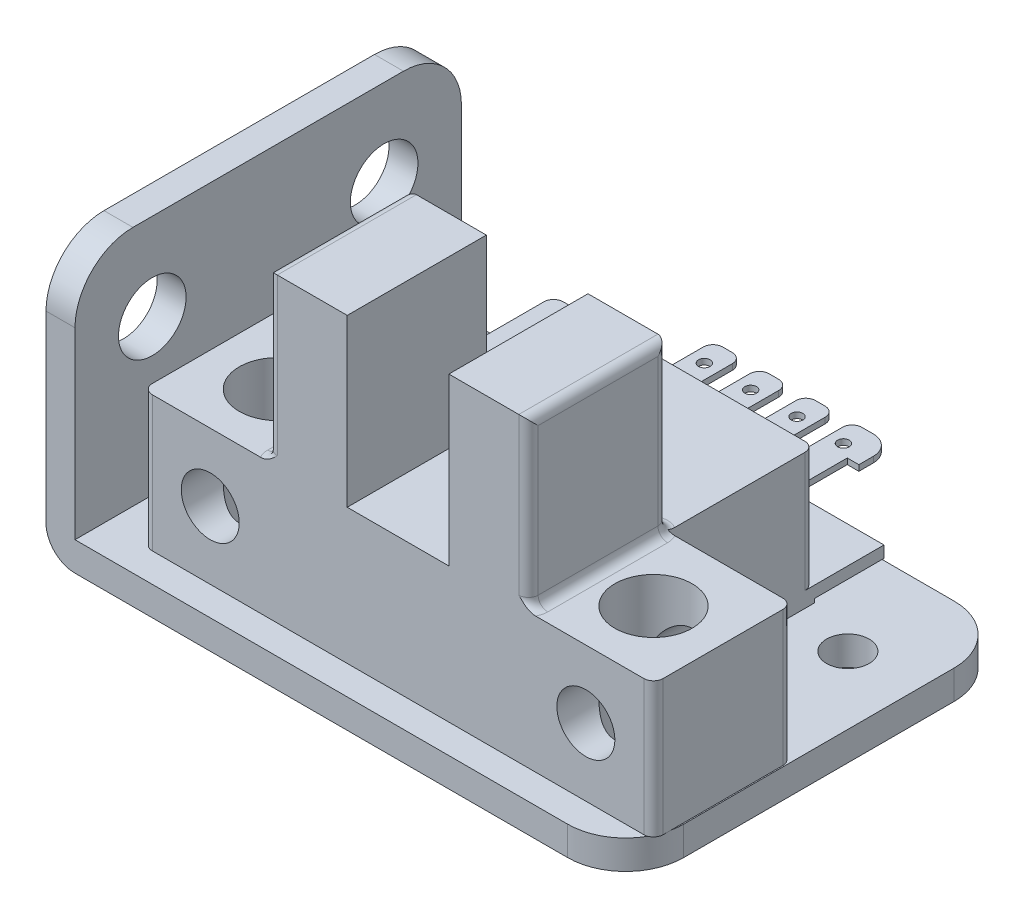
ISO-10303-21;
HEADER;
FILE_DESCRIPTION(('STEP AP214'),'2;1');
FILE_NAME('part.step','',(''),(''),'','','');
FILE_SCHEMA(('AUTOMOTIVE_DESIGN { 1 0 10303 214 1 1 1 1 }'));
ENDSEC;
DATA;
#1=APPLICATION_CONTEXT('core data for automotive mechanical design processes');
#2=APPLICATION_PROTOCOL_DEFINITION('international standard','automotive_design',2000,#1);
#3=PRODUCT_CONTEXT('',#1,'mechanical');
#4=PRODUCT('Part','Part','',(#3));
#5=PRODUCT_RELATED_PRODUCT_CATEGORY('part','',(#4));
#6=PRODUCT_DEFINITION_FORMATION('','',#4);
#7=PRODUCT_DEFINITION_CONTEXT('part definition',#1,'design');
#8=PRODUCT_DEFINITION('design','',#6,#7);
#9=PRODUCT_DEFINITION_SHAPE('','',#8);
#10=(LENGTH_UNIT() NAMED_UNIT(*) SI_UNIT(.MILLI.,.METRE.));
#11=(NAMED_UNIT(*) PLANE_ANGLE_UNIT() SI_UNIT($,.RADIAN.));
#12=(NAMED_UNIT(*) SI_UNIT($,.STERADIAN.) SOLID_ANGLE_UNIT());
#13=UNCERTAINTY_MEASURE_WITH_UNIT(LENGTH_MEASURE(1.E-05),#10,'distance_accuracy_value','');
#14=(GEOMETRIC_REPRESENTATION_CONTEXT(3) GLOBAL_UNCERTAINTY_ASSIGNED_CONTEXT((#13)) GLOBAL_UNIT_ASSIGNED_CONTEXT((#10,
#11,#12)) REPRESENTATION_CONTEXT('',''));
#15=CARTESIAN_POINT('',(0.,0.,0.));
#16=DIRECTION('',(0.,0.,1.));
#17=DIRECTION('',(1.,0.,0.));
#18=AXIS2_PLACEMENT_3D('',#15,#16,#17);
#19=CARTESIAN_POINT('',(48.7195177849,13.7,-69.0504822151));
#20=DIRECTION('',(0.,1.,0.));
#21=DIRECTION('',(0.,0.,-1.));
#22=AXIS2_PLACEMENT_3D('',#19,#20,#21);
#23=PLANE('',#22);
#24=CARTESIAN_POINT('',(47.82,13.7,-74.));
#25=DIRECTION('',(0.,1.,0.));
#26=DIRECTION('',(0.,0.,1.));
#27=AXIS2_PLACEMENT_3D('',#24,#25,#26);
#28=CIRCLE('',#27,0.299999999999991);
#29=CARTESIAN_POINT('',(47.82,13.7,-73.7));
#30=VERTEX_POINT('',#29);
#31=EDGE_CURVE('E523',#30,#30,#28,.T.);
#32=ORIENTED_EDGE('',*,*,#31,.T.);
#33=EDGE_LOOP('',(#32));
#34=FACE_BOUND('',#33,.T.);
#35=CARTESIAN_POINT('',(48.07,13.7,-74.7));
#36=DIRECTION('',(0.,1.,0.));
#37=DIRECTION('',(0.,0.,1.));
#38=AXIS2_PLACEMENT_3D('',#35,#36,#37);
#39=CIRCLE('',#38,0.500000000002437);
#40=CARTESIAN_POINT('',(48.07,13.7,-75.2000000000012));
#41=VERTEX_POINT('',#40);
#42=CARTESIAN_POINT('',(48.57,13.7,-74.7));
#43=VERTEX_POINT('',#42);
#44=EDGE_CURVE('E550',#41,#43,#39,.F.);
#45=ORIENTED_EDGE('',*,*,#44,.T.);
#46=DIRECTION('',(0.,0.,-1.));
#47=VECTOR('',#46,1.);
#48=CARTESIAN_POINT('',(48.57,13.7,-71.95));
#49=LINE('',#48,#47);
#50=CARTESIAN_POINT('',(48.57,13.7,-69.2));
#51=VERTEX_POINT('',#50);
#52=EDGE_CURVE('E533',#43,#51,#49,.F.);
#53=ORIENTED_EDGE('',*,*,#52,.T.);
#54=DIRECTION('',(1.,0.,0.));
#55=VECTOR('',#54,1.);
#56=CARTESIAN_POINT('',(47.82,13.7,-69.2));
#57=LINE('',#56,#55);
#58=CARTESIAN_POINT('',(47.07,13.7,-69.2));
#59=VERTEX_POINT('',#58);
#60=EDGE_CURVE('E521',#59,#51,#57,.T.);
#61=ORIENTED_EDGE('',*,*,#60,.F.);
#62=DIRECTION('',(0.,0.,-1.));
#63=VECTOR('',#62,1.);
#64=CARTESIAN_POINT('',(47.07,13.7,-71.95));
#65=LINE('',#64,#63);
#66=CARTESIAN_POINT('',(47.07,13.7,-74.7));
#67=VERTEX_POINT('',#66);
#68=EDGE_CURVE('E519',#59,#67,#65,.T.);
#69=ORIENTED_EDGE('',*,*,#68,.T.);
#70=CARTESIAN_POINT('',(47.57,13.7,-74.7));
#71=DIRECTION('',(0.,-1.,0.));
#72=DIRECTION('',(1.,0.,0.));
#73=AXIS2_PLACEMENT_3D('',#70,#71,#72);
#74=CIRCLE('',#73,0.500000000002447);
#75=CARTESIAN_POINT('',(47.57,13.7,-75.2));
#76=VERTEX_POINT('',#75);
#77=EDGE_CURVE('E22',#67,#76,#74,.T.);
#78=ORIENTED_EDGE('',*,*,#77,.T.);
#79=DIRECTION('',(1.,0.,0.));
#80=VECTOR('',#79,1.);
#81=CARTESIAN_POINT('',(47.82,13.7,-75.2));
#82=LINE('',#81,#80);
#83=EDGE_CURVE('E557',#76,#41,#82,.T.);
#84=ORIENTED_EDGE('',*,*,#83,.T.);
#85=EDGE_LOOP('',(#45,#53,#61,#69,#78,#84));
#86=FACE_BOUND('',#85,.T.);
#87=ADVANCED_FACE('F17',(#34,#86),#23,.F.);
#88=CARTESIAN_POINT('',(51.1195177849,13.7,-69.0504822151));
#89=DIRECTION('',(0.,1.,0.));
#90=DIRECTION('',(0.,0.,-1.));
#91=AXIS2_PLACEMENT_3D('',#88,#89,#90);
#92=PLANE('',#91);
#93=CARTESIAN_POINT('',(50.22,13.7,-74.));
#94=DIRECTION('',(0.,1.,0.));
#95=DIRECTION('',(0.,0.,1.));
#96=AXIS2_PLACEMENT_3D('',#93,#94,#95);
#97=CIRCLE('',#96,0.300000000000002);
#98=CARTESIAN_POINT('',(50.22,13.7,-73.7));
#99=VERTEX_POINT('',#98);
#100=EDGE_CURVE('E610',#99,#99,#97,.T.);
#101=ORIENTED_EDGE('',*,*,#100,.T.);
#102=EDGE_LOOP('',(#101));
#103=FACE_BOUND('',#102,.T.);
#104=CARTESIAN_POINT('',(50.47,13.7,-74.7));
#105=DIRECTION('',(0.,1.,0.));
#106=DIRECTION('',(0.,0.,1.));
#107=AXIS2_PLACEMENT_3D('',#104,#105,#106);
#108=CIRCLE('',#107,0.500000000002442);
#109=CARTESIAN_POINT('',(50.47,13.7,-75.2000000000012));
#110=VERTEX_POINT('',#109);
#111=CARTESIAN_POINT('',(50.97,13.7,-74.7));
#112=VERTEX_POINT('',#111);
#113=EDGE_CURVE('E1273',#110,#112,#108,.F.);
#114=ORIENTED_EDGE('',*,*,#113,.T.);
#115=DIRECTION('',(0.,0.,-1.));
#116=VECTOR('',#115,1.);
#117=CARTESIAN_POINT('',(50.97,13.7,-71.95));
#118=LINE('',#117,#116);
#119=CARTESIAN_POINT('',(50.97,13.7,-69.2));
#120=VERTEX_POINT('',#119);
#121=EDGE_CURVE('E617',#112,#120,#118,.F.);
#122=ORIENTED_EDGE('',*,*,#121,.T.);
#123=DIRECTION('',(1.,0.,0.));
#124=VECTOR('',#123,1.);
#125=CARTESIAN_POINT('',(50.22,13.7,-69.2));
#126=LINE('',#125,#124);
#127=CARTESIAN_POINT('',(49.47,13.7,-69.2));
#128=VERTEX_POINT('',#127);
#129=EDGE_CURVE('E597',#128,#120,#126,.T.);
#130=ORIENTED_EDGE('',*,*,#129,.F.);
#131=DIRECTION('',(0.,0.,-1.));
#132=VECTOR('',#131,1.);
#133=CARTESIAN_POINT('',(49.47,13.7,-71.95));
#134=LINE('',#133,#132);
#135=CARTESIAN_POINT('',(49.47,13.7,-74.7));
#136=VERTEX_POINT('',#135);
#137=EDGE_CURVE('E607',#128,#136,#134,.T.);
#138=ORIENTED_EDGE('',*,*,#137,.T.);
#139=CARTESIAN_POINT('',(49.97,13.7,-74.7));
#140=DIRECTION('',(0.,-1.,0.));
#141=DIRECTION('',(1.,0.,0.));
#142=AXIS2_PLACEMENT_3D('',#139,#140,#141);
#143=CIRCLE('',#142,0.500000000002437);
#144=CARTESIAN_POINT('',(49.97,13.7,-75.2));
#145=VERTEX_POINT('',#144);
#146=EDGE_CURVE('E1286',#136,#145,#143,.T.);
#147=ORIENTED_EDGE('',*,*,#146,.T.);
#148=DIRECTION('',(1.,0.,0.));
#149=VECTOR('',#148,1.);
#150=CARTESIAN_POINT('',(50.22,13.7,-75.2));
#151=LINE('',#150,#149);
#152=EDGE_CURVE('E624',#145,#110,#151,.T.);
#153=ORIENTED_EDGE('',*,*,#152,.T.);
#154=EDGE_LOOP('',(#114,#122,#130,#138,#147,#153));
#155=FACE_BOUND('',#154,.T.);
#156=ADVANCED_FACE('F1320',(#103,#155),#92,.F.);
#157=CARTESIAN_POINT('',(53.5195177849,13.7,-69.0504822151));
#158=DIRECTION('',(0.,1.,0.));
#159=DIRECTION('',(0.,0.,-1.));
#160=AXIS2_PLACEMENT_3D('',#157,#158,#159);
#161=PLANE('',#160);
#162=CARTESIAN_POINT('',(52.62,13.7,-74.));
#163=DIRECTION('',(0.,1.,0.));
#164=DIRECTION('',(0.,0.,1.));
#165=AXIS2_PLACEMENT_3D('',#162,#163,#164);
#166=CIRCLE('',#165,0.300000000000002);
#167=CARTESIAN_POINT('',(52.62,13.7,-73.7));
#168=VERTEX_POINT('',#167);
#169=EDGE_CURVE('E588',#168,#168,#166,.T.);
#170=ORIENTED_EDGE('',*,*,#169,.T.);
#171=EDGE_LOOP('',(#170));
#172=FACE_BOUND('',#171,.T.);
#173=DIRECTION('',(1.,0.,0.));
#174=VECTOR('',#173,1.);
#175=CARTESIAN_POINT('',(52.62,13.7,-69.2));
#176=LINE('',#175,#174);
#177=CARTESIAN_POINT('',(51.87,13.7,-69.2));
#178=VERTEX_POINT('',#177);
#179=CARTESIAN_POINT('',(53.37,13.7,-69.2));
#180=VERTEX_POINT('',#179);
#181=EDGE_CURVE('E571',#178,#180,#176,.T.);
#182=ORIENTED_EDGE('',*,*,#181,.F.);
#183=DIRECTION('',(0.,0.,-1.));
#184=VECTOR('',#183,1.);
#185=CARTESIAN_POINT('',(51.87,13.7,-71.95));
#186=LINE('',#185,#184);
#187=CARTESIAN_POINT('',(51.8699999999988,13.7,-74.7));
#188=VERTEX_POINT('',#187);
#189=EDGE_CURVE('E590',#178,#188,#186,.T.);
#190=ORIENTED_EDGE('',*,*,#189,.T.);
#191=CARTESIAN_POINT('',(52.37,13.7,-74.7));
#192=DIRECTION('',(0.,-1.,0.));
#193=DIRECTION('',(1.,0.,0.));
#194=AXIS2_PLACEMENT_3D('',#191,#192,#193);
#195=CIRCLE('',#194,0.500000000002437);
#196=CARTESIAN_POINT('',(52.37,13.7,-75.2));
#197=VERTEX_POINT('',#196);
#198=EDGE_CURVE('E592',#188,#197,#195,.T.);
#199=ORIENTED_EDGE('',*,*,#198,.T.);
#200=DIRECTION('',(1.,0.,0.));
#201=VECTOR('',#200,1.);
#202=CARTESIAN_POINT('',(52.62,13.7,-75.2));
#203=LINE('',#202,#201);
#204=CARTESIAN_POINT('',(52.87,13.7,-75.2));
#205=VERTEX_POINT('',#204);
#206=EDGE_CURVE('E585',#197,#205,#203,.T.);
#207=ORIENTED_EDGE('',*,*,#206,.T.);
#208=CARTESIAN_POINT('',(52.87,13.7,-74.7));
#209=DIRECTION('',(0.,1.,0.));
#210=DIRECTION('',(0.,0.,1.));
#211=AXIS2_PLACEMENT_3D('',#208,#209,#210);
#212=CIRCLE('',#211,0.500000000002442);
#213=CARTESIAN_POINT('',(53.37,13.7,-74.7));
#214=VERTEX_POINT('',#213);
#215=EDGE_CURVE('E1258',#205,#214,#212,.F.);
#216=ORIENTED_EDGE('',*,*,#215,.T.);
#217=DIRECTION('',(0.,0.,-1.));
#218=VECTOR('',#217,1.);
#219=CARTESIAN_POINT('',(53.37,13.7,-71.95));
#220=LINE('',#219,#218);
#221=EDGE_CURVE('E600',#214,#180,#220,.F.);
#222=ORIENTED_EDGE('',*,*,#221,.T.);
#223=EDGE_LOOP('',(#182,#190,#199,#207,#216,#222));
#224=FACE_BOUND('',#223,.T.);
#225=ADVANCED_FACE('F2843',(#172,#224),#161,.F.);
#226=CARTESIAN_POINT('',(56.51951778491,13.7,-69.0504822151));
#227=DIRECTION('',(0.,1.,0.));
#228=DIRECTION('',(0.,0.,-1.));
#229=AXIS2_PLACEMENT_3D('',#226,#227,#228);
#230=PLANE('',#229);
#231=CARTESIAN_POINT('',(55.02,13.7,-74.));
#232=DIRECTION('',(0.,1.,0.));
#233=DIRECTION('',(0.,0.,1.));
#234=AXIS2_PLACEMENT_3D('',#231,#232,#233);
#235=CIRCLE('',#234,0.300000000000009);
#236=CARTESIAN_POINT('',(55.02,13.7,-73.7));
#237=VERTEX_POINT('',#236);
#238=EDGE_CURVE('E562',#237,#237,#235,.T.);
#239=ORIENTED_EDGE('',*,*,#238,.T.);
#240=EDGE_LOOP('',(#239));
#241=FACE_BOUND('',#240,.T.);
#242=DIRECTION('',(1.,0.,0.));
#243=VECTOR('',#242,1.);
#244=CARTESIAN_POINT('',(56.07,13.7,-73.449));
#245=LINE('',#244,#243);
#246=CARTESIAN_POINT('',(56.37,13.7,-73.449));
#247=VERTEX_POINT('',#246);
#248=CARTESIAN_POINT('',(55.77,13.7,-73.449));
#249=VERTEX_POINT('',#248);
#250=EDGE_CURVE('E580',#247,#249,#245,.F.);
#251=ORIENTED_EDGE('',*,*,#250,.T.);
#252=DIRECTION('',(0.,0.,-1.));
#253=VECTOR('',#252,1.);
#254=CARTESIAN_POINT('',(55.77,13.7,-71.3245));
#255=LINE('',#254,#253);
#256=CARTESIAN_POINT('',(55.77,13.7,-69.2));
#257=VERTEX_POINT('',#256);
#258=EDGE_CURVE('E636',#249,#257,#255,.F.);
#259=ORIENTED_EDGE('',*,*,#258,.T.);
#260=DIRECTION('',(1.,0.,0.));
#261=VECTOR('',#260,1.);
#262=CARTESIAN_POINT('',(55.320000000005,13.7,-69.2));
#263=LINE('',#262,#261);
#264=CARTESIAN_POINT('',(54.27,13.7,-69.2));
#265=VERTEX_POINT('',#264);
#266=EDGE_CURVE('E516',#265,#257,#263,.T.);
#267=ORIENTED_EDGE('',*,*,#266,.F.);
#268=DIRECTION('',(0.,0.,-1.));
#269=VECTOR('',#268,1.);
#270=CARTESIAN_POINT('',(54.27,13.7,-71.95));
#271=LINE('',#270,#269);
#272=CARTESIAN_POINT('',(54.2699999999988,13.7,-74.7));
#273=VERTEX_POINT('',#272);
#274=EDGE_CURVE('E564',#265,#273,#271,.T.);
#275=ORIENTED_EDGE('',*,*,#274,.T.);
#276=CARTESIAN_POINT('',(54.77,13.7,-74.7));
#277=DIRECTION('',(0.,-1.,0.));
#278=DIRECTION('',(1.,0.,0.));
#279=AXIS2_PLACEMENT_3D('',#276,#277,#278);
#280=CIRCLE('',#279,0.50000000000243);
#281=CARTESIAN_POINT('',(54.77,13.7,-75.2));
#282=VERTEX_POINT('',#281);
#283=EDGE_CURVE('E566',#273,#282,#280,.T.);
#284=ORIENTED_EDGE('',*,*,#283,.T.);
#285=DIRECTION('',(1.,0.,0.));
#286=VECTOR('',#285,1.);
#287=CARTESIAN_POINT('',(55.07,13.7,-75.2));
#288=LINE('',#287,#286);
#289=CARTESIAN_POINT('',(55.37,13.7,-75.2));
#290=VERTEX_POINT('',#289);
#291=EDGE_CURVE('E559',#282,#290,#288,.T.);
#292=ORIENTED_EDGE('',*,*,#291,.T.);
#293=CARTESIAN_POINT('',(55.37,13.7,-74.2));
#294=DIRECTION('',(0.,-1.,0.));
#295=DIRECTION('',(1.,0.,0.));
#296=AXIS2_PLACEMENT_3D('',#293,#294,#295);
#297=CIRCLE('',#296,1.00000000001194);
#298=CARTESIAN_POINT('',(56.37,13.7,-74.2));
#299=VERTEX_POINT('',#298);
#300=EDGE_CURVE('E1234',#290,#299,#297,.T.);
#301=ORIENTED_EDGE('',*,*,#300,.T.);
#302=DIRECTION('',(0.,0.,-1.));
#303=VECTOR('',#302,1.);
#304=CARTESIAN_POINT('',(56.37,13.7,-73.8245));
#305=LINE('',#304,#303);
#306=EDGE_CURVE('E574',#299,#247,#305,.F.);
#307=ORIENTED_EDGE('',*,*,#306,.T.);
#308=EDGE_LOOP('',(#251,#259,#267,#275,#284,#292,#301,#307));
#309=FACE_BOUND('',#308,.T.);
#310=ADVANCED_FACE('F2833',(#241,#309),#230,.F.);
#311=CARTESIAN_POINT('',(47.57,14.,-74.7));
#312=DIRECTION('',(0.,-1.,0.));
#313=DIRECTION('',(1.,0.,0.));
#314=AXIS2_PLACEMENT_3D('',#311,#312,#313);
#315=CYLINDRICAL_SURFACE('',#314,0.500000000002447);
#316=CARTESIAN_POINT('',(47.57,14.,-74.7));
#317=DIRECTION('',(0.,-1.,0.));
#318=DIRECTION('',(1.,0.,0.));
#319=AXIS2_PLACEMENT_3D('',#316,#317,#318);
#320=CIRCLE('',#319,0.500000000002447);
#321=CARTESIAN_POINT('',(47.07,14.,-74.7));
#322=VERTEX_POINT('',#321);
#323=CARTESIAN_POINT('',(47.57,14.,-75.2));
#324=VERTEX_POINT('',#323);
#325=EDGE_CURVE('E1202',#322,#324,#320,.T.);
#326=ORIENTED_EDGE('',*,*,#325,.T.);
#327=DIRECTION('',(0.,-1.,0.));
#328=VECTOR('',#327,1.);
#329=CARTESIAN_POINT('',(47.57,13.85,-75.2));
#330=LINE('',#329,#328);
#331=EDGE_CURVE('E513',#324,#76,#330,.T.);
#332=ORIENTED_EDGE('',*,*,#331,.T.);
#333=ORIENTED_EDGE('',*,*,#77,.F.);
#334=DIRECTION('',(0.,1.,0.));
#335=VECTOR('',#334,1.);
#336=CARTESIAN_POINT('',(47.07,13.85,-74.7));
#337=LINE('',#336,#335);
#338=EDGE_CURVE('E510',#67,#322,#337,.T.);
#339=ORIENTED_EDGE('',*,*,#338,.T.);
#340=EDGE_LOOP('',(#326,#332,#333,#339));
#341=FACE_BOUND('',#340,.T.);
#342=ADVANCED_FACE('F508',(#341),#315,.T.);
#343=CARTESIAN_POINT('',(47.4204822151,13.5504822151,-75.2));
#344=DIRECTION('',(0.,0.,1.));
#345=DIRECTION('',(1.,0.,0.));
#346=AXIS2_PLACEMENT_3D('',#343,#344,#345);
#347=PLANE('',#346);
#348=DIRECTION('',(0.,-1.,0.));
#349=VECTOR('',#348,1.);
#350=CARTESIAN_POINT('',(48.07,13.85,-75.2000000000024));
#351=LINE('',#350,#349);
#352=CARTESIAN_POINT('',(48.07,14.,-75.2000000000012));
#353=VERTEX_POINT('',#352);
#354=EDGE_CURVE('E554',#353,#41,#351,.T.);
#355=ORIENTED_EDGE('',*,*,#354,.T.);
#356=ORIENTED_EDGE('',*,*,#83,.F.);
#357=ORIENTED_EDGE('',*,*,#331,.F.);
#358=DIRECTION('',(-1.,0.,0.));
#359=VECTOR('',#358,1.);
#360=CARTESIAN_POINT('',(47.82,14.,-75.2));
#361=LINE('',#360,#359);
#362=EDGE_CURVE('E1200',#324,#353,#361,.F.);
#363=ORIENTED_EDGE('',*,*,#362,.T.);
#364=EDGE_LOOP('',(#355,#356,#357,#363));
#365=FACE_BOUND('',#364,.T.);
#366=ADVANCED_FACE('F2813',(#365),#347,.F.);
#367=CARTESIAN_POINT('',(48.07,13.7,-74.7));
#368=DIRECTION('',(0.,1.,0.));
#369=DIRECTION('',(0.,0.,1.));
#370=AXIS2_PLACEMENT_3D('',#367,#368,#369);
#371=CYLINDRICAL_SURFACE('',#370,0.500000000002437);
#372=ORIENTED_EDGE('',*,*,#44,.F.);
#373=ORIENTED_EDGE('',*,*,#354,.F.);
#374=CARTESIAN_POINT('',(48.07,14.,-74.7));
#375=DIRECTION('',(0.,1.,0.));
#376=DIRECTION('',(0.,0.,1.));
#377=AXIS2_PLACEMENT_3D('',#374,#375,#376);
#378=CIRCLE('',#377,0.500000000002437);
#379=CARTESIAN_POINT('',(48.57,14.,-74.7));
#380=VERTEX_POINT('',#379);
#381=EDGE_CURVE('E1197',#353,#380,#378,.F.);
#382=ORIENTED_EDGE('',*,*,#381,.T.);
#383=DIRECTION('',(0.,1.,0.));
#384=VECTOR('',#383,1.);
#385=CARTESIAN_POINT('',(48.57,13.85,-74.7));
#386=LINE('',#385,#384);
#387=EDGE_CURVE('E548',#380,#43,#386,.F.);
#388=ORIENTED_EDGE('',*,*,#387,.T.);
#389=EDGE_LOOP('',(#372,#373,#382,#388));
#390=FACE_BOUND('',#389,.T.);
#391=ADVANCED_FACE('F1295',(#390),#371,.T.);
#392=CARTESIAN_POINT('',(48.57,14.1495177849,-74.8495177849));
#393=DIRECTION('',(1.,0.,0.));
#394=DIRECTION('',(0.,0.,1.));
#395=AXIS2_PLACEMENT_3D('',#392,#393,#394);
#396=PLANE('',#395);
#397=DIRECTION('',(0.,-1.,0.));
#398=VECTOR('',#397,1.);
#399=CARTESIAN_POINT('',(48.57,13.85,-69.2));
#400=LINE('',#399,#398);
#401=CARTESIAN_POINT('',(48.57,14.,-69.2));
#402=VERTEX_POINT('',#401);
#403=EDGE_CURVE('E530',#51,#402,#400,.F.);
#404=ORIENTED_EDGE('',*,*,#403,.F.);
#405=ORIENTED_EDGE('',*,*,#52,.F.);
#406=ORIENTED_EDGE('',*,*,#387,.F.);
#407=DIRECTION('',(0.,0.,-1.));
#408=VECTOR('',#407,1.);
#409=CARTESIAN_POINT('',(48.57,14.,-72.2));
#410=LINE('',#409,#408);
#411=EDGE_CURVE('E1192',#380,#402,#410,.F.);
#412=ORIENTED_EDGE('',*,*,#411,.T.);
#413=EDGE_LOOP('',(#404,#405,#406,#412));
#414=FACE_BOUND('',#413,.T.);
#415=ADVANCED_FACE('F1299',(#414),#396,.T.);
#416=CARTESIAN_POINT('',(47.07,13.5504822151,-69.0504822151));
#417=DIRECTION('',(1.,0.,0.));
#418=DIRECTION('',(0.,0.,-1.));
#419=AXIS2_PLACEMENT_3D('',#416,#417,#418);
#420=PLANE('',#419);
#421=DIRECTION('',(0.,-1.,0.));
#422=VECTOR('',#421,1.);
#423=CARTESIAN_POINT('',(47.07,13.85,-69.2));
#424=LINE('',#423,#422);
#425=CARTESIAN_POINT('',(47.07,14.,-69.2));
#426=VERTEX_POINT('',#425);
#427=EDGE_CURVE('E524',#426,#59,#424,.T.);
#428=ORIENTED_EDGE('',*,*,#427,.F.);
#429=DIRECTION('',(0.,0.,1.));
#430=VECTOR('',#429,1.);
#431=CARTESIAN_POINT('',(47.07,14.,-72.2));
#432=LINE('',#431,#430);
#433=EDGE_CURVE('E528',#426,#322,#432,.F.);
#434=ORIENTED_EDGE('',*,*,#433,.T.);
#435=ORIENTED_EDGE('',*,*,#338,.F.);
#436=ORIENTED_EDGE('',*,*,#68,.F.);
#437=EDGE_LOOP('',(#428,#434,#435,#436));
#438=FACE_BOUND('',#437,.T.);
#439=ADVANCED_FACE('F526',(#438),#420,.F.);
#440=CARTESIAN_POINT('',(47.82,13.7,-74.));
#441=DIRECTION('',(0.,1.,0.));
#442=DIRECTION('',(0.,0.,1.));
#443=AXIS2_PLACEMENT_3D('',#440,#441,#442);
#444=CYLINDRICAL_SURFACE('',#443,0.299999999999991);
#445=CARTESIAN_POINT('',(47.82,14.,-74.));
#446=DIRECTION('',(0.,1.,0.));
#447=DIRECTION('',(0.,0.,1.));
#448=AXIS2_PLACEMENT_3D('',#445,#446,#447);
#449=CIRCLE('',#448,0.299999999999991);
#450=CARTESIAN_POINT('',(47.82,14.,-73.7));
#451=VERTEX_POINT('',#450);
#452=EDGE_CURVE('E1191',#451,#451,#449,.T.);
#453=ORIENTED_EDGE('',*,*,#452,.T.);
#454=EDGE_LOOP('',(#453));
#455=FACE_BOUND('',#454,.T.);
#456=ORIENTED_EDGE('',*,*,#31,.F.);
#457=EDGE_LOOP('',(#456));
#458=FACE_BOUND('',#457,.T.);
#459=ADVANCED_FACE('F1694',(#455,#458),#444,.F.);
#460=CARTESIAN_POINT('',(49.97,14.,-74.7));
#461=DIRECTION('',(0.,-1.,0.));
#462=DIRECTION('',(1.,0.,0.));
#463=AXIS2_PLACEMENT_3D('',#460,#461,#462);
#464=CYLINDRICAL_SURFACE('',#463,0.500000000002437);
#465=CARTESIAN_POINT('',(49.97,14.,-74.7));
#466=DIRECTION('',(0.,-1.,0.));
#467=DIRECTION('',(1.,0.,0.));
#468=AXIS2_PLACEMENT_3D('',#465,#466,#467);
#469=CIRCLE('',#468,0.500000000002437);
#470=CARTESIAN_POINT('',(49.47,14.,-74.7));
#471=VERTEX_POINT('',#470);
#472=CARTESIAN_POINT('',(49.97,14.,-75.2));
#473=VERTEX_POINT('',#472);
#474=EDGE_CURVE('E1189',#471,#473,#469,.T.);
#475=ORIENTED_EDGE('',*,*,#474,.T.);
#476=DIRECTION('',(0.,-1.,0.));
#477=VECTOR('',#476,1.);
#478=CARTESIAN_POINT('',(49.97,13.85,-75.2));
#479=LINE('',#478,#477);
#480=EDGE_CURVE('E536',#473,#145,#479,.T.);
#481=ORIENTED_EDGE('',*,*,#480,.T.);
#482=ORIENTED_EDGE('',*,*,#146,.F.);
#483=DIRECTION('',(0.,1.,0.));
#484=VECTOR('',#483,1.);
#485=CARTESIAN_POINT('',(49.47,13.85,-74.7));
#486=LINE('',#485,#484);
#487=EDGE_CURVE('E1262',#136,#471,#486,.T.);
#488=ORIENTED_EDGE('',*,*,#487,.T.);
#489=EDGE_LOOP('',(#475,#481,#482,#488));
#490=FACE_BOUND('',#489,.T.);
#491=ADVANCED_FACE('F2766',(#490),#464,.T.);
#492=CARTESIAN_POINT('',(49.8204822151,13.5504822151,-75.2));
#493=DIRECTION('',(0.,0.,1.));
#494=DIRECTION('',(1.,0.,0.));
#495=AXIS2_PLACEMENT_3D('',#492,#493,#494);
#496=PLANE('',#495);
#497=DIRECTION('',(0.,-1.,0.));
#498=VECTOR('',#497,1.);
#499=CARTESIAN_POINT('',(50.47,13.85,-75.2000000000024));
#500=LINE('',#499,#498);
#501=CARTESIAN_POINT('',(50.47,14.,-75.2000000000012));
#502=VERTEX_POINT('',#501);
#503=EDGE_CURVE('E625',#502,#110,#500,.T.);
#504=ORIENTED_EDGE('',*,*,#503,.T.);
#505=ORIENTED_EDGE('',*,*,#152,.F.);
#506=ORIENTED_EDGE('',*,*,#480,.F.);
#507=DIRECTION('',(-1.,0.,0.));
#508=VECTOR('',#507,1.);
#509=CARTESIAN_POINT('',(50.22,14.,-75.2));
#510=LINE('',#509,#508);
#511=EDGE_CURVE('E1187',#473,#502,#510,.F.);
#512=ORIENTED_EDGE('',*,*,#511,.T.);
#513=EDGE_LOOP('',(#504,#505,#506,#512));
#514=FACE_BOUND('',#513,.T.);
#515=ADVANCED_FACE('F2756',(#514),#496,.F.);
#516=CARTESIAN_POINT('',(50.47,13.7,-74.7));
#517=DIRECTION('',(0.,1.,0.));
#518=DIRECTION('',(0.,0.,1.));
#519=AXIS2_PLACEMENT_3D('',#516,#517,#518);
#520=CYLINDRICAL_SURFACE('',#519,0.500000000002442);
#521=ORIENTED_EDGE('',*,*,#113,.F.);
#522=ORIENTED_EDGE('',*,*,#503,.F.);
#523=CARTESIAN_POINT('',(50.47,14.,-74.7));
#524=DIRECTION('',(0.,1.,0.));
#525=DIRECTION('',(0.,0.,1.));
#526=AXIS2_PLACEMENT_3D('',#523,#524,#525);
#527=CIRCLE('',#526,0.500000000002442);
#528=CARTESIAN_POINT('',(50.97,14.,-74.7));
#529=VERTEX_POINT('',#528);
#530=EDGE_CURVE('E1184',#502,#529,#527,.F.);
#531=ORIENTED_EDGE('',*,*,#530,.T.);
#532=DIRECTION('',(0.,1.,0.));
#533=VECTOR('',#532,1.);
#534=CARTESIAN_POINT('',(50.97,13.85,-74.7));
#535=LINE('',#534,#533);
#536=EDGE_CURVE('E621',#529,#112,#535,.F.);
#537=ORIENTED_EDGE('',*,*,#536,.T.);
#538=EDGE_LOOP('',(#521,#522,#531,#537));
#539=FACE_BOUND('',#538,.T.);
#540=ADVANCED_FACE('F2745',(#539),#520,.T.);
#541=CARTESIAN_POINT('',(50.97,14.1495177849,-74.8495177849));
#542=DIRECTION('',(1.,0.,0.));
#543=DIRECTION('',(0.,0.,1.));
#544=AXIS2_PLACEMENT_3D('',#541,#542,#543);
#545=PLANE('',#544);
#546=DIRECTION('',(0.,-1.,0.));
#547=VECTOR('',#546,1.);
#548=CARTESIAN_POINT('',(50.97,13.85,-69.2));
#549=LINE('',#548,#547);
#550=CARTESIAN_POINT('',(50.97,14.,-69.2));
#551=VERTEX_POINT('',#550);
#552=EDGE_CURVE('E620',#120,#551,#549,.F.);
#553=ORIENTED_EDGE('',*,*,#552,.F.);
#554=ORIENTED_EDGE('',*,*,#121,.F.);
#555=ORIENTED_EDGE('',*,*,#536,.F.);
#556=DIRECTION('',(0.,0.,-1.));
#557=VECTOR('',#556,1.);
#558=CARTESIAN_POINT('',(50.97,14.,-72.2));
#559=LINE('',#558,#557);
#560=EDGE_CURVE('E1179',#529,#551,#559,.F.);
#561=ORIENTED_EDGE('',*,*,#560,.T.);
#562=EDGE_LOOP('',(#553,#554,#555,#561));
#563=FACE_BOUND('',#562,.T.);
#564=ADVANCED_FACE('F1336',(#563),#545,.T.);
#565=CARTESIAN_POINT('',(49.47,13.5504822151,-69.0504822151));
#566=DIRECTION('',(1.,0.,0.));
#567=DIRECTION('',(0.,0.,-1.));
#568=AXIS2_PLACEMENT_3D('',#565,#566,#567);
#569=PLANE('',#568);
#570=DIRECTION('',(0.,-1.,0.));
#571=VECTOR('',#570,1.);
#572=CARTESIAN_POINT('',(49.47,13.85,-69.2));
#573=LINE('',#572,#571);
#574=CARTESIAN_POINT('',(49.47,14.,-69.2));
#575=VERTEX_POINT('',#574);
#576=EDGE_CURVE('E611',#575,#128,#573,.T.);
#577=ORIENTED_EDGE('',*,*,#576,.F.);
#578=DIRECTION('',(0.,0.,1.));
#579=VECTOR('',#578,1.);
#580=CARTESIAN_POINT('',(49.47,14.,-72.2));
#581=LINE('',#580,#579);
#582=EDGE_CURVE('E1175',#575,#471,#581,.F.);
#583=ORIENTED_EDGE('',*,*,#582,.T.);
#584=ORIENTED_EDGE('',*,*,#487,.F.);
#585=ORIENTED_EDGE('',*,*,#137,.F.);
#586=EDGE_LOOP('',(#577,#583,#584,#585));
#587=FACE_BOUND('',#586,.T.);
#588=ADVANCED_FACE('F1325',(#587),#569,.F.);
#589=CARTESIAN_POINT('',(50.22,13.7,-74.));
#590=DIRECTION('',(0.,1.,0.));
#591=DIRECTION('',(0.,0.,1.));
#592=AXIS2_PLACEMENT_3D('',#589,#590,#591);
#593=CYLINDRICAL_SURFACE('',#592,0.300000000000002);
#594=CARTESIAN_POINT('',(50.22,14.,-74.));
#595=DIRECTION('',(0.,1.,0.));
#596=DIRECTION('',(0.,0.,1.));
#597=AXIS2_PLACEMENT_3D('',#594,#595,#596);
#598=CIRCLE('',#597,0.300000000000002);
#599=CARTESIAN_POINT('',(50.22,14.,-73.7));
#600=VERTEX_POINT('',#599);
#601=EDGE_CURVE('E1178',#600,#600,#598,.T.);
#602=ORIENTED_EDGE('',*,*,#601,.T.);
#603=EDGE_LOOP('',(#602));
#604=FACE_BOUND('',#603,.T.);
#605=ORIENTED_EDGE('',*,*,#100,.F.);
#606=EDGE_LOOP('',(#605));
#607=FACE_BOUND('',#606,.T.);
#608=ADVANCED_FACE('F1322',(#604,#607),#593,.F.);
#609=CARTESIAN_POINT('',(52.87,13.7,-74.7));
#610=DIRECTION('',(0.,1.,0.));
#611=DIRECTION('',(0.,0.,1.));
#612=AXIS2_PLACEMENT_3D('',#609,#610,#611);
#613=CYLINDRICAL_SURFACE('',#612,0.500000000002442);
#614=ORIENTED_EDGE('',*,*,#215,.F.);
#615=DIRECTION('',(0.,1.,0.));
#616=VECTOR('',#615,1.);
#617=CARTESIAN_POINT('',(52.87,13.85,-75.2));
#618=LINE('',#617,#616);
#619=CARTESIAN_POINT('',(52.87,14.,-75.2));
#620=VERTEX_POINT('',#619);
#621=EDGE_CURVE('E1244',#205,#620,#618,.T.);
#622=ORIENTED_EDGE('',*,*,#621,.T.);
#623=CARTESIAN_POINT('',(52.87,14.,-74.7));
#624=DIRECTION('',(0.,1.,0.));
#625=DIRECTION('',(0.,0.,1.));
#626=AXIS2_PLACEMENT_3D('',#623,#624,#625);
#627=CIRCLE('',#626,0.500000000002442);
#628=CARTESIAN_POINT('',(53.37,14.,-74.7));
#629=VERTEX_POINT('',#628);
#630=EDGE_CURVE('E1172',#620,#629,#627,.F.);
#631=ORIENTED_EDGE('',*,*,#630,.T.);
#632=DIRECTION('',(0.,1.,0.));
#633=VECTOR('',#632,1.);
#634=CARTESIAN_POINT('',(53.37,13.85,-74.7));
#635=LINE('',#634,#633);
#636=EDGE_CURVE('E604',#629,#214,#635,.F.);
#637=ORIENTED_EDGE('',*,*,#636,.T.);
#638=EDGE_LOOP('',(#614,#622,#631,#637));
#639=FACE_BOUND('',#638,.T.);
#640=ADVANCED_FACE('F1324',(#639),#613,.T.);
#641=CARTESIAN_POINT('',(53.37,14.1495177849,-74.8495177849));
#642=DIRECTION('',(1.,0.,0.));
#643=DIRECTION('',(0.,0.,1.));
#644=AXIS2_PLACEMENT_3D('',#641,#642,#643);
#645=PLANE('',#644);
#646=DIRECTION('',(0.,-1.,0.));
#647=VECTOR('',#646,1.);
#648=CARTESIAN_POINT('',(53.37,13.85,-69.2));
#649=LINE('',#648,#647);
#650=CARTESIAN_POINT('',(53.37,14.,-69.2));
#651=VERTEX_POINT('',#650);
#652=EDGE_CURVE('E603',#180,#651,#649,.F.);
#653=ORIENTED_EDGE('',*,*,#652,.F.);
#654=ORIENTED_EDGE('',*,*,#221,.F.);
#655=ORIENTED_EDGE('',*,*,#636,.F.);
#656=DIRECTION('',(0.,0.,-1.));
#657=VECTOR('',#656,1.);
#658=CARTESIAN_POINT('',(53.37,14.,-72.2));
#659=LINE('',#658,#657);
#660=EDGE_CURVE('E1167',#629,#651,#659,.F.);
#661=ORIENTED_EDGE('',*,*,#660,.T.);
#662=EDGE_LOOP('',(#653,#654,#655,#661));
#663=FACE_BOUND('',#662,.T.);
#664=ADVANCED_FACE('F1333',(#663),#645,.T.);
#665=CARTESIAN_POINT('',(51.87,13.5504822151,-69.0504822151));
#666=DIRECTION('',(1.,0.,0.));
#667=DIRECTION('',(0.,0.,-1.));
#668=AXIS2_PLACEMENT_3D('',#665,#666,#667);
#669=PLANE('',#668);
#670=DIRECTION('',(0.,-1.,0.));
#671=VECTOR('',#670,1.);
#672=CARTESIAN_POINT('',(51.87,13.85,-69.2));
#673=LINE('',#672,#671);
#674=CARTESIAN_POINT('',(51.87,14.,-69.2));
#675=VERTEX_POINT('',#674);
#676=EDGE_CURVE('E593',#675,#178,#673,.T.);
#677=ORIENTED_EDGE('',*,*,#676,.F.);
#678=DIRECTION('',(0.,0.,1.));
#679=VECTOR('',#678,1.);
#680=CARTESIAN_POINT('',(51.87,14.,-72.2));
#681=LINE('',#680,#679);
#682=CARTESIAN_POINT('',(51.8699999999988,14.,-74.7));
#683=VERTEX_POINT('',#682);
#684=EDGE_CURVE('E1165',#675,#683,#681,.F.);
#685=ORIENTED_EDGE('',*,*,#684,.T.);
#686=DIRECTION('',(0.,-1.,0.));
#687=VECTOR('',#686,1.);
#688=CARTESIAN_POINT('',(51.8699999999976,13.85,-74.7));
#689=LINE('',#688,#687);
#690=EDGE_CURVE('E1246',#683,#188,#689,.T.);
#691=ORIENTED_EDGE('',*,*,#690,.T.);
#692=ORIENTED_EDGE('',*,*,#189,.F.);
#693=EDGE_LOOP('',(#677,#685,#691,#692));
#694=FACE_BOUND('',#693,.T.);
#695=ADVANCED_FACE('F1662',(#694),#669,.F.);
#696=CARTESIAN_POINT('',(52.37,14.,-74.7));
#697=DIRECTION('',(0.,-1.,0.));
#698=DIRECTION('',(1.,0.,0.));
#699=AXIS2_PLACEMENT_3D('',#696,#697,#698);
#700=CYLINDRICAL_SURFACE('',#699,0.500000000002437);
#701=CARTESIAN_POINT('',(52.37,14.,-74.7));
#702=DIRECTION('',(0.,-1.,0.));
#703=DIRECTION('',(1.,0.,0.));
#704=AXIS2_PLACEMENT_3D('',#701,#702,#703);
#705=CIRCLE('',#704,0.500000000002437);
#706=CARTESIAN_POINT('',(52.37,14.,-75.2));
#707=VERTEX_POINT('',#706);
#708=EDGE_CURVE('E1164',#683,#707,#705,.T.);
#709=ORIENTED_EDGE('',*,*,#708,.T.);
#710=DIRECTION('',(0.,-1.,0.));
#711=VECTOR('',#710,1.);
#712=CARTESIAN_POINT('',(52.37,13.85,-75.2));
#713=LINE('',#712,#711);
#714=EDGE_CURVE('E589',#707,#197,#713,.T.);
#715=ORIENTED_EDGE('',*,*,#714,.T.);
#716=ORIENTED_EDGE('',*,*,#198,.F.);
#717=ORIENTED_EDGE('',*,*,#690,.F.);
#718=EDGE_LOOP('',(#709,#715,#716,#717));
#719=FACE_BOUND('',#718,.T.);
#720=ADVANCED_FACE('F1660',(#719),#700,.T.);
#721=CARTESIAN_POINT('',(52.2204822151,13.5504822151,-75.2));
#722=DIRECTION('',(0.,0.,1.));
#723=DIRECTION('',(1.,0.,0.));
#724=AXIS2_PLACEMENT_3D('',#721,#722,#723);
#725=PLANE('',#724);
#726=ORIENTED_EDGE('',*,*,#714,.F.);
#727=DIRECTION('',(-1.,0.,0.));
#728=VECTOR('',#727,1.);
#729=CARTESIAN_POINT('',(52.62,14.,-75.2));
#730=LINE('',#729,#728);
#731=EDGE_CURVE('E1160',#707,#620,#730,.F.);
#732=ORIENTED_EDGE('',*,*,#731,.T.);
#733=ORIENTED_EDGE('',*,*,#621,.F.);
#734=ORIENTED_EDGE('',*,*,#206,.F.);
#735=EDGE_LOOP('',(#726,#732,#733,#734));
#736=FACE_BOUND('',#735,.T.);
#737=ADVANCED_FACE('F1658',(#736),#725,.F.);
#738=CARTESIAN_POINT('',(52.62,13.7,-74.));
#739=DIRECTION('',(0.,1.,0.));
#740=DIRECTION('',(0.,0.,1.));
#741=AXIS2_PLACEMENT_3D('',#738,#739,#740);
#742=CYLINDRICAL_SURFACE('',#741,0.300000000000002);
#743=CARTESIAN_POINT('',(52.62,14.,-74.));
#744=DIRECTION('',(0.,1.,0.));
#745=DIRECTION('',(0.,0.,1.));
#746=AXIS2_PLACEMENT_3D('',#743,#744,#745);
#747=CIRCLE('',#746,0.300000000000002);
#748=CARTESIAN_POINT('',(52.62,14.,-73.7));
#749=VERTEX_POINT('',#748);
#750=EDGE_CURVE('E1163',#749,#749,#747,.T.);
#751=ORIENTED_EDGE('',*,*,#750,.T.);
#752=EDGE_LOOP('',(#751));
#753=FACE_BOUND('',#752,.T.);
#754=ORIENTED_EDGE('',*,*,#169,.F.);
#755=EDGE_LOOP('',(#754));
#756=FACE_BOUND('',#755,.T.);
#757=ADVANCED_FACE('F1654',(#753,#756),#742,.F.);
#758=CARTESIAN_POINT('',(55.37,14.,-74.2));
#759=DIRECTION('',(0.,-1.,0.));
#760=DIRECTION('',(1.,0.,0.));
#761=AXIS2_PLACEMENT_3D('',#758,#759,#760);
#762=CYLINDRICAL_SURFACE('',#761,1.00000000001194);
#763=CARTESIAN_POINT('',(55.37,14.,-74.2));
#764=DIRECTION('',(0.,-1.,0.));
#765=DIRECTION('',(1.,0.,0.));
#766=AXIS2_PLACEMENT_3D('',#763,#764,#765);
#767=CIRCLE('',#766,1.00000000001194);
#768=CARTESIAN_POINT('',(55.37,14.,-75.2));
#769=VERTEX_POINT('',#768);
#770=CARTESIAN_POINT('',(56.370000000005,14.,-74.2));
#771=VERTEX_POINT('',#770);
#772=EDGE_CURVE('E1157',#769,#771,#767,.T.);
#773=ORIENTED_EDGE('',*,*,#772,.T.);
#774=DIRECTION('',(0.,1.,0.));
#775=VECTOR('',#774,1.);
#776=CARTESIAN_POINT('',(56.37,13.85,-74.2));
#777=LINE('',#776,#775);
#778=EDGE_CURVE('E577',#771,#299,#777,.F.);
#779=ORIENTED_EDGE('',*,*,#778,.T.);
#780=ORIENTED_EDGE('',*,*,#300,.F.);
#781=DIRECTION('',(0.,1.,0.));
#782=VECTOR('',#781,1.);
#783=CARTESIAN_POINT('',(55.37,13.85,-75.2));
#784=LINE('',#783,#782);
#785=EDGE_CURVE('E1217',#290,#769,#784,.T.);
#786=ORIENTED_EDGE('',*,*,#785,.T.);
#787=EDGE_LOOP('',(#773,#779,#780,#786));
#788=FACE_BOUND('',#787,.T.);
#789=ADVANCED_FACE('F1650',(#788),#762,.T.);
#790=CARTESIAN_POINT('',(56.37,13.5504822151,-73.2994822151));
#791=DIRECTION('',(1.,0.,0.));
#792=DIRECTION('',(0.,0.,-1.));
#793=AXIS2_PLACEMENT_3D('',#790,#791,#792);
#794=PLANE('',#793);
#795=DIRECTION('',(0.,1.,0.));
#796=VECTOR('',#795,1.);
#797=CARTESIAN_POINT('',(56.37,13.85,-73.449));
#798=LINE('',#797,#796);
#799=CARTESIAN_POINT('',(56.3700000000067,14.,-73.449));
#800=VERTEX_POINT('',#799);
#801=EDGE_CURVE('E576',#800,#247,#798,.F.);
#802=ORIENTED_EDGE('',*,*,#801,.T.);
#803=ORIENTED_EDGE('',*,*,#306,.F.);
#804=ORIENTED_EDGE('',*,*,#778,.F.);
#805=DIRECTION('',(0.,0.,-1.));
#806=VECTOR('',#805,1.);
#807=CARTESIAN_POINT('',(56.37000000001,14.,-72.200000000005));
#808=LINE('',#807,#806);
#809=EDGE_CURVE('E1155',#771,#800,#808,.F.);
#810=ORIENTED_EDGE('',*,*,#809,.T.);
#811=EDGE_LOOP('',(#802,#803,#804,#810));
#812=FACE_BOUND('',#811,.T.);
#813=ADVANCED_FACE('F1653',(#812),#794,.T.);
#814=CARTESIAN_POINT('',(56.5195177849,14.1495177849,-73.449));
#815=DIRECTION('',(0.,0.,1.));
#816=DIRECTION('',(-1.,0.,0.));
#817=AXIS2_PLACEMENT_3D('',#814,#815,#816);
#818=PLANE('',#817);
#819=DIRECTION('',(0.,1.,0.));
#820=VECTOR('',#819,1.);
#821=CARTESIAN_POINT('',(55.77,13.85,-73.449));
#822=LINE('',#821,#820);
#823=CARTESIAN_POINT('',(55.77,14.,-73.449));
#824=VERTEX_POINT('',#823);
#825=EDGE_CURVE('E582',#824,#249,#822,.F.);
#826=ORIENTED_EDGE('',*,*,#825,.T.);
#827=ORIENTED_EDGE('',*,*,#250,.F.);
#828=ORIENTED_EDGE('',*,*,#801,.F.);
#829=DIRECTION('',(1.,0.,0.));
#830=VECTOR('',#829,1.);
#831=CARTESIAN_POINT('',(55.320000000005,14.,-73.449));
#832=LINE('',#831,#830);
#833=EDGE_CURVE('E1154',#800,#824,#832,.F.);
#834=ORIENTED_EDGE('',*,*,#833,.T.);
#835=EDGE_LOOP('',(#826,#827,#828,#834));
#836=FACE_BOUND('',#835,.T.);
#837=ADVANCED_FACE('F2648',(#836),#818,.T.);
#838=CARTESIAN_POINT('',(55.77,14.1495177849,-73.5985177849));
#839=DIRECTION('',(1.,0.,0.));
#840=DIRECTION('',(0.,0.,1.));
#841=AXIS2_PLACEMENT_3D('',#838,#839,#840);
#842=PLANE('',#841);
#843=DIRECTION('',(0.,-1.,0.));
#844=VECTOR('',#843,1.);
#845=CARTESIAN_POINT('',(55.77,13.85,-69.2));
#846=LINE('',#845,#844);
#847=CARTESIAN_POINT('',(55.77,14.,-69.2));
#848=VERTEX_POINT('',#847);
#849=EDGE_CURVE('E639',#257,#848,#846,.F.);
#850=ORIENTED_EDGE('',*,*,#849,.F.);
#851=ORIENTED_EDGE('',*,*,#258,.F.);
#852=ORIENTED_EDGE('',*,*,#825,.F.);
#853=DIRECTION('',(0.,0.,-1.));
#854=VECTOR('',#853,1.);
#855=CARTESIAN_POINT('',(55.77,14.,-72.200000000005));
#856=LINE('',#855,#854);
#857=EDGE_CURVE('E1149',#824,#848,#856,.F.);
#858=ORIENTED_EDGE('',*,*,#857,.T.);
#859=EDGE_LOOP('',(#850,#851,#852,#858));
#860=FACE_BOUND('',#859,.T.);
#861=ADVANCED_FACE('F2638',(#860),#842,.T.);
#862=CARTESIAN_POINT('',(54.27,13.5504822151,-69.0504822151));
#863=DIRECTION('',(1.,0.,0.));
#864=DIRECTION('',(0.,0.,-1.));
#865=AXIS2_PLACEMENT_3D('',#862,#863,#864);
#866=PLANE('',#865);
#867=DIRECTION('',(0.,-1.,0.));
#868=VECTOR('',#867,1.);
#869=CARTESIAN_POINT('',(54.27,13.85,-69.2));
#870=LINE('',#869,#868);
#871=CARTESIAN_POINT('',(54.27,14.,-69.2));
#872=VERTEX_POINT('',#871);
#873=EDGE_CURVE('E567',#872,#265,#870,.T.);
#874=ORIENTED_EDGE('',*,*,#873,.F.);
#875=DIRECTION('',(0.,0.,1.));
#876=VECTOR('',#875,1.);
#877=CARTESIAN_POINT('',(54.27,14.,-72.200000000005));
#878=LINE('',#877,#876);
#879=CARTESIAN_POINT('',(54.2699999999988,14.,-74.7));
#880=VERTEX_POINT('',#879);
#881=EDGE_CURVE('E1147',#872,#880,#878,.F.);
#882=ORIENTED_EDGE('',*,*,#881,.T.);
#883=DIRECTION('',(0.,-1.,0.));
#884=VECTOR('',#883,1.);
#885=CARTESIAN_POINT('',(54.2699999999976,13.85,-74.7));
#886=LINE('',#885,#884);
#887=EDGE_CURVE('E1219',#880,#273,#886,.T.);
#888=ORIENTED_EDGE('',*,*,#887,.T.);
#889=ORIENTED_EDGE('',*,*,#274,.F.);
#890=EDGE_LOOP('',(#874,#882,#888,#889));
#891=FACE_BOUND('',#890,.T.);
#892=ADVANCED_FACE('F1648',(#891),#866,.F.);
#893=CARTESIAN_POINT('',(54.77,14.,-74.7));
#894=DIRECTION('',(0.,-1.,0.));
#895=DIRECTION('',(1.,0.,0.));
#896=AXIS2_PLACEMENT_3D('',#893,#894,#895);
#897=CYLINDRICAL_SURFACE('',#896,0.50000000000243);
#898=CARTESIAN_POINT('',(54.77,14.,-74.7));
#899=DIRECTION('',(0.,-1.,0.));
#900=DIRECTION('',(1.,0.,0.));
#901=AXIS2_PLACEMENT_3D('',#898,#899,#900);
#902=CIRCLE('',#901,0.50000000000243);
#903=CARTESIAN_POINT('',(54.77,14.,-75.2));
#904=VERTEX_POINT('',#903);
#905=EDGE_CURVE('E1146',#880,#904,#902,.T.);
#906=ORIENTED_EDGE('',*,*,#905,.T.);
#907=DIRECTION('',(0.,-1.,0.));
#908=VECTOR('',#907,1.);
#909=CARTESIAN_POINT('',(54.77,13.85,-75.2));
#910=LINE('',#909,#908);
#911=EDGE_CURVE('E563',#904,#282,#910,.T.);
#912=ORIENTED_EDGE('',*,*,#911,.T.);
#913=ORIENTED_EDGE('',*,*,#283,.F.);
#914=ORIENTED_EDGE('',*,*,#887,.F.);
#915=EDGE_LOOP('',(#906,#912,#913,#914));
#916=FACE_BOUND('',#915,.T.);
#917=ADVANCED_FACE('F1645',(#916),#897,.T.);
#918=CARTESIAN_POINT('',(54.6204822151,13.5504822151,-75.2));
#919=DIRECTION('',(0.,0.,1.));
#920=DIRECTION('',(1.,0.,0.));
#921=AXIS2_PLACEMENT_3D('',#918,#919,#920);
#922=PLANE('',#921);
#923=ORIENTED_EDGE('',*,*,#911,.F.);
#924=DIRECTION('',(-1.,0.,0.));
#925=VECTOR('',#924,1.);
#926=CARTESIAN_POINT('',(55.320000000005,14.,-75.2));
#927=LINE('',#926,#925);
#928=EDGE_CURVE('E1143',#904,#769,#927,.F.);
#929=ORIENTED_EDGE('',*,*,#928,.T.);
#930=ORIENTED_EDGE('',*,*,#785,.F.);
#931=ORIENTED_EDGE('',*,*,#291,.F.);
#932=EDGE_LOOP('',(#923,#929,#930,#931));
#933=FACE_BOUND('',#932,.T.);
#934=ADVANCED_FACE('F1643',(#933),#922,.F.);
#935=CARTESIAN_POINT('',(55.02,13.7,-74.));
#936=DIRECTION('',(0.,1.,0.));
#937=DIRECTION('',(0.,0.,1.));
#938=AXIS2_PLACEMENT_3D('',#935,#936,#937);
#939=CYLINDRICAL_SURFACE('',#938,0.300000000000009);
#940=CARTESIAN_POINT('',(55.02,14.,-74.));
#941=DIRECTION('',(0.,1.,0.));
#942=DIRECTION('',(0.,0.,1.));
#943=AXIS2_PLACEMENT_3D('',#940,#941,#942);
#944=CIRCLE('',#943,0.300000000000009);
#945=CARTESIAN_POINT('',(55.02,14.,-73.7));
#946=VERTEX_POINT('',#945);
#947=EDGE_CURVE('E1140',#946,#946,#944,.T.);
#948=ORIENTED_EDGE('',*,*,#947,.T.);
#949=EDGE_LOOP('',(#948));
#950=FACE_BOUND('',#949,.T.);
#951=ORIENTED_EDGE('',*,*,#238,.F.);
#952=EDGE_LOOP('',(#951));
#953=FACE_BOUND('',#952,.T.);
#954=ADVANCED_FACE('F1639',(#950,#953),#939,.F.);
#955=CARTESIAN_POINT('',(41.85,10.9,-57.9));
#956=DIRECTION('',(0.,-1.,0.));
#957=DIRECTION('',(0.,0.,-1.));
#958=AXIS2_PLACEMENT_3D('',#955,#956,#957);
#959=CYLINDRICAL_SURFACE('',#958,1.1);
#960=CARTESIAN_POINT('',(41.85,9.4,-57.9));
#961=DIRECTION('',(0.,-1.,0.));
#962=DIRECTION('',(0.,0.,-1.));
#963=AXIS2_PLACEMENT_3D('',#960,#961,#962);
#964=CIRCLE('',#963,1.1);
#965=CARTESIAN_POINT('',(41.85,9.4,-59.));
#966=VERTEX_POINT('',#965);
#967=EDGE_CURVE('E1099',#966,#966,#964,.T.);
#968=ORIENTED_EDGE('',*,*,#967,.T.);
#969=EDGE_LOOP('',(#968));
#970=FACE_BOUND('',#969,.T.);
#971=CARTESIAN_POINT('',(41.85,10.9,-57.9));
#972=DIRECTION('',(0.,-1.,0.));
#973=DIRECTION('',(0.,0.,-1.));
#974=AXIS2_PLACEMENT_3D('',#971,#972,#973);
#975=CIRCLE('',#974,1.1);
#976=CARTESIAN_POINT('',(41.85,10.9,-59.));
#977=VERTEX_POINT('',#976);
#978=EDGE_CURVE('E1132',#977,#977,#975,.F.);
#979=ORIENTED_EDGE('',*,*,#978,.T.);
#980=EDGE_LOOP('',(#979));
#981=FACE_BOUND('',#980,.T.);
#982=ADVANCED_FACE('F1636',(#970,#981),#959,.F.);
#983=CARTESIAN_POINT('',(46.9204822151,14.,-75.3495177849));
#984=DIRECTION('',(0.,1.,0.));
#985=DIRECTION('',(0.,0.,1.));
#986=AXIS2_PLACEMENT_3D('',#983,#984,#985);
#987=PLANE('',#986);
#988=ORIENTED_EDGE('',*,*,#452,.F.);
#989=EDGE_LOOP('',(#988));
#990=FACE_BOUND('',#989,.T.);
#991=DIRECTION('',(1.,0.,0.));
#992=VECTOR('',#991,1.);
#993=CARTESIAN_POINT('',(51.57,14.,-69.2));
#994=LINE('',#993,#992);
#995=EDGE_CURVE('E541',#426,#402,#994,.T.);
#996=ORIENTED_EDGE('',*,*,#995,.T.);
#997=ORIENTED_EDGE('',*,*,#411,.F.);
#998=ORIENTED_EDGE('',*,*,#381,.F.);
#999=ORIENTED_EDGE('',*,*,#362,.F.);
#1000=ORIENTED_EDGE('',*,*,#325,.F.);
#1001=ORIENTED_EDGE('',*,*,#433,.F.);
#1002=EDGE_LOOP('',(#996,#997,#998,#999,#1000,#1001));
#1003=FACE_BOUND('',#1002,.T.);
#1004=ADVANCED_FACE('F1304',(#990,#1003),#987,.T.);
#1005=CARTESIAN_POINT('',(49.3204822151,14.,-75.3495177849));
#1006=DIRECTION('',(0.,1.,0.));
#1007=DIRECTION('',(0.,0.,1.));
#1008=AXIS2_PLACEMENT_3D('',#1005,#1006,#1007);
#1009=PLANE('',#1008);
#1010=ORIENTED_EDGE('',*,*,#601,.F.);
#1011=EDGE_LOOP('',(#1010));
#1012=FACE_BOUND('',#1011,.T.);
#1013=DIRECTION('',(1.,0.,0.));
#1014=VECTOR('',#1013,1.);
#1015=CARTESIAN_POINT('',(51.57,14.,-69.2));
#1016=LINE('',#1015,#1014);
#1017=EDGE_CURVE('E544',#575,#551,#1016,.T.);
#1018=ORIENTED_EDGE('',*,*,#1017,.T.);
#1019=ORIENTED_EDGE('',*,*,#560,.F.);
#1020=ORIENTED_EDGE('',*,*,#530,.F.);
#1021=ORIENTED_EDGE('',*,*,#511,.F.);
#1022=ORIENTED_EDGE('',*,*,#474,.F.);
#1023=ORIENTED_EDGE('',*,*,#582,.F.);
#1024=EDGE_LOOP('',(#1018,#1019,#1020,#1021,#1022,#1023));
#1025=FACE_BOUND('',#1024,.T.);
#1026=ADVANCED_FACE('F1698',(#1012,#1025),#1009,.T.);
#1027=CARTESIAN_POINT('',(51.7204822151,14.,-75.3495177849));
#1028=DIRECTION('',(0.,1.,0.));
#1029=DIRECTION('',(0.,0.,1.));
#1030=AXIS2_PLACEMENT_3D('',#1027,#1028,#1029);
#1031=PLANE('',#1030);
#1032=ORIENTED_EDGE('',*,*,#750,.F.);
#1033=EDGE_LOOP('',(#1032));
#1034=FACE_BOUND('',#1033,.T.);
#1035=ORIENTED_EDGE('',*,*,#708,.F.);
#1036=ORIENTED_EDGE('',*,*,#684,.F.);
#1037=DIRECTION('',(1.,0.,0.));
#1038=VECTOR('',#1037,1.);
#1039=CARTESIAN_POINT('',(51.57,14.,-69.2));
#1040=LINE('',#1039,#1038);
#1041=EDGE_CURVE('E1227',#675,#651,#1040,.T.);
#1042=ORIENTED_EDGE('',*,*,#1041,.T.);
#1043=ORIENTED_EDGE('',*,*,#660,.F.);
#1044=ORIENTED_EDGE('',*,*,#630,.F.);
#1045=ORIENTED_EDGE('',*,*,#731,.F.);
#1046=EDGE_LOOP('',(#1035,#1036,#1042,#1043,#1044,#1045));
#1047=FACE_BOUND('',#1046,.T.);
#1048=ADVANCED_FACE('F1683',(#1034,#1047),#1031,.T.);
#1049=CARTESIAN_POINT('',(54.1204822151,14.,-75.34951778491));
#1050=DIRECTION('',(0.,1.,0.));
#1051=DIRECTION('',(0.,0.,1.));
#1052=AXIS2_PLACEMENT_3D('',#1049,#1050,#1051);
#1053=PLANE('',#1052);
#1054=ORIENTED_EDGE('',*,*,#947,.F.);
#1055=EDGE_LOOP('',(#1054));
#1056=FACE_BOUND('',#1055,.T.);
#1057=ORIENTED_EDGE('',*,*,#905,.F.);
#1058=ORIENTED_EDGE('',*,*,#881,.F.);
#1059=DIRECTION('',(1.,0.,0.));
#1060=VECTOR('',#1059,1.);
#1061=CARTESIAN_POINT('',(51.57,14.,-69.2));
#1062=LINE('',#1061,#1060);
#1063=EDGE_CURVE('E746',#872,#848,#1062,.T.);
#1064=ORIENTED_EDGE('',*,*,#1063,.T.);
#1065=ORIENTED_EDGE('',*,*,#857,.F.);
#1066=ORIENTED_EDGE('',*,*,#833,.F.);
#1067=ORIENTED_EDGE('',*,*,#809,.F.);
#1068=ORIENTED_EDGE('',*,*,#772,.F.);
#1069=ORIENTED_EDGE('',*,*,#928,.F.);
#1070=EDGE_LOOP('',(#1057,#1058,#1064,#1065,#1066,#1067,#1068,#1069));
#1071=FACE_BOUND('',#1070,.T.);
#1072=ADVANCED_FACE('F1634',(#1056,#1071),#1053,.T.);
#1073=CARTESIAN_POINT('',(45.32,18.4,-61.1));
#1074=DIRECTION('',(0.,1.,0.));
#1075=DIRECTION('',(0.,0.,1.));
#1076=AXIS2_PLACEMENT_3D('',#1073,#1074,#1075);
#1077=CYLINDRICAL_SURFACE('',#1076,0.500000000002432);
#1078=DIRECTION('',(0.,1.,0.));
#1079=VECTOR('',#1078,1.);
#1080=CARTESIAN_POINT('',(44.82,22.2,-61.1));
#1081=LINE('',#1080,#1079);
#1082=CARTESIAN_POINT('',(44.8199999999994,18.4,-61.1));
#1083=VERTEX_POINT('',#1082);
#1084=CARTESIAN_POINT('',(44.8200000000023,26.,-61.1));
#1085=VERTEX_POINT('',#1084);
#1086=EDGE_CURVE('E1203',#1083,#1085,#1081,.T.);
#1087=ORIENTED_EDGE('',*,*,#1086,.T.);
#1088=CARTESIAN_POINT('',(45.32,26.,-61.1));
#1089=DIRECTION('',(0.,0.707106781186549,0.707106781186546));
#1090=DIRECTION('',(0.,0.707106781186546,-0.707106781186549));
#1091=AXIS2_PLACEMENT_3D('',#1088,#1089,#1090);
#1092=ELLIPSE('',#1091,0.707106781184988,0.499999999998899);
#1093=CARTESIAN_POINT('',(45.32,26.4999999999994,-61.5999999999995));
#1094=VERTEX_POINT('',#1093);
#1095=EDGE_CURVE('E1613',#1085,#1094,#1092,.F.);
#1096=ORIENTED_EDGE('',*,*,#1095,.T.);
#1097=DIRECTION('',(0.,-1.,0.));
#1098=VECTOR('',#1097,1.);
#1099=CARTESIAN_POINT('',(45.32,22.2,-61.6));
#1100=LINE('',#1099,#1098);
#1101=CARTESIAN_POINT('',(45.32,18.4,-61.6000000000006));
#1102=VERTEX_POINT('',#1101);
#1103=EDGE_CURVE('E738',#1094,#1102,#1100,.T.);
#1104=ORIENTED_EDGE('',*,*,#1103,.T.);
#1105=CARTESIAN_POINT('',(45.32,18.4,-61.1));
#1106=DIRECTION('',(0.,1.,0.));
#1107=DIRECTION('',(0.707106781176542,0.,0.707106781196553));
#1108=AXIS2_PLACEMENT_3D('',#1105,#1106,#1107);
#1109=CIRCLE('',#1108,0.500000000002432);
#1110=EDGE_CURVE('E1138',#1083,#1102,#1109,.F.);
#1111=ORIENTED_EDGE('',*,*,#1110,.F.);
#1112=EDGE_LOOP('',(#1087,#1096,#1104,#1111));
#1113=FACE_BOUND('',#1112,.T.);
#1114=ADVANCED_FACE('F1630',(#1113),#1077,.T.);
#1115=CARTESIAN_POINT('',(35.78,10.9,-52.5));
#1116=DIRECTION('',(0.,1.,0.));
#1117=DIRECTION('',(1.,0.,0.));
#1118=AXIS2_PLACEMENT_3D('',#1115,#1116,#1117);
#1119=PLANE('',#1118);
#1120=ORIENTED_EDGE('',*,*,#978,.F.);
#1121=EDGE_LOOP('',(#1120));
#1122=FACE_BOUND('',#1121,.T.);
#1123=CARTESIAN_POINT('',(41.85,10.9,-57.9));
#1124=DIRECTION('',(0.,1.,0.));
#1125=DIRECTION('',(0.,0.,1.));
#1126=AXIS2_PLACEMENT_3D('',#1123,#1124,#1125);
#1127=CIRCLE('',#1126,1.99999999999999);
#1128=CARTESIAN_POINT('',(41.85,10.9,-55.9));
#1129=VERTEX_POINT('',#1128);
#1130=EDGE_CURVE('E1073',#1129,#1129,#1127,.T.);
#1131=ORIENTED_EDGE('',*,*,#1130,.T.);
#1132=EDGE_LOOP('',(#1131));
#1133=FACE_BOUND('',#1132,.T.);
#1134=ADVANCED_FACE('F1633',(#1122,#1133),#1119,.T.);
#1135=CARTESIAN_POINT('',(44.55,10.9504822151,-72.8));
#1136=DIRECTION('',(0.,0.,1.));
#1137=DIRECTION('',(1.,0.,0.));
#1138=AXIS2_PLACEMENT_3D('',#1135,#1136,#1137);
#1139=PLANE('',#1138);
#1140=DIRECTION('',(0.,-1.,0.));
#1141=VECTOR('',#1140,1.);
#1142=CARTESIAN_POINT('',(44.82,11.4,-72.8));
#1143=LINE('',#1142,#1141);
#1144=CARTESIAN_POINT('',(44.82,11.7,-72.8));
#1145=VERTEX_POINT('',#1144);
#1146=CARTESIAN_POINT('',(44.82,11.1,-72.8));
#1147=VERTEX_POINT('',#1146);
#1148=EDGE_CURVE('E1129',#1145,#1147,#1143,.T.);
#1149=ORIENTED_EDGE('',*,*,#1148,.F.);
#1150=DIRECTION('',(-1.,0.,0.));
#1151=VECTOR('',#1150,1.);
#1152=CARTESIAN_POINT('',(51.57,11.7,-72.8));
#1153=LINE('',#1152,#1151);
#1154=CARTESIAN_POINT('',(58.32,11.7,-72.8));
#1155=VERTEX_POINT('',#1154);
#1156=EDGE_CURVE('E1474',#1145,#1155,#1153,.F.);
#1157=ORIENTED_EDGE('',*,*,#1156,.T.);
#1158=DIRECTION('',(0.,1.,0.));
#1159=VECTOR('',#1158,1.);
#1160=CARTESIAN_POINT('',(58.32,11.4,-72.8));
#1161=LINE('',#1160,#1159);
#1162=CARTESIAN_POINT('',(58.32,11.1,-72.8));
#1163=VERTEX_POINT('',#1162);
#1164=EDGE_CURVE('E1130',#1163,#1155,#1161,.T.);
#1165=ORIENTED_EDGE('',*,*,#1164,.F.);
#1166=DIRECTION('',(-1.,0.,0.));
#1167=VECTOR('',#1166,1.);
#1168=CARTESIAN_POINT('',(51.57,11.1,-72.8));
#1169=LINE('',#1168,#1167);
#1170=EDGE_CURVE('E1588',#1163,#1147,#1169,.T.);
#1171=ORIENTED_EDGE('',*,*,#1170,.T.);
#1172=EDGE_LOOP('',(#1149,#1157,#1165,#1171));
#1173=FACE_BOUND('',#1172,.T.);
#1174=ADVANCED_FACE('F1716',(#1173),#1139,.F.);
#1175=CARTESIAN_POINT('',(54.57,11.8495177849,-71.7495177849));
#1176=DIRECTION('',(1.,0.,0.));
#1177=DIRECTION('',(0.,0.,1.));
#1178=AXIS2_PLACEMENT_3D('',#1175,#1176,#1177);
#1179=PLANE('',#1178);
#1180=DIRECTION('',(0.,0.,1.));
#1181=VECTOR('',#1180,1.);
#1182=CARTESIAN_POINT('',(54.57,11.7,-70.75));
#1183=LINE('',#1182,#1181);
#1184=CARTESIAN_POINT('',(54.57,11.7,-70.2145960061));
#1185=VERTEX_POINT('',#1184);
#1186=CARTESIAN_POINT('',(54.57,11.7,-71.6));
#1187=VERTEX_POINT('',#1186);
#1188=EDGE_CURVE('E1602',#1185,#1187,#1183,.F.);
#1189=ORIENTED_EDGE('',*,*,#1188,.T.);
#1190=DIRECTION('',(0.,1.,0.));
#1191=VECTOR('',#1190,1.);
#1192=CARTESIAN_POINT('',(54.57,11.4,-71.6));
#1193=LINE('',#1192,#1191);
#1194=CARTESIAN_POINT('',(54.57,11.1,-71.6));
#1195=VERTEX_POINT('',#1194);
#1196=EDGE_CURVE('E1120',#1187,#1195,#1193,.F.);
#1197=ORIENTED_EDGE('',*,*,#1196,.T.);
#1198=DIRECTION('',(0.,0.,1.));
#1199=VECTOR('',#1198,1.);
#1200=CARTESIAN_POINT('',(54.57,11.1,-71.));
#1201=LINE('',#1200,#1199);
#1202=CARTESIAN_POINT('',(54.57,11.1,-70.2145960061));
#1203=VERTEX_POINT('',#1202);
#1204=EDGE_CURVE('E1586',#1195,#1203,#1201,.T.);
#1205=ORIENTED_EDGE('',*,*,#1204,.T.);
#1206=DIRECTION('',(0.,1.,0.));
#1207=VECTOR('',#1206,1.);
#1208=CARTESIAN_POINT('',(54.57,11.4,-70.2145960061));
#1209=LINE('',#1208,#1207);
#1210=EDGE_CURVE('E1127',#1203,#1185,#1209,.T.);
#1211=ORIENTED_EDGE('',*,*,#1210,.T.);
#1212=EDGE_LOOP('',(#1189,#1197,#1205,#1211));
#1213=FACE_BOUND('',#1212,.T.);
#1214=ADVANCED_FACE('F1720',(#1213),#1179,.F.);
#1215=CARTESIAN_POINT('',(54.7195177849,11.8495177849,-70.2145960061));
#1216=DIRECTION('',(0.,0.,1.));
#1217=DIRECTION('',(-1.,0.,0.));
#1218=AXIS2_PLACEMENT_3D('',#1215,#1216,#1217);
#1219=PLANE('',#1218);
#1220=DIRECTION('',(-1.,0.,0.));
#1221=VECTOR('',#1220,1.);
#1222=CARTESIAN_POINT('',(51.57,11.7,-70.2145960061));
#1223=LINE('',#1222,#1221);
#1224=CARTESIAN_POINT('',(48.57,11.7,-70.2145960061));
#1225=VERTEX_POINT('',#1224);
#1226=EDGE_CURVE('E1591',#1225,#1185,#1223,.F.);
#1227=ORIENTED_EDGE('',*,*,#1226,.T.);
#1228=ORIENTED_EDGE('',*,*,#1210,.F.);
#1229=DIRECTION('',(-1.,0.,0.));
#1230=VECTOR('',#1229,1.);
#1231=CARTESIAN_POINT('',(51.57,11.1,-70.2145960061));
#1232=LINE('',#1231,#1230);
#1233=CARTESIAN_POINT('',(48.57,11.1,-70.2145960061));
#1234=VERTEX_POINT('',#1233);
#1235=EDGE_CURVE('E1584',#1203,#1234,#1232,.T.);
#1236=ORIENTED_EDGE('',*,*,#1235,.T.);
#1237=DIRECTION('',(0.,-1.,0.));
#1238=VECTOR('',#1237,1.);
#1239=CARTESIAN_POINT('',(48.57,11.4,-70.2145960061));
#1240=LINE('',#1239,#1238);
#1241=EDGE_CURVE('E1125',#1234,#1225,#1240,.F.);
#1242=ORIENTED_EDGE('',*,*,#1241,.T.);
#1243=EDGE_LOOP('',(#1227,#1228,#1236,#1242));
#1244=FACE_BOUND('',#1243,.T.);
#1245=ADVANCED_FACE('F1724',(#1244),#1219,.F.);
#1246=CARTESIAN_POINT('',(48.57,10.9504822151,-70.0650782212));
#1247=DIRECTION('',(1.,0.,0.));
#1248=DIRECTION('',(0.,0.,-1.));
#1249=AXIS2_PLACEMENT_3D('',#1246,#1247,#1248);
#1250=PLANE('',#1249);
#1251=DIRECTION('',(0.,0.,-1.));
#1252=VECTOR('',#1251,1.);
#1253=CARTESIAN_POINT('',(48.57,11.7,-70.75));
#1254=LINE('',#1253,#1252);
#1255=CARTESIAN_POINT('',(48.57,11.7,-71.6));
#1256=VERTEX_POINT('',#1255);
#1257=EDGE_CURVE('E1596',#1256,#1225,#1254,.F.);
#1258=ORIENTED_EDGE('',*,*,#1257,.T.);
#1259=ORIENTED_EDGE('',*,*,#1241,.F.);
#1260=DIRECTION('',(0.,0.,-1.));
#1261=VECTOR('',#1260,1.);
#1262=CARTESIAN_POINT('',(48.57,11.1,-71.));
#1263=LINE('',#1262,#1261);
#1264=CARTESIAN_POINT('',(48.57,11.1,-71.6));
#1265=VERTEX_POINT('',#1264);
#1266=EDGE_CURVE('E1582',#1234,#1265,#1263,.T.);
#1267=ORIENTED_EDGE('',*,*,#1266,.T.);
#1268=DIRECTION('',(0.,-1.,0.));
#1269=VECTOR('',#1268,1.);
#1270=CARTESIAN_POINT('',(48.57,11.4,-71.6));
#1271=LINE('',#1270,#1269);
#1272=EDGE_CURVE('E1123',#1265,#1256,#1271,.F.);
#1273=ORIENTED_EDGE('',*,*,#1272,.T.);
#1274=EDGE_LOOP('',(#1258,#1259,#1267,#1273));
#1275=FACE_BOUND('',#1274,.T.);
#1276=ADVANCED_FACE('F1728',(#1275),#1250,.T.);
#1277=CARTESIAN_POINT('',(48.4204822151,10.9504822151,-71.6));
#1278=DIRECTION('',(0.,0.,1.));
#1279=DIRECTION('',(1.,0.,0.));
#1280=AXIS2_PLACEMENT_3D('',#1277,#1278,#1279);
#1281=PLANE('',#1280);
#1282=DIRECTION('',(1.,0.,0.));
#1283=VECTOR('',#1282,1.);
#1284=CARTESIAN_POINT('',(51.57,11.7,-71.6));
#1285=LINE('',#1284,#1283);
#1286=EDGE_CURVE('E1599',#1187,#1256,#1285,.F.);
#1287=ORIENTED_EDGE('',*,*,#1286,.T.);
#1288=ORIENTED_EDGE('',*,*,#1272,.F.);
#1289=DIRECTION('',(1.,0.,0.));
#1290=VECTOR('',#1289,1.);
#1291=CARTESIAN_POINT('',(51.57,11.1,-71.6));
#1292=LINE('',#1291,#1290);
#1293=EDGE_CURVE('E1579',#1265,#1195,#1292,.T.);
#1294=ORIENTED_EDGE('',*,*,#1293,.T.);
#1295=ORIENTED_EDGE('',*,*,#1196,.F.);
#1296=EDGE_LOOP('',(#1287,#1288,#1294,#1295));
#1297=FACE_BOUND('',#1296,.T.);
#1298=ADVANCED_FACE('F1627',(#1297),#1281,.T.);
#1299=CARTESIAN_POINT('',(41.85,14.4,-59.208612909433));
#1300=DIRECTION('',(0.,0.,-1.));
#1301=DIRECTION('',(0.,1.,0.));
#1302=AXIS2_PLACEMENT_3D('',#1299,#1300,#1301);
#1303=CYLINDRICAL_SURFACE('',#1302,1.49999999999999);
#1304=CARTESIAN_POINT('',(41.85,14.4,-61.6));
#1305=DIRECTION('',(0.,0.,-1.));
#1306=DIRECTION('',(0.,1.,0.));
#1307=AXIS2_PLACEMENT_3D('',#1304,#1305,#1306);
#1308=CIRCLE('',#1307,1.49999999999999);
#1309=CARTESIAN_POINT('',(41.85,15.9,-61.6));
#1310=VERTEX_POINT('',#1309);
#1311=EDGE_CURVE('E1564',#1310,#1310,#1308,.T.);
#1312=ORIENTED_EDGE('',*,*,#1311,.T.);
#1313=EDGE_LOOP('',(#1312));
#1314=FACE_BOUND('',#1313,.T.);
#1315=CARTESIAN_POINT('',(40.3500000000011,14.4,-59.2228756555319));
#1316=CARTESIAN_POINT('',(40.3500072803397,14.3299984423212,-59.2228908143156));
#1317=CARTESIAN_POINT('',(40.3549588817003,14.259951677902,-59.2285635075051));
#1318=CARTESIAN_POINT('',(40.3742171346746,14.1226695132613,-59.2499070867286));
#1319=CARTESIAN_POINT('',(40.3885514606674,14.0554430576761,-59.265607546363));
#1320=CARTESIAN_POINT('',(40.425161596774,13.9264198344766,-59.3037512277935));
#1321=CARTESIAN_POINT('',(40.4473252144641,13.8645609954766,-59.3260985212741));
#1322=CARTESIAN_POINT('',(40.4986935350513,13.7456544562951,-59.3748646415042));
#1323=CARTESIAN_POINT('',(40.5278973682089,13.6886061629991,-59.4012829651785));
#1324=CARTESIAN_POINT('',(40.5996008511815,13.5678872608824,-59.4617730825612));
#1325=CARTESIAN_POINT('',(40.6436041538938,13.5053322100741,-59.4962889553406));
#1326=CARTESIAN_POINT('',(40.7406639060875,13.3874746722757,-59.5652115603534));
#1327=CARTESIAN_POINT('',(40.7937337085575,13.3321830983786,-59.599618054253));
#1328=CARTESIAN_POINT('',(40.9203898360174,13.2191412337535,-59.6726258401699));
#1329=CARTESIAN_POINT('',(40.9959527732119,13.1631939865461,-59.7106492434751));
#1330=CARTESIAN_POINT('',(41.1588103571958,13.0653777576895,-59.7788281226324));
#1331=CARTESIAN_POINT('',(41.2460767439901,13.0234756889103,-59.8090020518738));
#1332=CARTESIAN_POINT('',(41.4021309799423,12.9667923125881,-59.8503425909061));
#1333=CARTESIAN_POINT('',(41.4685539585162,12.9476429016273,-59.864497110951));
#1334=CARTESIAN_POINT('',(41.6044473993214,12.9186098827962,-59.8860563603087));
#1335=CARTESIAN_POINT('',(41.6739151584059,12.9087182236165,-59.8934669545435));
#1336=CARTESIAN_POINT('',(41.8141348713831,12.8987782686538,-59.9009137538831));
#1337=CARTESIAN_POINT('',(41.8848896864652,12.8987555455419,-59.9009308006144));
#1338=CARTESIAN_POINT('',(42.0253160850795,12.9086179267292,-59.8935420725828));
#1339=CARTESIAN_POINT('',(42.0949874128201,12.9185053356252,-59.8861345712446));
#1340=CARTESIAN_POINT('',(42.2288892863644,12.9470810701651,-59.8649137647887));
#1341=CARTESIAN_POINT('',(42.2932244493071,12.9654563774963,-59.8513285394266));
#1342=CARTESIAN_POINT('',(42.4176806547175,13.0099957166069,-59.8188227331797));
#1343=CARTESIAN_POINT('',(42.4778007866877,13.0361614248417,-59.7999010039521));
#1344=CARTESIAN_POINT('',(42.5992167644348,13.0985295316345,-59.7556105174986));
#1345=CARTESIAN_POINT('',(42.659935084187,13.1355119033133,-59.7297655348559));
#1346=CARTESIAN_POINT('',(42.7745669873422,13.2167334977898,-59.6746071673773));
#1347=CARTESIAN_POINT('',(42.8284746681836,13.2609789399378,-59.6452908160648));
#1348=CARTESIAN_POINT('',(42.9390815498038,13.3652228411,-59.5789379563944));
#1349=CARTESIAN_POINT('',(42.9942440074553,13.4266080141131,-59.5415171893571));
#1350=CARTESIAN_POINT('',(43.0940080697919,13.55783366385,-59.4672601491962));
#1351=CARTESIAN_POINT('',(43.1386044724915,13.6276782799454,-59.4304241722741));
#1352=CARTESIAN_POINT('',(43.2087357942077,13.7609885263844,-59.3681909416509));
#1353=CARTESIAN_POINT('',(43.2362950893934,13.8230001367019,-59.3419698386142));
#1354=CARTESIAN_POINT('',(43.2831990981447,13.9520839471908,-59.2953620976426));
#1355=CARTESIAN_POINT('',(43.3025643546,14.0191429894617,-59.2749609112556));
#1356=CARTESIAN_POINT('',(43.3280088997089,14.1389082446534,-59.2474957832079));
#1357=CARTESIAN_POINT('',(43.3362554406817,14.1906629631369,-59.2383248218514));
#1358=CARTESIAN_POINT('',(43.3472772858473,14.2954382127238,-59.2259823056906));
#1359=CARTESIAN_POINT('',(43.3500574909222,14.3484575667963,-59.2228053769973));
#1360=CARTESIAN_POINT('',(43.3499223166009,14.47156542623,-59.2229704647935));
#1361=CARTESIAN_POINT('',(43.3448910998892,14.5416675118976,-59.2287336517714));
#1362=CARTESIAN_POINT('',(43.3254637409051,14.6790370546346,-59.2502572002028));
#1363=CARTESIAN_POINT('',(43.3110397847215,14.7462954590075,-59.2660472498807));
#1364=CARTESIAN_POINT('',(43.2742465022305,14.8753636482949,-59.3043540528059));
#1365=CARTESIAN_POINT('',(43.2519896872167,14.9372358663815,-59.3267748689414));
#1366=CARTESIAN_POINT('',(43.2004294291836,15.0561580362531,-59.3756704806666));
#1367=CARTESIAN_POINT('',(43.171126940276,15.1132086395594,-59.4021447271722));
#1368=CARTESIAN_POINT('',(43.0991704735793,15.2339664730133,-59.4627614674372));
#1369=CARTESIAN_POINT('',(43.0550046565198,15.296551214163,-59.4973458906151));
#1370=CARTESIAN_POINT('',(42.9575938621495,15.414440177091,-59.5663771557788));
#1371=CARTESIAN_POINT('',(42.9043354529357,15.4697334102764,-59.6008237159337));
#1372=CARTESIAN_POINT('',(42.7773452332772,15.5826398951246,-59.6738161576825));
#1373=CARTESIAN_POINT('',(42.7016512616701,15.6384597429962,-59.7117816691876));
#1374=CARTESIAN_POINT('',(42.5385462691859,15.7359900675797,-59.7798022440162));
#1375=CARTESIAN_POINT('',(42.4511636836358,15.7777339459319,-59.8098759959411));
#1376=CARTESIAN_POINT('',(42.2949858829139,15.8341044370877,-59.8510024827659));
#1377=CARTESIAN_POINT('',(42.2285492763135,15.8531133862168,-59.8650567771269));
#1378=CARTESIAN_POINT('',(42.0926572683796,15.8818657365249,-59.8864116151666));
#1379=CARTESIAN_POINT('',(42.0232045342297,15.8916171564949,-59.8937180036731));
#1380=CARTESIAN_POINT('',(41.883048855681,15.9012843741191,-59.9009609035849));
#1381=CARTESIAN_POINT('',(41.8123431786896,15.901175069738,-59.9008786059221));
#1382=CARTESIAN_POINT('',(41.6720411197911,15.8910665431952,-59.8933059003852));
#1383=CARTESIAN_POINT('',(41.6024450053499,15.8810649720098,-59.885813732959));
#1384=CARTESIAN_POINT('',(41.4686479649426,15.8522745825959,-59.8644369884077));
#1385=CARTESIAN_POINT('',(41.4043444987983,15.8337901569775,-59.85077408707));
#1386=CARTESIAN_POINT('',(41.2799675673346,15.7890414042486,-59.8181247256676));
#1387=CARTESIAN_POINT('',(41.2198950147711,15.7627754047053,-59.7991371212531));
#1388=CARTESIAN_POINT('',(41.0985414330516,15.7001802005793,-59.7547045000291));
#1389=CARTESIAN_POINT('',(41.0378438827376,15.663065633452,-59.7287809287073));
#1390=CARTESIAN_POINT('',(40.9232717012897,15.5815776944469,-59.6734796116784));
#1391=CARTESIAN_POINT('',(40.8694030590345,15.5371980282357,-59.6440988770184));
#1392=CARTESIAN_POINT('',(40.758890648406,15.4326455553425,-59.5776206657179));
#1393=CARTESIAN_POINT('',(40.7037890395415,15.3710836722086,-59.5401428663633));
#1394=CARTESIAN_POINT('',(40.604178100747,15.2394904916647,-59.4658170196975));
#1395=CARTESIAN_POINT('',(40.5596737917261,15.1694552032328,-59.428969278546));
#1396=CARTESIAN_POINT('',(40.4898722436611,15.0360253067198,-59.3668945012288));
#1397=CARTESIAN_POINT('',(40.4625134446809,14.9741088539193,-59.3408179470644));
#1398=CARTESIAN_POINT('',(40.4159793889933,14.8452524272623,-59.2945122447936));
#1399=CARTESIAN_POINT('',(40.3967833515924,14.7783257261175,-59.2742682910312));
#1400=CARTESIAN_POINT('',(40.3717006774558,14.6593175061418,-59.2471734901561));
#1401=CARTESIAN_POINT('',(40.3636078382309,14.6081976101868,-59.238172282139));
#1402=CARTESIAN_POINT('',(40.3527570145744,14.5047261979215,-59.2260201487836));
#1403=CARTESIAN_POINT('',(40.3499945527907,14.4523757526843,-59.2228643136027));
#1404=CARTESIAN_POINT('',(40.3500000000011,14.4,-59.2228756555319));
#1405=B_SPLINE_CURVE_WITH_KNOTS('',3,(#1315,#1316,#1317,#1318,#1319,#1320,#1321,#1322,#1323,
#1324,#1325,#1326,#1327,#1328,#1329,#1330,#1331,#1332,#1333,#1334,#1335,#1336,#1337,#1338,#1339,
#1340,#1341,#1342,#1343,#1344,#1345,#1346,#1347,#1348,#1349,#1350,#1351,#1352,#1353,#1354,#1355,
#1356,#1357,#1358,#1359,#1360,#1361,#1362,#1363,#1364,#1365,#1366,#1367,#1368,#1369,#1370,#1371,
#1372,#1373,#1374,#1375,#1376,#1377,#1378,#1379,#1380,#1381,#1382,#1383,#1384,#1385,#1386,#1387,
#1388,#1389,#1390,#1391,#1392,#1393,#1394,#1395,#1396,#1397,#1398,#1399,#1400,#1401,#1402,#1403,
#1404),.UNSPECIFIED.,.T.,.F.,(4,2,2,2,2,2,2,2,2,2,2,2,2,2,2,2,2,2,2,2,2,2,2,2,2,2,2,2,2,2,2,2,2,
2,2,2,2,2,2,2,2,2,2,2,4),(0.,0.209734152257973,0.420089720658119,0.62754565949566,
0.834975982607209,1.08585178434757,1.33710030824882,1.63964860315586,1.9414790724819,
2.15227726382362,2.36289195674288,2.57405239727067,2.78526195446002,2.98923784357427,
3.19325765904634,3.41936788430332,3.64567274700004,3.9164929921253,4.18744629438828,
4.4050207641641,4.62204648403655,4.7810947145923,4.9400002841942,5.14993747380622,
5.36049917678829,5.56815214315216,5.77577700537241,6.02705642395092,6.27871030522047,
6.58127190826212,6.88311040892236,7.09377291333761,7.30425277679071,7.51526846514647,
7.72633427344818,7.93035626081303,8.13442212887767,8.3607565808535,8.58728817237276,
8.85842525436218,9.12969054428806,9.34664088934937,9.56303556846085,9.72009240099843,
9.87701725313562),.UNSPECIFIED.);
#1406=CARTESIAN_POINT('',(40.3500000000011,14.4,-59.2228756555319));
#1407=VERTEX_POINT('',#1406);
#1408=EDGE_CURVE('E1212',#1407,#1407,#1405,.T.);
#1409=ORIENTED_EDGE('',*,*,#1408,.T.);
#1410=EDGE_LOOP('',(#1409));
#1411=FACE_BOUND('',#1410,.T.);
#1412=ADVANCED_FACE('F1621',(#1314,#1411),#1303,.F.);
#1413=CARTESIAN_POINT('',(38.85,17.9,-61.1));
#1414=DIRECTION('',(0.,-1.,0.));
#1415=DIRECTION('',(1.,0.,0.));
#1416=AXIS2_PLACEMENT_3D('',#1413,#1414,#1415);
#1417=CYLINDRICAL_SURFACE('',#1416,0.500000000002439);
#1418=CARTESIAN_POINT('',(38.85,17.9,-61.1));
#1419=DIRECTION('',(0.,-1.,0.));
#1420=DIRECTION('',(1.,0.,0.));
#1421=AXIS2_PLACEMENT_3D('',#1418,#1419,#1420);
#1422=CIRCLE('',#1421,0.500000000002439);
#1423=CARTESIAN_POINT('',(38.85,17.9,-61.6));
#1424=VERTEX_POINT('',#1423);
#1425=CARTESIAN_POINT('',(38.35,17.9,-61.1));
#1426=VERTEX_POINT('',#1425);
#1427=EDGE_CURVE('E1119',#1424,#1426,#1422,.F.);
#1428=ORIENTED_EDGE('',*,*,#1427,.F.);
#1429=DIRECTION('',(0.,-1.,0.));
#1430=VECTOR('',#1429,1.);
#1431=CARTESIAN_POINT('',(38.85,14.447383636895,-61.6));
#1432=LINE('',#1431,#1430);
#1433=CARTESIAN_POINT('',(38.85,10.9,-61.6));
#1434=VERTEX_POINT('',#1433);
#1435=EDGE_CURVE('E1565',#1424,#1434,#1432,.T.);
#1436=ORIENTED_EDGE('',*,*,#1435,.T.);
#1437=CARTESIAN_POINT('',(38.85,10.9,-61.1));
#1438=DIRECTION('',(0.,-1.,0.));
#1439=DIRECTION('',(1.,0.,0.));
#1440=AXIS2_PLACEMENT_3D('',#1437,#1438,#1439);
#1441=CIRCLE('',#1440,0.500000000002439);
#1442=CARTESIAN_POINT('',(38.35,10.9,-61.1));
#1443=VERTEX_POINT('',#1442);
#1444=EDGE_CURVE('E1122',#1443,#1434,#1441,.T.);
#1445=ORIENTED_EDGE('',*,*,#1444,.F.);
#1446=DIRECTION('',(0.,1.,0.));
#1447=VECTOR('',#1446,1.);
#1448=CARTESIAN_POINT('',(38.35,14.4,-61.1));
#1449=LINE('',#1448,#1447);
#1450=EDGE_CURVE('E1560',#1443,#1426,#1449,.T.);
#1451=ORIENTED_EDGE('',*,*,#1450,.T.);
#1452=EDGE_LOOP('',(#1428,#1436,#1445,#1451));
#1453=FACE_BOUND('',#1452,.T.);
#1454=ADVANCED_FACE('F1626',(#1453),#1417,.T.);
#1455=CARTESIAN_POINT('',(34.85,20.4,-69.9));
#1456=DIRECTION('',(1.,0.,0.));
#1457=DIRECTION('',(0.,0.,-1.));
#1458=AXIS2_PLACEMENT_3D('',#1455,#1456,#1457);
#1459=CYLINDRICAL_SURFACE('',#1458,3.);
#1460=CARTESIAN_POINT('',(34.85,20.4,-69.9));
#1461=DIRECTION('',(1.,0.,0.));
#1462=DIRECTION('',(0.,0.,-1.));
#1463=AXIS2_PLACEMENT_3D('',#1460,#1461,#1462);
#1464=CIRCLE('',#1463,3.);
#1465=CARTESIAN_POINT('',(34.85,20.4,-72.9));
#1466=VERTEX_POINT('',#1465);
#1467=CARTESIAN_POINT('',(34.85,23.4,-69.9));
#1468=VERTEX_POINT('',#1467);
#1469=EDGE_CURVE('E1108',#1466,#1468,#1464,.T.);
#1470=ORIENTED_EDGE('',*,*,#1469,.T.);
#1471=DIRECTION('',(-1.,0.,0.));
#1472=VECTOR('',#1471,1.);
#1473=CARTESIAN_POINT('',(35.6,23.4,-69.9));
#1474=LINE('',#1473,#1472);
#1475=CARTESIAN_POINT('',(36.35,23.4,-69.9));
#1476=VERTEX_POINT('',#1475);
#1477=EDGE_CURVE('E1111',#1468,#1476,#1474,.F.);
#1478=ORIENTED_EDGE('',*,*,#1477,.T.);
#1479=CARTESIAN_POINT('',(36.35,20.4,-69.9));
#1480=DIRECTION('',(1.,0.,0.));
#1481=DIRECTION('',(0.,0.,-1.));
#1482=AXIS2_PLACEMENT_3D('',#1479,#1480,#1481);
#1483=CIRCLE('',#1482,3.);
#1484=CARTESIAN_POINT('',(36.35,20.4,-72.9));
#1485=VERTEX_POINT('',#1484);
#1486=EDGE_CURVE('E1544',#1476,#1485,#1483,.F.);
#1487=ORIENTED_EDGE('',*,*,#1486,.T.);
#1488=DIRECTION('',(1.,0.,0.));
#1489=VECTOR('',#1488,1.);
#1490=CARTESIAN_POINT('',(35.6,20.4,-72.9));
#1491=LINE('',#1490,#1489);
#1492=EDGE_CURVE('E1113',#1466,#1485,#1491,.T.);
#1493=ORIENTED_EDGE('',*,*,#1492,.F.);
#1494=EDGE_LOOP('',(#1470,#1478,#1487,#1493));
#1495=FACE_BOUND('',#1494,.T.);
#1496=ADVANCED_FACE('F2503',(#1495),#1459,.T.);
#1497=CARTESIAN_POINT('',(36.35,20.4,-55.9));
#1498=DIRECTION('',(-1.,0.,0.));
#1499=DIRECTION('',(0.,0.,1.));
#1500=AXIS2_PLACEMENT_3D('',#1497,#1498,#1499);
#1501=CYLINDRICAL_SURFACE('',#1500,3.);
#1502=CARTESIAN_POINT('',(36.35,20.4,-55.9));
#1503=DIRECTION('',(-1.,0.,0.));
#1504=DIRECTION('',(0.,0.,1.));
#1505=AXIS2_PLACEMENT_3D('',#1502,#1503,#1504);
#1506=CIRCLE('',#1505,3.);
#1507=CARTESIAN_POINT('',(36.35,20.4,-52.9));
#1508=VERTEX_POINT('',#1507);
#1509=CARTESIAN_POINT('',(36.35,23.4,-55.9));
#1510=VERTEX_POINT('',#1509);
#1511=EDGE_CURVE('E1540',#1508,#1510,#1506,.T.);
#1512=ORIENTED_EDGE('',*,*,#1511,.T.);
#1513=DIRECTION('',(1.,0.,0.));
#1514=VECTOR('',#1513,1.);
#1515=CARTESIAN_POINT('',(35.6,23.4,-55.9));
#1516=LINE('',#1515,#1514);
#1517=CARTESIAN_POINT('',(34.85,23.4,-55.9));
#1518=VERTEX_POINT('',#1517);
#1519=EDGE_CURVE('E1109',#1510,#1518,#1516,.F.);
#1520=ORIENTED_EDGE('',*,*,#1519,.T.);
#1521=CARTESIAN_POINT('',(34.85,20.4,-55.9));
#1522=DIRECTION('',(-1.,0.,0.));
#1523=DIRECTION('',(0.,0.,1.));
#1524=AXIS2_PLACEMENT_3D('',#1521,#1522,#1523);
#1525=CIRCLE('',#1524,3.);
#1526=CARTESIAN_POINT('',(34.85,20.4,-52.9));
#1527=VERTEX_POINT('',#1526);
#1528=EDGE_CURVE('E1107',#1518,#1527,#1525,.F.);
#1529=ORIENTED_EDGE('',*,*,#1528,.T.);
#1530=DIRECTION('',(-1.,0.,0.));
#1531=VECTOR('',#1530,1.);
#1532=CARTESIAN_POINT('',(48.35,20.4,-52.9));
#1533=LINE('',#1532,#1531);
#1534=EDGE_CURVE('E1114',#1527,#1508,#1533,.F.);
#1535=ORIENTED_EDGE('',*,*,#1534,.T.);
#1536=EDGE_LOOP('',(#1512,#1520,#1529,#1535));
#1537=FACE_BOUND('',#1536,.T.);
#1538=ADVANCED_FACE('F1740',(#1537),#1501,.T.);
#1539=CARTESIAN_POINT('',(34.7004822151,23.4,-55.62));
#1540=DIRECTION('',(0.,1.,0.));
#1541=DIRECTION('',(1.,0.,0.));
#1542=AXIS2_PLACEMENT_3D('',#1539,#1540,#1541);
#1543=PLANE('',#1542);
#1544=ORIENTED_EDGE('',*,*,#1519,.F.);
#1545=DIRECTION('',(0.,0.,1.));
#1546=VECTOR('',#1545,1.);
#1547=CARTESIAN_POINT('',(36.35,23.4,-62.9));
#1548=LINE('',#1547,#1546);
#1549=EDGE_CURVE('E1536',#1510,#1476,#1548,.F.);
#1550=ORIENTED_EDGE('',*,*,#1549,.T.);
#1551=ORIENTED_EDGE('',*,*,#1477,.F.);
#1552=DIRECTION('',(0.,0.,1.));
#1553=VECTOR('',#1552,1.);
#1554=CARTESIAN_POINT('',(34.85,23.4,-62.9));
#1555=LINE('',#1554,#1553);
#1556=EDGE_CURVE('E1104',#1468,#1518,#1555,.T.);
#1557=ORIENTED_EDGE('',*,*,#1556,.T.);
#1558=EDGE_LOOP('',(#1544,#1550,#1551,#1557));
#1559=FACE_BOUND('',#1558,.T.);
#1560=ADVANCED_FACE('F1736',(#1559),#1543,.T.);
#1561=CARTESIAN_POINT('',(34.85,18.9,-56.9));
#1562=DIRECTION('',(1.,0.,0.));
#1563=DIRECTION('',(0.,0.,-1.));
#1564=AXIS2_PLACEMENT_3D('',#1561,#1562,#1563);
#1565=CYLINDRICAL_SURFACE('',#1564,1.75);
#1566=CARTESIAN_POINT('',(34.85,18.9,-56.9));
#1567=DIRECTION('',(1.,0.,0.));
#1568=DIRECTION('',(0.,0.,-1.));
#1569=AXIS2_PLACEMENT_3D('',#1566,#1567,#1568);
#1570=CIRCLE('',#1569,1.75);
#1571=CARTESIAN_POINT('',(34.85,18.9,-58.65));
#1572=VERTEX_POINT('',#1571);
#1573=EDGE_CURVE('E2999',#1572,#1572,#1570,.F.);
#1574=ORIENTED_EDGE('',*,*,#1573,.T.);
#1575=EDGE_LOOP('',(#1574));
#1576=FACE_BOUND('',#1575,.T.);
#1577=CARTESIAN_POINT('',(36.35,18.9,-56.9));
#1578=DIRECTION('',(1.,0.,0.));
#1579=DIRECTION('',(0.,0.,-1.));
#1580=AXIS2_PLACEMENT_3D('',#1577,#1578,#1579);
#1581=CIRCLE('',#1580,1.75);
#1582=CARTESIAN_POINT('',(36.35,18.9,-58.65));
#1583=VERTEX_POINT('',#1582);
#1584=EDGE_CURVE('E1539',#1583,#1583,#1581,.T.);
#1585=ORIENTED_EDGE('',*,*,#1584,.T.);
#1586=EDGE_LOOP('',(#1585));
#1587=FACE_BOUND('',#1586,.T.);
#1588=ADVANCED_FACE('F1739',(#1576,#1587),#1565,.F.);
#1589=CARTESIAN_POINT('',(34.85,18.9,-68.9));
#1590=DIRECTION('',(1.,0.,0.));
#1591=DIRECTION('',(0.,0.,-1.));
#1592=AXIS2_PLACEMENT_3D('',#1589,#1590,#1591);
#1593=CYLINDRICAL_SURFACE('',#1592,1.75);
#1594=CARTESIAN_POINT('',(34.85,18.9,-68.9));
#1595=DIRECTION('',(1.,0.,0.));
#1596=DIRECTION('',(0.,0.,-1.));
#1597=AXIS2_PLACEMENT_3D('',#1594,#1595,#1596);
#1598=CIRCLE('',#1597,1.75);
#1599=CARTESIAN_POINT('',(34.85,18.9,-70.65));
#1600=VERTEX_POINT('',#1599);
#1601=EDGE_CURVE('E1103',#1600,#1600,#1598,.F.);
#1602=ORIENTED_EDGE('',*,*,#1601,.T.);
#1603=EDGE_LOOP('',(#1602));
#1604=FACE_BOUND('',#1603,.T.);
#1605=CARTESIAN_POINT('',(36.35,18.9,-68.9));
#1606=DIRECTION('',(1.,0.,0.));
#1607=DIRECTION('',(0.,0.,-1.));
#1608=AXIS2_PLACEMENT_3D('',#1605,#1606,#1607);
#1609=CIRCLE('',#1608,1.75);
#1610=CARTESIAN_POINT('',(36.35,18.9,-70.65));
#1611=VERTEX_POINT('',#1610);
#1612=EDGE_CURVE('E1528',#1611,#1611,#1609,.T.);
#1613=ORIENTED_EDGE('',*,*,#1612,.T.);
#1614=EDGE_LOOP('',(#1613));
#1615=FACE_BOUND('',#1614,.T.);
#1616=ADVANCED_FACE('F1746',(#1604,#1615),#1593,.F.);
#1617=CARTESIAN_POINT('',(34.85,10.65,-73.3));
#1618=DIRECTION('',(1.,0.,0.));
#1619=DIRECTION('',(0.,1.,0.));
#1620=AXIS2_PLACEMENT_3D('',#1617,#1618,#1619);
#1621=PLANE('',#1620);
#1622=ORIENTED_EDGE('',*,*,#1601,.F.);
#1623=EDGE_LOOP('',(#1622));
#1624=FACE_BOUND('',#1623,.T.);
#1625=ORIENTED_EDGE('',*,*,#1573,.F.);
#1626=EDGE_LOOP('',(#1625));
#1627=FACE_BOUND('',#1626,.T.);
#1628=DIRECTION('',(0.,0.,1.));
#1629=VECTOR('',#1628,1.);
#1630=CARTESIAN_POINT('',(34.85,10.9,-62.9));
#1631=LINE('',#1630,#1629);
#1632=CARTESIAN_POINT('',(34.85,10.9,-72.9));
#1633=VERTEX_POINT('',#1632);
#1634=CARTESIAN_POINT('',(34.85,10.9,-52.9));
#1635=VERTEX_POINT('',#1634);
#1636=EDGE_CURVE('E1101',#1633,#1635,#1631,.T.);
#1637=ORIENTED_EDGE('',*,*,#1636,.T.);
#1638=DIRECTION('',(0.,-1.,0.));
#1639=VECTOR('',#1638,1.);
#1640=CARTESIAN_POINT('',(34.85,14.9,-52.9));
#1641=LINE('',#1640,#1639);
#1642=EDGE_CURVE('E1547',#1635,#1527,#1641,.F.);
#1643=ORIENTED_EDGE('',*,*,#1642,.T.);
#1644=ORIENTED_EDGE('',*,*,#1528,.F.);
#1645=ORIENTED_EDGE('',*,*,#1556,.F.);
#1646=ORIENTED_EDGE('',*,*,#1469,.F.);
#1647=DIRECTION('',(0.,-1.,0.));
#1648=VECTOR('',#1647,1.);
#1649=CARTESIAN_POINT('',(34.85,14.9,-72.9));
#1650=LINE('',#1649,#1648);
#1651=EDGE_CURVE('E1526',#1466,#1633,#1650,.T.);
#1652=ORIENTED_EDGE('',*,*,#1651,.T.);
#1653=EDGE_LOOP('',(#1637,#1643,#1644,#1645,#1646,#1652));
#1654=FACE_BOUND('',#1653,.T.);
#1655=ADVANCED_FACE('F1742',(#1624,#1627,#1654),#1621,.F.);
#1656=CARTESIAN_POINT('',(36.35,10.9,-72.9));
#1657=DIRECTION('',(0.,0.,1.));
#1658=DIRECTION('',(1.,0.,0.));
#1659=AXIS2_PLACEMENT_3D('',#1656,#1657,#1658);
#1660=CYLINDRICAL_SURFACE('',#1659,1.49999999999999);
#1661=CARTESIAN_POINT('',(36.35,10.9,-72.9));
#1662=DIRECTION('',(0.,0.,1.));
#1663=DIRECTION('',(1.,0.,0.));
#1664=AXIS2_PLACEMENT_3D('',#1661,#1662,#1663);
#1665=CIRCLE('',#1664,1.49999999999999);
#1666=CARTESIAN_POINT('',(36.35,9.4,-72.9));
#1667=VERTEX_POINT('',#1666);
#1668=EDGE_CURVE('E1525',#1633,#1667,#1665,.T.);
#1669=ORIENTED_EDGE('',*,*,#1668,.T.);
#1670=DIRECTION('',(0.,0.,1.));
#1671=VECTOR('',#1670,1.);
#1672=CARTESIAN_POINT('',(36.35,9.4,-62.9));
#1673=LINE('',#1672,#1671);
#1674=CARTESIAN_POINT('',(36.35,9.4,-52.9));
#1675=VERTEX_POINT('',#1674);
#1676=EDGE_CURVE('E1097',#1667,#1675,#1673,.T.);
#1677=ORIENTED_EDGE('',*,*,#1676,.T.);
#1678=CARTESIAN_POINT('',(36.35,10.9,-52.9));
#1679=DIRECTION('',(0.,0.,1.));
#1680=DIRECTION('',(1.,0.,0.));
#1681=AXIS2_PLACEMENT_3D('',#1678,#1679,#1680);
#1682=CIRCLE('',#1681,1.49999999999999);
#1683=EDGE_CURVE('E1550',#1675,#1635,#1682,.F.);
#1684=ORIENTED_EDGE('',*,*,#1683,.T.);
#1685=ORIENTED_EDGE('',*,*,#1636,.F.);
#1686=EDGE_LOOP('',(#1669,#1677,#1684,#1685));
#1687=FACE_BOUND('',#1686,.T.);
#1688=ADVANCED_FACE('F1745',(#1687),#1660,.T.);
#1689=CARTESIAN_POINT('',(45.32,17.9,-68.7));
#1690=DIRECTION('',(0.,-1.,0.));
#1691=DIRECTION('',(1.,0.,0.));
#1692=AXIS2_PLACEMENT_3D('',#1689,#1690,#1691);
#1693=CYLINDRICAL_SURFACE('',#1692,0.500000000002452);
#1694=CARTESIAN_POINT('',(45.32,11.7,-68.7));
#1695=DIRECTION('',(0.,-1.,0.));
#1696=DIRECTION('',(1.,0.,0.));
#1697=AXIS2_PLACEMENT_3D('',#1694,#1695,#1696);
#1698=CIRCLE('',#1697,0.500000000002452);
#1699=CARTESIAN_POINT('',(45.32,11.7,-69.2));
#1700=VERTEX_POINT('',#1699);
#1701=CARTESIAN_POINT('',(44.82,11.7,-68.7));
#1702=VERTEX_POINT('',#1701);
#1703=EDGE_CURVE('E696',#1700,#1702,#1698,.F.);
#1704=ORIENTED_EDGE('',*,*,#1703,.T.);
#1705=DIRECTION('',(0.,1.,0.));
#1706=VECTOR('',#1705,1.);
#1707=CARTESIAN_POINT('',(44.82,14.447383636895,-68.7));
#1708=LINE('',#1707,#1706);
#1709=CARTESIAN_POINT('',(44.82,17.9,-68.7));
#1710=VERTEX_POINT('',#1709);
#1711=EDGE_CURVE('E1079',#1702,#1710,#1708,.T.);
#1712=ORIENTED_EDGE('',*,*,#1711,.T.);
#1713=CARTESIAN_POINT('',(45.32,17.9,-68.7));
#1714=DIRECTION('',(0.,-1.,0.));
#1715=DIRECTION('',(1.,0.,0.));
#1716=AXIS2_PLACEMENT_3D('',#1713,#1714,#1715);
#1717=CIRCLE('',#1716,0.500000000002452);
#1718=CARTESIAN_POINT('',(45.32,17.9,-69.2));
#1719=VERTEX_POINT('',#1718);
#1720=EDGE_CURVE('E1100',#1719,#1710,#1717,.F.);
#1721=ORIENTED_EDGE('',*,*,#1720,.F.);
#1722=DIRECTION('',(0.,-1.,0.));
#1723=VECTOR('',#1722,1.);
#1724=CARTESIAN_POINT('',(45.32,14.8,-69.2));
#1725=LINE('',#1724,#1723);
#1726=EDGE_CURVE('E545',#1719,#1700,#1725,.T.);
#1727=ORIENTED_EDGE('',*,*,#1726,.T.);
#1728=EDGE_LOOP('',(#1704,#1712,#1721,#1727));
#1729=FACE_BOUND('',#1728,.T.);
#1730=ADVANCED_FACE('F1751',(#1729),#1693,.T.);
#1731=CARTESIAN_POINT('',(65.42,9.4,-73.3));
#1732=DIRECTION('',(0.,1.,0.));
#1733=DIRECTION('',(-1.,0.,0.));
#1734=AXIS2_PLACEMENT_3D('',#1731,#1732,#1733);
#1735=PLANE('',#1734);
#1736=CARTESIAN_POINT('',(41.85,9.4,-67.9));
#1737=DIRECTION('',(0.,-1.,0.));
#1738=DIRECTION('',(0.,0.,-1.));
#1739=AXIS2_PLACEMENT_3D('',#1736,#1737,#1738);
#1740=CIRCLE('',#1739,1.1);
#1741=CARTESIAN_POINT('',(41.85,9.4,-69.));
#1742=VERTEX_POINT('',#1741);
#1743=EDGE_CURVE('E1825',#1742,#1742,#1740,.F.);
#1744=ORIENTED_EDGE('',*,*,#1743,.T.);
#1745=EDGE_LOOP('',(#1744));
#1746=FACE_BOUND('',#1745,.T.);
#1747=ORIENTED_EDGE('',*,*,#967,.F.);
#1748=EDGE_LOOP('',(#1747));
#1749=FACE_BOUND('',#1748,.T.);
#1750=CARTESIAN_POINT('',(61.35,9.4,-67.9));
#1751=DIRECTION('',(0.,-1.,0.));
#1752=DIRECTION('',(0.,0.,-1.));
#1753=AXIS2_PLACEMENT_3D('',#1750,#1751,#1752);
#1754=CIRCLE('',#1753,1.10000000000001);
#1755=CARTESIAN_POINT('',(61.35,9.4,-69.));
#1756=VERTEX_POINT('',#1755);
#1757=EDGE_CURVE('E1503',#1756,#1756,#1754,.F.);
#1758=ORIENTED_EDGE('',*,*,#1757,.T.);
#1759=EDGE_LOOP('',(#1758));
#1760=FACE_BOUND('',#1759,.T.);
#1761=CARTESIAN_POINT('',(61.35,9.4,-57.9));
#1762=DIRECTION('',(0.,-1.,0.));
#1763=DIRECTION('',(0.,0.,-1.));
#1764=AXIS2_PLACEMENT_3D('',#1761,#1762,#1763);
#1765=CIRCLE('',#1764,1.10000000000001);
#1766=CARTESIAN_POINT('',(61.35,9.4,-59.));
#1767=VERTEX_POINT('',#1766);
#1768=EDGE_CURVE('E1822',#1767,#1767,#1765,.F.);
#1769=ORIENTED_EDGE('',*,*,#1768,.T.);
#1770=EDGE_LOOP('',(#1769));
#1771=FACE_BOUND('',#1770,.T.);
#1772=CARTESIAN_POINT('',(61.85,9.4,-55.9));
#1773=DIRECTION('',(0.,1.,0.));
#1774=DIRECTION('',(0.,0.,1.));
#1775=AXIS2_PLACEMENT_3D('',#1772,#1773,#1774);
#1776=CIRCLE('',#1775,3.);
#1777=CARTESIAN_POINT('',(64.85,9.4,-55.9));
#1778=VERTEX_POINT('',#1777);
#1779=CARTESIAN_POINT('',(61.85,9.4,-52.9));
#1780=VERTEX_POINT('',#1779);
#1781=EDGE_CURVE('E1117',#1778,#1780,#1776,.F.);
#1782=ORIENTED_EDGE('',*,*,#1781,.T.);
#1783=DIRECTION('',(1.,0.,0.));
#1784=VECTOR('',#1783,1.);
#1785=CARTESIAN_POINT('',(48.35,9.4,-52.9));
#1786=LINE('',#1785,#1784);
#1787=EDGE_CURVE('E1551',#1780,#1675,#1786,.F.);
#1788=ORIENTED_EDGE('',*,*,#1787,.T.);
#1789=ORIENTED_EDGE('',*,*,#1676,.F.);
#1790=DIRECTION('',(1.,0.,0.));
#1791=VECTOR('',#1790,1.);
#1792=CARTESIAN_POINT('',(48.35,9.4,-72.9));
#1793=LINE('',#1792,#1791);
#1794=CARTESIAN_POINT('',(61.85,9.4,-72.9));
#1795=VERTEX_POINT('',#1794);
#1796=EDGE_CURVE('E1522',#1667,#1795,#1793,.T.);
#1797=ORIENTED_EDGE('',*,*,#1796,.T.);
#1798=CARTESIAN_POINT('',(61.85,9.4,-69.9));
#1799=DIRECTION('',(0.,-1.,0.));
#1800=DIRECTION('',(0.,0.,-1.));
#1801=AXIS2_PLACEMENT_3D('',#1798,#1799,#1800);
#1802=CIRCLE('',#1801,3.);
#1803=CARTESIAN_POINT('',(64.85,9.4,-69.9));
#1804=VERTEX_POINT('',#1803);
#1805=EDGE_CURVE('E1521',#1795,#1804,#1802,.T.);
#1806=ORIENTED_EDGE('',*,*,#1805,.T.);
#1807=DIRECTION('',(0.,0.,-1.));
#1808=VECTOR('',#1807,1.);
#1809=CARTESIAN_POINT('',(64.85,9.4,-62.9));
#1810=LINE('',#1809,#1808);
#1811=EDGE_CURVE('E1093',#1804,#1778,#1810,.F.);
#1812=ORIENTED_EDGE('',*,*,#1811,.T.);
#1813=EDGE_LOOP('',(#1782,#1788,#1789,#1797,#1806,#1812));
#1814=FACE_BOUND('',#1813,.T.);
#1815=ADVANCED_FACE('F1748',(#1746,#1749,#1760,#1771,#1814),#1735,.F.);
#1816=CARTESIAN_POINT('',(44.32,18.4,-54.9));
#1817=DIRECTION('',(0.,0.,-1.));
#1818=DIRECTION('',(-1.,0.,0.));
#1819=AXIS2_PLACEMENT_3D('',#1816,#1817,#1818);
#1820=CYLINDRICAL_SURFACE('',#1819,0.499999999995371);
#1821=DIRECTION('',(0.,0.,-1.));
#1822=VECTOR('',#1821,1.);
#1823=CARTESIAN_POINT('',(44.82,18.4,-58.));
#1824=LINE('',#1823,#1822);
#1825=CARTESIAN_POINT('',(44.8199999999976,18.4,-54.9));
#1826=VERTEX_POINT('',#1825);
#1827=EDGE_CURVE('E1207',#1826,#1083,#1824,.T.);
#1828=ORIENTED_EDGE('',*,*,#1827,.T.);
#1829=CARTESIAN_POINT('',(44.32,18.4,-61.1));
#1830=DIRECTION('',(0.,0.,1.));
#1831=DIRECTION('',(1.,0.,0.));
#1832=AXIS2_PLACEMENT_3D('',#1829,#1830,#1831);
#1833=CIRCLE('',#1832,0.500000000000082);
#1834=CARTESIAN_POINT('',(44.32,17.9,-61.1));
#1835=VERTEX_POINT('',#1834);
#1836=EDGE_CURVE('E1066',#1083,#1835,#1833,.F.);
#1837=ORIENTED_EDGE('',*,*,#1836,.T.);
#1838=DIRECTION('',(0.,0.,-1.));
#1839=VECTOR('',#1838,1.);
#1840=CARTESIAN_POINT('',(44.32,17.9,-58.));
#1841=LINE('',#1840,#1839);
#1842=CARTESIAN_POINT('',(44.32,17.9000000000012,-54.9));
#1843=VERTEX_POINT('',#1842);
#1844=EDGE_CURVE('E1820',#1835,#1843,#1841,.F.);
#1845=ORIENTED_EDGE('',*,*,#1844,.T.);
#1846=CARTESIAN_POINT('',(44.32,18.4,-54.9));
#1847=DIRECTION('',(0.,0.,-1.));
#1848=DIRECTION('',(-0.707106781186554,0.707106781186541,0.));
#1849=AXIS2_PLACEMENT_3D('',#1846,#1847,#1848);
#1850=CIRCLE('',#1849,0.499999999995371);
#1851=EDGE_CURVE('E1210',#1826,#1843,#1850,.T.);
#1852=ORIENTED_EDGE('',*,*,#1851,.F.);
#1853=EDGE_LOOP('',(#1828,#1837,#1845,#1852));
#1854=FACE_BOUND('',#1853,.T.);
#1855=ADVANCED_FACE('F1750',(#1854),#1820,.F.);
#1856=CARTESIAN_POINT('',(44.82,18.248,-54.7504822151));
#1857=DIRECTION('',(1.,0.,0.));
#1858=DIRECTION('',(0.,0.,-1.));
#1859=AXIS2_PLACEMENT_3D('',#1856,#1857,#1858);
#1860=PLANE('',#1859);
#1861=DIRECTION('',(0.,0.,-1.));
#1862=VECTOR('',#1861,1.);
#1863=CARTESIAN_POINT('',(44.8200000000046,26.,-58.));
#1864=LINE('',#1863,#1862);
#1865=CARTESIAN_POINT('',(44.8200000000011,26.,-54.9));
#1866=VERTEX_POINT('',#1865);
#1867=EDGE_CURVE('E1206',#1866,#1085,#1864,.T.);
#1868=ORIENTED_EDGE('',*,*,#1867,.T.);
#1869=ORIENTED_EDGE('',*,*,#1086,.F.);
#1870=ORIENTED_EDGE('',*,*,#1827,.F.);
#1871=DIRECTION('',(0.,1.,0.));
#1872=VECTOR('',#1871,1.);
#1873=CARTESIAN_POINT('',(44.8199999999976,22.45,-54.9));
#1874=LINE('',#1873,#1872);
#1875=EDGE_CURVE('E1018',#1826,#1866,#1874,.T.);
#1876=ORIENTED_EDGE('',*,*,#1875,.T.);
#1877=EDGE_LOOP('',(#1868,#1869,#1870,#1876));
#1878=FACE_BOUND('',#1877,.T.);
#1879=ADVANCED_FACE('F1753',(#1878),#1860,.F.);
#1880=CARTESIAN_POINT('',(45.32,26.,-54.3568));
#1881=DIRECTION('',(0.,0.,-1.));
#1882=DIRECTION('',(-1.,0.,0.));
#1883=AXIS2_PLACEMENT_3D('',#1880,#1881,#1882);
#1884=CYLINDRICAL_SURFACE('',#1883,0.499999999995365);
#1885=ORIENTED_EDGE('',*,*,#1095,.F.);
#1886=ORIENTED_EDGE('',*,*,#1867,.F.);
#1887=CARTESIAN_POINT('',(45.32,26.,-54.9));
#1888=DIRECTION('',(0.,0.707106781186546,-0.707106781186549));
#1889=DIRECTION('',(0.,-0.707106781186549,-0.707106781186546));
#1890=AXIS2_PLACEMENT_3D('',#1887,#1888,#1889);
#1891=ELLIPSE('',#1890,0.707106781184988,0.499999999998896);
#1892=CARTESIAN_POINT('',(45.32,26.4999999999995,-54.4000000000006));
#1893=VERTEX_POINT('',#1892);
#1894=EDGE_CURVE('E1014',#1866,#1893,#1891,.T.);
#1895=ORIENTED_EDGE('',*,*,#1894,.T.);
#1896=DIRECTION('',(0.,0.,1.));
#1897=VECTOR('',#1896,1.);
#1898=CARTESIAN_POINT('',(45.32,26.5,-58.));
#1899=LINE('',#1898,#1897);
#1900=EDGE_CURVE('E1011',#1893,#1094,#1899,.F.);
#1901=ORIENTED_EDGE('',*,*,#1900,.T.);
#1902=EDGE_LOOP('',(#1885,#1886,#1895,#1901));
#1903=FACE_BOUND('',#1902,.T.);
#1904=ADVANCED_FACE('F707',(#1903),#1884,.T.);
#1905=CARTESIAN_POINT('',(45.07,11.5504822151,-69.2));
#1906=DIRECTION('',(0.,0.,1.));
#1907=DIRECTION('',(1.,0.,0.));
#1908=AXIS2_PLACEMENT_3D('',#1905,#1906,#1907);
#1909=PLANE('',#1908);
#1910=ORIENTED_EDGE('',*,*,#873,.T.);
#1911=ORIENTED_EDGE('',*,*,#266,.T.);
#1912=ORIENTED_EDGE('',*,*,#849,.T.);
#1913=ORIENTED_EDGE('',*,*,#1063,.F.);
#1914=EDGE_LOOP('',(#1910,#1911,#1912,#1913));
#1915=FACE_BOUND('',#1914,.T.);
#1916=ORIENTED_EDGE('',*,*,#676,.T.);
#1917=ORIENTED_EDGE('',*,*,#181,.T.);
#1918=ORIENTED_EDGE('',*,*,#652,.T.);
#1919=ORIENTED_EDGE('',*,*,#1041,.F.);
#1920=EDGE_LOOP('',(#1916,#1917,#1918,#1919));
#1921=FACE_BOUND('',#1920,.T.);
#1922=ORIENTED_EDGE('',*,*,#576,.T.);
#1923=ORIENTED_EDGE('',*,*,#129,.T.);
#1924=ORIENTED_EDGE('',*,*,#552,.T.);
#1925=ORIENTED_EDGE('',*,*,#1017,.F.);
#1926=EDGE_LOOP('',(#1922,#1923,#1924,#1925));
#1927=FACE_BOUND('',#1926,.T.);
#1928=ORIENTED_EDGE('',*,*,#427,.T.);
#1929=ORIENTED_EDGE('',*,*,#60,.T.);
#1930=ORIENTED_EDGE('',*,*,#403,.T.);
#1931=ORIENTED_EDGE('',*,*,#995,.F.);
#1932=EDGE_LOOP('',(#1928,#1929,#1930,#1931));
#1933=FACE_BOUND('',#1932,.T.);
#1934=DIRECTION('',(0.,-1.,0.));
#1935=VECTOR('',#1934,1.);
#1936=CARTESIAN_POINT('',(57.82,14.8,-69.2000000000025));
#1937=LINE('',#1936,#1935);
#1938=CARTESIAN_POINT('',(57.82,17.9,-69.2000000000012));
#1939=VERTEX_POINT('',#1938);
#1940=CARTESIAN_POINT('',(57.82,11.7,-69.2000000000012));
#1941=VERTEX_POINT('',#1940);
#1942=EDGE_CURVE('E1478',#1939,#1941,#1937,.T.);
#1943=ORIENTED_EDGE('',*,*,#1942,.T.);
#1944=DIRECTION('',(1.,0.,0.));
#1945=VECTOR('',#1944,1.);
#1946=CARTESIAN_POINT('',(51.57,11.7,-69.2));
#1947=LINE('',#1946,#1945);
#1948=EDGE_CURVE('E1604',#1941,#1700,#1947,.F.);
#1949=ORIENTED_EDGE('',*,*,#1948,.T.);
#1950=ORIENTED_EDGE('',*,*,#1726,.F.);
#1951=DIRECTION('',(-1.,0.,0.));
#1952=VECTOR('',#1951,1.);
#1953=CARTESIAN_POINT('',(51.57,17.9,-69.2));
#1954=LINE('',#1953,#1952);
#1955=EDGE_CURVE('E988',#1719,#1939,#1954,.F.);
#1956=ORIENTED_EDGE('',*,*,#1955,.T.);
#1957=EDGE_LOOP('',(#1943,#1949,#1950,#1956));
#1958=FACE_BOUND('',#1957,.T.);
#1959=ADVANCED_FACE('F668',(#1915,#1921,#1927,#1933,#1958),#1909,.F.);
#1960=CARTESIAN_POINT('',(45.1704822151,17.728,-61.6));
#1961=DIRECTION('',(0.,0.,1.));
#1962=DIRECTION('',(1.,0.,0.));
#1963=AXIS2_PLACEMENT_3D('',#1960,#1961,#1962);
#1964=PLANE('',#1963);
#1965=DIRECTION('',(-1.,0.,0.));
#1966=VECTOR('',#1965,1.);
#1967=CARTESIAN_POINT('',(47.13,26.5,-61.6));
#1968=LINE('',#1967,#1966);
#1969=CARTESIAN_POINT('',(48.94,26.5,-61.6));
#1970=VERTEX_POINT('',#1969);
#1971=EDGE_CURVE('E1005',#1094,#1970,#1968,.F.);
#1972=ORIENTED_EDGE('',*,*,#1971,.T.);
#1973=DIRECTION('',(0.,1.,0.));
#1974=VECTOR('',#1973,1.);
#1975=CARTESIAN_POINT('',(48.94,22.2,-61.6));
#1976=LINE('',#1975,#1974);
#1977=CARTESIAN_POINT('',(48.94,17.9,-61.6));
#1978=VERTEX_POINT('',#1977);
#1979=EDGE_CURVE('E749',#1970,#1978,#1976,.F.);
#1980=ORIENTED_EDGE('',*,*,#1979,.T.);
#1981=DIRECTION('',(1.,0.,0.));
#1982=VECTOR('',#1981,1.);
#1983=CARTESIAN_POINT('',(51.57,17.9,-61.6));
#1984=LINE('',#1983,#1982);
#1985=CARTESIAN_POINT('',(46.1860254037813,17.9,-61.6000000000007));
#1986=VERTEX_POINT('',#1985);
#1987=EDGE_CURVE('E979',#1978,#1986,#1984,.F.);
#1988=ORIENTED_EDGE('',*,*,#1987,.T.);
#1989=CARTESIAN_POINT('',(45.32,18.4,-61.5999999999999));
#1990=CARTESIAN_POINT('',(45.334716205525,18.3854077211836,-61.5999926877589));
#1991=CARTESIAN_POINT('',(45.3493961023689,18.3707773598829,-61.5999870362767));
#1992=CARTESIAN_POINT('',(45.3888383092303,18.3315834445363,-61.5999789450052));
#1993=CARTESIAN_POINT('',(45.4136399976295,18.3070593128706,-61.59998133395));
#1994=CARTESIAN_POINT('',(45.4597414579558,18.2627164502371,-61.600007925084));
#1995=CARTESIAN_POINT('',(45.4809387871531,18.2427926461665,-61.6000284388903));
#1996=CARTESIAN_POINT('',(45.5193353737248,18.2079809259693,-61.6000149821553));
#1997=CARTESIAN_POINT('',(45.5363980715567,18.1929425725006,-61.5999919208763));
#1998=CARTESIAN_POINT('',(45.5723457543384,18.162206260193,-61.5999922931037));
#1999=CARTESIAN_POINT('',(45.5912676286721,18.1465511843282,-61.6000195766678));
#2000=CARTESIAN_POINT('',(45.629091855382,18.1166542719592,-61.6000716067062));
#2001=CARTESIAN_POINT('',(45.6479697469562,18.1023817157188,-61.6000964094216));
#2002=CARTESIAN_POINT('',(45.6855998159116,18.075415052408,-61.6001040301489));
#2003=CARTESIAN_POINT('',(45.7043220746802,18.0626793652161,-61.600088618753));
#2004=CARTESIAN_POINT('',(45.7414480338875,18.0388794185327,-61.6000333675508));
#2005=CARTESIAN_POINT('',(45.7598180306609,18.0277627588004,-61.5999948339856));
#2006=CARTESIAN_POINT('',(45.7942111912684,18.0082314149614,-61.6000043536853));
#2007=CARTESIAN_POINT('',(45.8101491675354,17.9996667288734,-61.6000397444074));
#2008=CARTESIAN_POINT('',(45.8425394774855,17.9833468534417,-61.6001438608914));
#2009=CARTESIAN_POINT('',(45.8589940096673,17.9755959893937,-61.6002127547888));
#2010=CARTESIAN_POINT('',(45.8840053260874,17.9646922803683,-61.600312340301));
#2011=CARTESIAN_POINT('',(45.8924047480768,17.9611754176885,-61.6003449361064));
#2012=CARTESIAN_POINT('',(45.9093045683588,17.9543984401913,-61.6004053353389));
#2013=CARTESIAN_POINT('',(45.9178049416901,17.9511382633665,-61.6004331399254));
#2014=CARTESIAN_POINT('',(45.9348924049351,17.9448904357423,-61.6004806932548));
#2015=CARTESIAN_POINT('',(45.9434793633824,17.9419024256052,-61.6005004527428));
#2016=CARTESIAN_POINT('',(45.9607239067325,17.9362129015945,-61.600529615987));
#2017=CARTESIAN_POINT('',(45.9693812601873,17.9335106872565,-61.6005390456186));
#2018=CARTESIAN_POINT('',(45.986748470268,17.9284050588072,-61.6005462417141));
#2019=CARTESIAN_POINT('',(45.9954580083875,17.9260005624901,-61.6005440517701));
#2020=CARTESIAN_POINT('',(46.0129097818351,17.921500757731,-61.6005278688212));
#2021=CARTESIAN_POINT('',(46.0216516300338,17.9194039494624,-61.6005139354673));
#2022=CARTESIAN_POINT('',(46.0391467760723,17.9155278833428,-61.600475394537));
#2023=CARTESIAN_POINT('',(46.0478996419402,17.9137466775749,-61.6004508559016));
#2024=CARTESIAN_POINT('',(46.0653944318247,17.9105080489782,-61.600393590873));
#2025=CARTESIAN_POINT('',(46.0741359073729,17.909048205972,-61.6003609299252));
#2026=CARTESIAN_POINT('',(46.0915846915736,17.9064563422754,-61.6002913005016));
#2027=CARTESIAN_POINT('',(46.1002915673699,17.9053214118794,-61.6002543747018));
#2028=CARTESIAN_POINT('',(46.1176473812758,17.903381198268,-61.6001815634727));
#2029=CARTESIAN_POINT('',(46.1262959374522,17.9025725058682,-61.6001456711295));
#2030=CARTESIAN_POINT('',(46.1435111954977,17.9012843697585,-61.6000815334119));
#2031=CARTESIAN_POINT('',(46.1520776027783,17.9008010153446,-61.6000531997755));
#2032=CARTESIAN_POINT('',(46.1691044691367,17.9001610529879,-61.6000127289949));
#2033=CARTESIAN_POINT('',(46.1775647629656,17.9000000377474,-61.6000003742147));
#2034=CARTESIAN_POINT('',(46.18602540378,17.8999999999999,-61.6));
#2035=B_SPLINE_CURVE_WITH_KNOTS('',3,(#1989,#1990,#1991,#1992,#1993,#1994,#1995,#1996,#1997,
#1998,#1999,#2000,#2001,#2002,#2003,#2004,#2005,#2006,#2007,#2008,#2009,#2010,#2011,#2012,#2013,
#2014,#2015,#2016,#2017,#2018,#2019,#2020,#2021,#2022,#2023,#2024,#2025,#2026,#2027,#2028,#2029,
#2030,#2031,#2032,#2033,#2034),.UNSPECIFIED.,.F.,.F.,(4,2,2,2,2,2,2,2,2,2,2,2,2,2,2,2,2,2,2,2,2,
2,4),(0.,0.0621754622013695,0.166809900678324,0.254067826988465,0.322290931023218,
0.395948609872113,0.466919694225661,0.534819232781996,0.599202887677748,0.653462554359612,
0.707997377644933,0.73531200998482,0.762620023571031,0.789891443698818,0.817094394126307,
0.844195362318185,0.871159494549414,0.897950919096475,0.924533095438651,0.95086918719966,
0.976922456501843,1.00265667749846,1.02803656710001),.UNSPECIFIED.);
#2036=EDGE_CURVE('E650',#1986,#1102,#2035,.F.);
#2037=ORIENTED_EDGE('',*,*,#2036,.T.);
#2038=ORIENTED_EDGE('',*,*,#1103,.F.);
#2039=EDGE_LOOP('',(#1972,#1980,#1988,#2037,#2038));
#2040=FACE_BOUND('',#2039,.T.);
#2041=ADVANCED_FACE('F657',(#2040),#1964,.F.);
#2042=CARTESIAN_POINT('',(45.32,17.9221894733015,-59.9527006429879));
#2043=CARTESIAN_POINT('',(45.32,17.7875848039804,-60.3893320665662));
#2044=CARTESIAN_POINT('',(45.32,18.1106679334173,-60.7124151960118));
#2045=CARTESIAN_POINT('',(45.32,18.5472993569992,-60.5778105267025));
#2046=(BOUNDED_CURVE() B_SPLINE_CURVE(3,(#2042,#2043,#2044,#2045),.UNSPECIFIED.,.F.,
.F.) B_SPLINE_CURVE_WITH_KNOTS((4,4),(0.,1.),
.UNSPECIFIED.) CURVE() GEOMETRIC_REPRESENTATION_ITEM() RATIONAL_B_SPLINE_CURVE((1.,
0.644942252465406,0.644942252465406,1.)) REPRESENTATION_ITEM(''));
#2047=CARTESIAN_POINT('',(45.32,18.4,-61.1));
#2048=DIRECTION('',(0.,-1.,0.));
#2049=AXIS1_PLACEMENT('',#2047,#2048);
#2050=SURFACE_OF_REVOLUTION('',#2046,#2049);
#2051=ORIENTED_EDGE('',*,*,#1836,.F.);
#2052=ORIENTED_EDGE('',*,*,#1110,.T.);
#2053=ORIENTED_EDGE('',*,*,#2036,.F.);
#2054=CARTESIAN_POINT('',(45.32,17.8999999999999,-61.1));
#2055=DIRECTION('',(0.,1.,0.));
#2056=DIRECTION('',(0.866025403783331,0.,-0.500000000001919));
#2057=AXIS2_PLACEMENT_3D('',#2054,#2055,#2056);
#2058=CIRCLE('',#2057,0.999999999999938);
#2059=CARTESIAN_POINT('',(45.32,17.9,-62.1));
#2060=VERTEX_POINT('',#2059);
#2061=EDGE_CURVE('E733',#1986,#2060,#2058,.T.);
#2062=ORIENTED_EDGE('',*,*,#2061,.T.);
#2063=CARTESIAN_POINT('',(45.32,17.8999999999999,-61.1));
#2064=DIRECTION('',(0.,1.,0.));
#2065=DIRECTION('',(0.,0.,-1.));
#2066=AXIS2_PLACEMENT_3D('',#2063,#2064,#2065);
#2067=CIRCLE('',#2066,1.00000000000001);
#2068=CARTESIAN_POINT('',(44.8200000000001,17.9,-61.9660254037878));
#2069=VERTEX_POINT('',#2068);
#2070=EDGE_CURVE('E751',#2060,#2069,#2067,.T.);
#2071=ORIENTED_EDGE('',*,*,#2070,.T.);
#2072=CARTESIAN_POINT('',(44.82,17.8999999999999,-61.9660254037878));
#2073=CARTESIAN_POINT('',(44.82,17.8999641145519,-61.9230260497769));
#2074=CARTESIAN_POINT('',(44.82,17.9041471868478,-61.8802004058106));
#2075=CARTESIAN_POINT('',(44.82,17.9195691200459,-61.7965808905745));
#2076=CARTESIAN_POINT('',(44.82,17.9306838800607,-61.755764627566));
#2077=CARTESIAN_POINT('',(44.82,17.9516525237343,-61.6962231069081));
#2078=CARTESIAN_POINT('',(44.82,17.9593414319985,-61.6766882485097));
#2079=CARTESIAN_POINT('',(44.82,17.9760759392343,-61.6380019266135));
#2080=CARTESIAN_POINT('',(44.82,17.9851329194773,-61.6188553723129));
#2081=CARTESIAN_POINT('',(44.82,17.994767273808,-61.6000000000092));
#2082=B_SPLINE_CURVE_WITH_KNOTS('',3,(#2072,#2073,#2074,#2075,#2076,#2077,#2078,#2079,#2080,
#2081),.UNSPECIFIED.,.F.,.F.,(4,2,2,2,4),(0.,0.128556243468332,0.254874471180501,
0.317819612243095,0.381320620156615),.UNSPECIFIED.);
#2083=CARTESIAN_POINT('',(44.819999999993,17.9947672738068,-61.6000000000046));
#2084=VERTEX_POINT('',#2083);
#2085=EDGE_CURVE('E1504',#2069,#2084,#2082,.T.);
#2086=ORIENTED_EDGE('',*,*,#2085,.T.);
#2087=CARTESIAN_POINT('',(44.819999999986,17.9947672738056,-61.6));
#2088=CARTESIAN_POINT('',(44.782166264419,17.9753770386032,-61.5999999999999));
#2089=CARTESIAN_POINT('',(44.7429329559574,17.9583211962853,-61.5999999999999));
#2090=CARTESIAN_POINT('',(44.6631881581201,17.9303930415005,-61.6000000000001));
#2091=CARTESIAN_POINT('',(44.6227152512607,17.919409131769,-61.6000000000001));
#2092=CARTESIAN_POINT('',(44.5606737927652,17.90801268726,-61.6000000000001));
#2093=CARTESIAN_POINT('',(44.5395702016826,17.9050575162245,-61.6));
#2094=CARTESIAN_POINT('',(44.4969755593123,17.9010412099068,-61.6));
#2095=CARTESIAN_POINT('',(44.4754827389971,17.8999990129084,-61.5999999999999));
#2096=CARTESIAN_POINT('',(44.4539745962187,17.8999999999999,-61.6));
#2097=B_SPLINE_CURVE_WITH_KNOTS('',3,(#2087,#2088,#2089,#2090,#2091,#2092,#2093,#2094,#2095,
#2096),.UNSPECIFIED.,.F.,.F.,(4,2,2,2,4),(0.,0.127747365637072,0.253061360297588,
0.316907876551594,0.381383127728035),.UNSPECIFIED.);
#2098=CARTESIAN_POINT('',(44.4539745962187,17.9,-61.6000000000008));
#2099=VERTEX_POINT('',#2098);
#2100=EDGE_CURVE('E694',#2084,#2099,#2097,.T.);
#2101=ORIENTED_EDGE('',*,*,#2100,.T.);
#2102=CARTESIAN_POINT('',(45.32,17.8999999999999,-61.1));
#2103=DIRECTION('',(0.,1.,0.));
#2104=DIRECTION('',(-0.866025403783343,0.,-0.500000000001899));
#2105=AXIS2_PLACEMENT_3D('',#2102,#2103,#2104);
#2106=CIRCLE('',#2105,0.999999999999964);
#2107=EDGE_CURVE('E1061',#2099,#1835,#2106,.T.);
#2108=ORIENTED_EDGE('',*,*,#2107,.T.);
#2109=EDGE_LOOP('',(#2051,#2052,#2053,#2062,#2071,#2086,#2101,#2108));
#2110=FACE_BOUND('',#2109,.T.);
#2111=ADVANCED_FACE('F667',(#2110),#2050,.F.);
#2112=CARTESIAN_POINT('',(41.85,10.9,-57.9));
#2113=DIRECTION('',(0.,1.,0.));
#2114=DIRECTION('',(0.,0.,1.));
#2115=AXIS2_PLACEMENT_3D('',#2112,#2113,#2114);
#2116=CYLINDRICAL_SURFACE('',#2115,1.99999999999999);
#2117=CARTESIAN_POINT('',(41.85,17.9,-57.9));
#2118=DIRECTION('',(0.,1.,0.));
#2119=DIRECTION('',(0.,0.,1.));
#2120=AXIS2_PLACEMENT_3D('',#2117,#2118,#2119);
#2121=CIRCLE('',#2120,1.99999999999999);
#2122=CARTESIAN_POINT('',(41.85,17.9,-55.9));
#2123=VERTEX_POINT('',#2122);
#2124=EDGE_CURVE('E1813',#2123,#2123,#2121,.T.);
#2125=ORIENTED_EDGE('',*,*,#2124,.T.);
#2126=EDGE_LOOP('',(#2125));
#2127=FACE_BOUND('',#2126,.T.);
#2128=CARTESIAN_POINT('',(43.3499970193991,14.3970097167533,-56.5771209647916));
#2129=CARTESIAN_POINT('',(43.3501289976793,14.4668763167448,-56.5772636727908));
#2130=CARTESIAN_POINT('',(43.3453359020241,14.5368113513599,-56.5717710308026));
#2131=CARTESIAN_POINT('',(43.326414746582,14.6739176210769,-56.5507865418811));
#2132=CARTESIAN_POINT('',(43.3122593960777,14.7410801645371,-56.5352654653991));
#2133=CARTESIAN_POINT('',(43.2760147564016,14.8700135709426,-56.4974483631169));
#2134=CARTESIAN_POINT('',(43.2540369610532,14.9318457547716,-56.4752481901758));
#2135=CARTESIAN_POINT('',(43.2030512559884,15.0507211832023,-56.426741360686));
#2136=CARTESIAN_POINT('',(43.1740440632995,15.1077649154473,-56.4004351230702));
#2137=CARTESIAN_POINT('',(43.1028449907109,15.2284048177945,-56.3401991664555));
#2138=CARTESIAN_POINT('',(43.059165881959,15.2908993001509,-56.3058212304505));
#2139=CARTESIAN_POINT('',(42.9628064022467,15.408691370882,-56.2371180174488));
#2140=CARTESIAN_POINT('',(42.9101128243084,15.4639781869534,-56.2027928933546));
#2141=CARTESIAN_POINT('',(42.7841260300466,15.5772862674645,-56.1297586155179));
#2142=CARTESIAN_POINT('',(42.7088277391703,15.6334856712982,-56.0916219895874));
#2143=CARTESIAN_POINT('',(42.5464713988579,15.7318690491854,-56.0231310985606));
#2144=CARTESIAN_POINT('',(42.4594412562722,15.774085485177,-55.9927588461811));
#2145=CARTESIAN_POINT('',(42.3036386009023,15.8313940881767,-55.9509914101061));
#2146=CARTESIAN_POINT('',(42.2372428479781,15.8508251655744,-55.9366361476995));
#2147=CARTESIAN_POINT('',(42.1013463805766,15.8804209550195,-55.9146673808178));
#2148=CARTESIAN_POINT('',(42.0318484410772,15.890593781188,-55.9070479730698));
#2149=CARTESIAN_POINT('',(41.8915001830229,15.9010805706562,-55.8991924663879));
#2150=CARTESIAN_POINT('',(41.8206467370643,15.9013680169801,-55.8989762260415));
#2151=CARTESIAN_POINT('',(41.6799706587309,15.891999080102,-55.9059960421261));
#2152=CARTESIAN_POINT('',(41.6101482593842,15.8823404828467,-55.9132337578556));
#2153=CARTESIAN_POINT('',(41.476035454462,15.8541941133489,-55.9341424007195));
#2154=CARTESIAN_POINT('',(41.4116363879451,15.8360366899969,-55.9475723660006));
#2155=CARTESIAN_POINT('',(41.2870206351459,15.7919152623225,-55.979791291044));
#2156=CARTESIAN_POINT('',(41.2268048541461,15.7659495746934,-55.9985814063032));
#2157=CARTESIAN_POINT('',(41.1052638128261,15.7040339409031,-56.0425880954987));
#2158=CARTESIAN_POINT('',(41.0445042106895,15.6673148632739,-56.0682761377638));
#2159=CARTESIAN_POINT('',(40.9297535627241,15.5866235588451,-56.1231488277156));
#2160=CARTESIAN_POINT('',(40.8757682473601,15.54264526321,-56.1523363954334));
#2161=CARTESIAN_POINT('',(40.7649747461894,15.4390161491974,-56.2184375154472));
#2162=CARTESIAN_POINT('',(40.7096923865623,15.3779834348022,-56.2557430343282));
#2163=CARTESIAN_POINT('',(40.6096257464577,15.247490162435,-56.3298590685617));
#2164=CARTESIAN_POINT('',(40.5648470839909,15.1780251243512,-56.3666693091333));
#2165=CARTESIAN_POINT('',(40.4940559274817,15.0449503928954,-56.4292161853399));
#2166=CARTESIAN_POINT('',(40.4660935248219,14.9827459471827,-56.4557265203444));
#2167=CARTESIAN_POINT('',(40.4184475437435,14.8532034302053,-56.5029373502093));
#2168=CARTESIAN_POINT('',(40.398743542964,14.7858785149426,-56.5236521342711));
#2169=CARTESIAN_POINT('',(40.3727262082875,14.6653223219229,-56.5516936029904));
#2170=CARTESIAN_POINT('',(40.364252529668,14.6130518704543,-56.5611097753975));
#2171=CARTESIAN_POINT('',(40.3528894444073,14.5071949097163,-56.5738277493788));
#2172=CARTESIAN_POINT('',(40.3499946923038,14.4536097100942,-56.5771354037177));
#2173=CARTESIAN_POINT('',(40.3500069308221,14.329996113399,-56.5771099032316));
#2174=CARTESIAN_POINT('',(40.3549588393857,14.259950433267,-56.5714366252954));
#2175=CARTESIAN_POINT('',(40.3742173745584,14.1226693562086,-56.5500925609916));
#2176=CARTESIAN_POINT('',(40.3885515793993,14.0554428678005,-56.534392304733));
#2177=CARTESIAN_POINT('',(40.4251615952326,13.9264196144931,-56.4962487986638));
#2178=CARTESIAN_POINT('',(40.4473252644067,13.8645608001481,-56.4739014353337));
#2179=CARTESIAN_POINT('',(40.498693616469,13.745654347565,-56.4251352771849));
#2180=CARTESIAN_POINT('',(40.5278974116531,13.6886061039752,-56.3987169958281));
#2181=CARTESIAN_POINT('',(40.5996008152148,13.5678873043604,-56.3382269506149));
#2182=CARTESIAN_POINT('',(40.6436040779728,13.5053323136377,-56.3037111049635));
#2183=CARTESIAN_POINT('',(40.7406638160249,13.3874747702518,-56.2347884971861));
#2184=CARTESIAN_POINT('',(40.7937336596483,13.3321831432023,-56.2003819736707));
#2185=CARTESIAN_POINT('',(40.9203898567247,13.219141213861,-56.1273741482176));
#2186=CARTESIAN_POINT('',(40.9959528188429,13.1631939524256,-56.0893507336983));
#2187=CARTESIAN_POINT('',(41.1588104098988,13.065377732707,-56.0211718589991));
#2188=CARTESIAN_POINT('',(41.2460767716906,13.0234756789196,-55.990997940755));
#2189=CARTESIAN_POINT('',(41.4021309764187,12.9667923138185,-55.9496574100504));
#2190=CARTESIAN_POINT('',(41.4685539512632,12.9476429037,-55.9355028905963));
#2191=CARTESIAN_POINT('',(41.6044473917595,12.9186098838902,-55.9139436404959));
#2192=CARTESIAN_POINT('',(41.6739151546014,12.9087182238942,-55.906533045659));
#2193=CARTESIAN_POINT('',(41.8141348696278,12.8987782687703,-55.8990862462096));
#2194=CARTESIAN_POINT('',(41.884889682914,12.8987555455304,-55.8990691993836));
#2195=CARTESIAN_POINT('',(42.0253160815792,12.9086179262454,-55.906457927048));
#2196=CARTESIAN_POINT('',(42.0949874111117,12.9185053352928,-55.9138654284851));
#2197=CARTESIAN_POINT('',(42.2288892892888,12.9470810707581,-55.9350862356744));
#2198=CARTESIAN_POINT('',(42.2932244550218,12.9654563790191,-55.9486714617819));
#2199=CARTESIAN_POINT('',(42.4176806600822,13.0099957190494,-55.981177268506));
#2200=CARTESIAN_POINT('',(42.4778007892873,13.0361614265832,-56.000098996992));
#2201=CARTESIAN_POINT('',(42.5992167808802,13.098529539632,-56.044389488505));
#2202=CARTESIAN_POINT('',(42.6599351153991,13.1355119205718,-56.0702344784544));
#2203=CARTESIAN_POINT('',(42.7745670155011,13.2167335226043,-56.1253928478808));
#2204=CARTESIAN_POINT('',(42.8284746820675,13.2609789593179,-56.1547091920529));
#2205=CARTESIAN_POINT('',(42.9390813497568,13.3652226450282,-56.2210619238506));
#2206=CARTESIAN_POINT('',(42.994243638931,13.4266075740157,-56.2584825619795));
#2207=CARTESIAN_POINT('',(43.0940077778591,13.5578332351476,-56.3327396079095));
#2208=CARTESIAN_POINT('',(43.1386043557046,13.6276781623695,-56.3695757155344));
#2209=CARTESIAN_POINT('',(43.2087364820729,13.7609897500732,-56.4318096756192));
#2210=CARTESIAN_POINT('',(43.2362962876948,13.8230025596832,-56.4580313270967));
#2211=CARTESIAN_POINT('',(43.2832000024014,13.9520873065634,-56.5046388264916));
#2212=CARTESIAN_POINT('',(43.3025648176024,14.0191458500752,-56.5250394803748));
#2213=CARTESIAN_POINT('',(43.3278571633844,14.1381935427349,-56.5523405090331));
#2214=CARTESIAN_POINT('',(43.3360222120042,14.1892014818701,-56.5614161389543));
#2215=CARTESIAN_POINT('',(43.3470405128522,14.2924641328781,-56.5737505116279));
#2216=CARTESIAN_POINT('',(43.3498982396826,14.3447177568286,-56.5770141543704));
#2217=CARTESIAN_POINT('',(43.3499970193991,14.3970097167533,-56.5771209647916));
#2218=B_SPLINE_CURVE_WITH_KNOTS('',3,(#2128,#2129,#2130,#2131,#2132,#2133,#2134,#2135,#2136,
#2137,#2138,#2139,#2140,#2141,#2142,#2143,#2144,#2145,#2146,#2147,#2148,#2149,#2150,#2151,#2152,
#2153,#2154,#2155,#2156,#2157,#2158,#2159,#2160,#2161,#2162,#2163,#2164,#2165,#2166,#2167,#2168,
#2169,#2170,#2171,#2172,#2173,#2174,#2175,#2176,#2177,#2178,#2179,#2180,#2181,#2182,#2183,#2184,
#2185,#2186,#2187,#2188,#2189,#2190,#2191,#2192,#2193,#2194,#2195,#2196,#2197,#2198,#2199,#2200,
#2201,#2202,#2203,#2204,#2205,#2206,#2207,#2208,#2209,#2210,#2211,#2212,#2213,#2214,#2215,#2216,
#2217),.UNSPECIFIED.,.T.,.F.,(4,2,2,2,2,2,2,2,2,2,2,2,2,2,2,2,2,2,2,2,2,2,2,2,2,2,2,2,2,2,2,2,2,
2,2,2,2,2,2,2,2,2,2,2,4),(0.,0.20933103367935,0.41927496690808,0.626339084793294,
0.833382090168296,1.08344969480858,1.33388685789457,1.63639884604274,1.93820353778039,
2.14927751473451,2.36016632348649,2.57162078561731,2.78312232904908,2.98701023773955,
3.19094213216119,3.41660730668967,3.64246210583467,3.91264854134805,4.18297916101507,
4.40181458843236,4.62010561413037,4.78087716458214,4.94149459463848,5.1512298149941,
5.36158431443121,5.56904051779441,5.77647057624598,6.02734616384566,6.27859490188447,
6.58114328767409,6.88297366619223,7.0937718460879,7.30438655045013,7.51554698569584,
7.72675654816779,7.9307324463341,8.13475225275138,8.36086253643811,8.5871673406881,
8.85798669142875,9.12894088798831,9.34652021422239,9.56354108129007,9.72034806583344,
9.87702278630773),.UNSPECIFIED.);
#2219=CARTESIAN_POINT('',(43.3499970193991,14.3970097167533,-56.5771209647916));
#2220=VERTEX_POINT('',#2219);
#2221=EDGE_CURVE('E3052',#2220,#2220,#2218,.T.);
#2222=ORIENTED_EDGE('',*,*,#2221,.T.);
#2223=EDGE_LOOP('',(#2222));
#2224=FACE_BOUND('',#2223,.T.);
#2225=ORIENTED_EDGE('',*,*,#1130,.F.);
#2226=EDGE_LOOP('',(#2225));
#2227=FACE_BOUND('',#2226,.T.);
#2228=ORIENTED_EDGE('',*,*,#1408,.F.);
#2229=EDGE_LOOP('',(#2228));
#2230=FACE_BOUND('',#2229,.T.);
#2231=ADVANCED_FACE('F703',(#2127,#2224,#2227,#2230),#2116,.F.);
#2232=CARTESIAN_POINT('',(57.82,11.7,-68.7));
#2233=DIRECTION('',(0.,1.,0.));
#2234=DIRECTION('',(0.,0.,1.));
#2235=AXIS2_PLACEMENT_3D('',#2232,#2233,#2234);
#2236=CYLINDRICAL_SURFACE('',#2235,0.500000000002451);
#2237=CARTESIAN_POINT('',(57.82,11.7,-68.7));
#2238=DIRECTION('',(0.,1.,0.));
#2239=DIRECTION('',(0.,0.,1.));
#2240=AXIS2_PLACEMENT_3D('',#2237,#2238,#2239);
#2241=CIRCLE('',#2240,0.500000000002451);
#2242=CARTESIAN_POINT('',(58.32,11.7,-68.7));
#2243=VERTEX_POINT('',#2242);
#2244=EDGE_CURVE('E1477',#2243,#1941,#2241,.T.);
#2245=ORIENTED_EDGE('',*,*,#2244,.T.);
#2246=ORIENTED_EDGE('',*,*,#1942,.F.);
#2247=CARTESIAN_POINT('',(57.82,17.9,-68.7));
#2248=DIRECTION('',(0.,1.,0.));
#2249=DIRECTION('',(0.,0.,1.));
#2250=AXIS2_PLACEMENT_3D('',#2247,#2248,#2249);
#2251=CIRCLE('',#2250,0.500000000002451);
#2252=CARTESIAN_POINT('',(58.32,17.9,-68.7));
#2253=VERTEX_POINT('',#2252);
#2254=EDGE_CURVE('E990',#1939,#2253,#2251,.F.);
#2255=ORIENTED_EDGE('',*,*,#2254,.T.);
#2256=DIRECTION('',(0.,1.,0.));
#2257=VECTOR('',#2256,1.);
#2258=CARTESIAN_POINT('',(58.32,14.447383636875,-68.7));
#2259=LINE('',#2258,#2257);
#2260=EDGE_CURVE('E946',#2253,#2243,#2259,.F.);
#2261=ORIENTED_EDGE('',*,*,#2260,.T.);
#2262=EDGE_LOOP('',(#2245,#2246,#2255,#2261));
#2263=FACE_BOUND('',#2262,.T.);
#2264=ADVANCED_FACE('F674',(#2263),#2236,.T.);
#2265=CARTESIAN_POINT('',(44.55,11.7,-72.9495177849));
#2266=DIRECTION('',(0.,1.,0.));
#2267=DIRECTION('',(0.,0.,1.));
#2268=AXIS2_PLACEMENT_3D('',#2265,#2266,#2267);
#2269=PLANE('',#2268);
#2270=ORIENTED_EDGE('',*,*,#1257,.F.);
#2271=ORIENTED_EDGE('',*,*,#1286,.F.);
#2272=ORIENTED_EDGE('',*,*,#1188,.F.);
#2273=ORIENTED_EDGE('',*,*,#1226,.F.);
#2274=EDGE_LOOP('',(#2270,#2271,#2272,#2273));
#2275=FACE_BOUND('',#2274,.T.);
#2276=ORIENTED_EDGE('',*,*,#1703,.F.);
#2277=ORIENTED_EDGE('',*,*,#1948,.F.);
#2278=ORIENTED_EDGE('',*,*,#2244,.F.);
#2279=DIRECTION('',(0.,0.,1.));
#2280=VECTOR('',#2279,1.);
#2281=CARTESIAN_POINT('',(58.32,11.7,-67.2));
#2282=LINE('',#2281,#2280);
#2283=EDGE_CURVE('E1464',#2243,#1155,#2282,.F.);
#2284=ORIENTED_EDGE('',*,*,#2283,.T.);
#2285=ORIENTED_EDGE('',*,*,#1156,.F.);
#2286=DIRECTION('',(0.,0.,1.));
#2287=VECTOR('',#2286,1.);
#2288=CARTESIAN_POINT('',(44.82,11.7,-67.2));
#2289=LINE('',#2288,#2287);
#2290=EDGE_CURVE('E1076',#1145,#1702,#2289,.T.);
#2291=ORIENTED_EDGE('',*,*,#2290,.T.);
#2292=EDGE_LOOP('',(#2276,#2277,#2278,#2284,#2285,#2291));
#2293=FACE_BOUND('',#2292,.T.);
#2294=ADVANCED_FACE('F670',(#2275,#2293),#2269,.T.);
#2295=CARTESIAN_POINT('',(58.59,11.1,-69.0504822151));
#2296=DIRECTION('',(0.,1.,0.));
#2297=DIRECTION('',(0.,0.,-1.));
#2298=AXIS2_PLACEMENT_3D('',#2295,#2296,#2297);
#2299=PLANE('',#2298);
#2300=ORIENTED_EDGE('',*,*,#1266,.F.);
#2301=ORIENTED_EDGE('',*,*,#1235,.F.);
#2302=ORIENTED_EDGE('',*,*,#1204,.F.);
#2303=ORIENTED_EDGE('',*,*,#1293,.F.);
#2304=EDGE_LOOP('',(#2300,#2301,#2302,#2303));
#2305=FACE_BOUND('',#2304,.T.);
#2306=DIRECTION('',(-1.,0.,0.));
#2307=VECTOR('',#2306,1.);
#2308=CARTESIAN_POINT('',(51.57,11.1,-69.2));
#2309=LINE('',#2308,#2307);
#2310=CARTESIAN_POINT('',(58.32,11.1,-69.2));
#2311=VERTEX_POINT('',#2310);
#2312=CARTESIAN_POINT('',(44.82,11.1,-69.2));
#2313=VERTEX_POINT('',#2312);
#2314=EDGE_CURVE('E1086',#2311,#2313,#2309,.T.);
#2315=ORIENTED_EDGE('',*,*,#2314,.T.);
#2316=DIRECTION('',(0.,0.,-1.));
#2317=VECTOR('',#2316,1.);
#2318=CARTESIAN_POINT('',(44.82,11.1,-67.2));
#2319=LINE('',#2318,#2317);
#2320=EDGE_CURVE('E1080',#2313,#1147,#2319,.T.);
#2321=ORIENTED_EDGE('',*,*,#2320,.T.);
#2322=ORIENTED_EDGE('',*,*,#1170,.F.);
#2323=DIRECTION('',(0.,0.,-1.));
#2324=VECTOR('',#2323,1.);
#2325=CARTESIAN_POINT('',(58.32,11.1,-67.2));
#2326=LINE('',#2325,#2324);
#2327=EDGE_CURVE('E1469',#1163,#2311,#2326,.F.);
#2328=ORIENTED_EDGE('',*,*,#2327,.T.);
#2329=EDGE_LOOP('',(#2315,#2321,#2322,#2328));
#2330=FACE_BOUND('',#2329,.T.);
#2331=ADVANCED_FACE('F673',(#2305,#2330),#2299,.F.);
#2332=CARTESIAN_POINT('',(38.7004822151,10.7504822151,-61.6));
#2333=DIRECTION('',(0.,0.,1.));
#2334=DIRECTION('',(1.,0.,0.));
#2335=AXIS2_PLACEMENT_3D('',#2332,#2333,#2334);
#2336=PLANE('',#2335);
#2337=ORIENTED_EDGE('',*,*,#1311,.F.);
#2338=EDGE_LOOP('',(#2337));
#2339=FACE_BOUND('',#2338,.T.);
#2340=ORIENTED_EDGE('',*,*,#1435,.F.);
#2341=DIRECTION('',(-1.,0.,0.));
#2342=VECTOR('',#2341,1.);
#2343=CARTESIAN_POINT('',(41.40198729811,17.9,-61.6));
#2344=LINE('',#2343,#2342);
#2345=EDGE_CURVE('E1558',#1424,#2099,#2344,.F.);
#2346=ORIENTED_EDGE('',*,*,#2345,.T.);
#2347=ORIENTED_EDGE('',*,*,#2100,.F.);
#2348=DIRECTION('',(0.,-1.,0.));
#2349=VECTOR('',#2348,1.);
#2350=CARTESIAN_POINT('',(44.82,14.447383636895,-61.6));
#2351=LINE('',#2350,#2349);
#2352=CARTESIAN_POINT('',(44.82,10.9,-61.6));
#2353=VERTEX_POINT('',#2352);
#2354=EDGE_CURVE('E1501',#2084,#2353,#2351,.T.);
#2355=ORIENTED_EDGE('',*,*,#2354,.T.);
#2356=DIRECTION('',(1.,0.,0.));
#2357=VECTOR('',#2356,1.);
#2358=CARTESIAN_POINT('',(50.6,10.9,-61.6));
#2359=LINE('',#2358,#2357);
#2360=EDGE_CURVE('E926',#2353,#1434,#2359,.F.);
#2361=ORIENTED_EDGE('',*,*,#2360,.T.);
#2362=EDGE_LOOP('',(#2340,#2346,#2347,#2355,#2361));
#2363=FACE_BOUND('',#2362,.T.);
#2364=ADVANCED_FACE('F678',(#2339,#2363),#2336,.F.);
#2365=CARTESIAN_POINT('',(38.35,10.7504822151,-54.7504822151));
#2366=DIRECTION('',(1.,0.,0.));
#2367=DIRECTION('',(0.,0.,-1.));
#2368=AXIS2_PLACEMENT_3D('',#2365,#2366,#2367);
#2369=PLANE('',#2368);
#2370=DIRECTION('',(0.,0.,1.));
#2371=VECTOR('',#2370,1.);
#2372=CARTESIAN_POINT('',(38.35,17.9,-58.));
#2373=LINE('',#2372,#2371);
#2374=CARTESIAN_POINT('',(38.3499999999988,17.9,-54.9));
#2375=VERTEX_POINT('',#2374);
#2376=EDGE_CURVE('E1816',#2375,#1426,#2373,.F.);
#2377=ORIENTED_EDGE('',*,*,#2376,.T.);
#2378=ORIENTED_EDGE('',*,*,#1450,.F.);
#2379=DIRECTION('',(0.,0.,-1.));
#2380=VECTOR('',#2379,1.);
#2381=CARTESIAN_POINT('',(38.35,10.9,-62.9));
#2382=LINE('',#2381,#2380);
#2383=CARTESIAN_POINT('',(38.3499999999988,10.9,-54.9));
#2384=VERTEX_POINT('',#2383);
#2385=EDGE_CURVE('E923',#1443,#2384,#2382,.F.);
#2386=ORIENTED_EDGE('',*,*,#2385,.T.);
#2387=DIRECTION('',(0.,1.,0.));
#2388=VECTOR('',#2387,1.);
#2389=CARTESIAN_POINT('',(38.3499999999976,14.4,-54.9));
#2390=LINE('',#2389,#2388);
#2391=EDGE_CURVE('E1556',#2384,#2375,#2390,.T.);
#2392=ORIENTED_EDGE('',*,*,#2391,.T.);
#2393=EDGE_LOOP('',(#2377,#2378,#2386,#2392));
#2394=FACE_BOUND('',#2393,.T.);
#2395=ADVANCED_FACE('F683',(#2394),#2369,.F.);
#2396=CARTESIAN_POINT('',(61.85,9.4,-55.9));
#2397=DIRECTION('',(0.,1.,0.));
#2398=DIRECTION('',(0.,0.,1.));
#2399=AXIS2_PLACEMENT_3D('',#2396,#2397,#2398);
#2400=CYLINDRICAL_SURFACE('',#2399,3.);
#2401=DIRECTION('',(0.,1.,0.));
#2402=VECTOR('',#2401,1.);
#2403=CARTESIAN_POINT('',(61.85,14.9,-52.9));
#2404=LINE('',#2403,#2402);
#2405=CARTESIAN_POINT('',(61.85,10.9,-52.9));
#2406=VERTEX_POINT('',#2405);
#2407=EDGE_CURVE('E1116',#2406,#1780,#2404,.F.);
#2408=ORIENTED_EDGE('',*,*,#2407,.T.);
#2409=ORIENTED_EDGE('',*,*,#1781,.F.);
#2410=DIRECTION('',(0.,-1.,0.));
#2411=VECTOR('',#2410,1.);
#2412=CARTESIAN_POINT('',(64.85,10.1500000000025,-55.9));
#2413=LINE('',#2412,#2411);
#2414=CARTESIAN_POINT('',(64.85,10.9,-55.9));
#2415=VERTEX_POINT('',#2414);
#2416=EDGE_CURVE('E1095',#1778,#2415,#2413,.F.);
#2417=ORIENTED_EDGE('',*,*,#2416,.T.);
#2418=CARTESIAN_POINT('',(61.85,10.9,-55.9));
#2419=DIRECTION('',(0.,1.,0.));
#2420=DIRECTION('',(0.,0.,1.));
#2421=AXIS2_PLACEMENT_3D('',#2418,#2419,#2420);
#2422=CIRCLE('',#2421,3.);
#2423=CARTESIAN_POINT('',(64.79,10.9,-55.3030075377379));
#2424=VERTEX_POINT('',#2423);
#2425=EDGE_CURVE('E1563',#2424,#2415,#2422,.T.);
#2426=ORIENTED_EDGE('',*,*,#2425,.F.);
#2427=CARTESIAN_POINT('',(61.85,10.9,-55.9));
#2428=DIRECTION('',(0.,1.,0.));
#2429=DIRECTION('',(0.,0.,1.));
#2430=AXIS2_PLACEMENT_3D('',#2427,#2428,#2429);
#2431=CIRCLE('',#2430,3.);
#2432=CARTESIAN_POINT('',(64.4663683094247,10.9,-54.4321386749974));
#2433=VERTEX_POINT('',#2432);
#2434=EDGE_CURVE('E1559',#2424,#2433,#2431,.F.);
#2435=ORIENTED_EDGE('',*,*,#2434,.T.);
#2436=CARTESIAN_POINT('',(61.85,10.9,-55.9));
#2437=DIRECTION('',(0.,1.,0.));
#2438=DIRECTION('',(0.,0.,1.));
#2439=AXIS2_PLACEMENT_3D('',#2436,#2437,#2438);
#2440=CIRCLE('',#2439,3.);
#2441=EDGE_CURVE('E920',#2433,#2406,#2440,.F.);
#2442=ORIENTED_EDGE('',*,*,#2441,.T.);
#2443=EDGE_LOOP('',(#2408,#2409,#2417,#2426,#2435,#2442));
#2444=FACE_BOUND('',#2443,.T.);
#2445=ADVANCED_FACE('F2347',(#2444),#2400,.T.);
#2446=CARTESIAN_POINT('',(34.31,9.18,-52.9));
#2447=DIRECTION('',(0.,0.,1.));
#2448=DIRECTION('',(1.,0.,0.));
#2449=AXIS2_PLACEMENT_3D('',#2446,#2447,#2448);
#2450=PLANE('',#2449);
#2451=ORIENTED_EDGE('',*,*,#1683,.F.);
#2452=ORIENTED_EDGE('',*,*,#1787,.F.);
#2453=ORIENTED_EDGE('',*,*,#2407,.F.);
#2454=DIRECTION('',(1.,0.,0.));
#2455=VECTOR('',#2454,1.);
#2456=CARTESIAN_POINT('',(50.6,10.9,-52.9));
#2457=LINE('',#2456,#2455);
#2458=CARTESIAN_POINT('',(36.35,10.9,-52.9));
#2459=VERTEX_POINT('',#2458);
#2460=EDGE_CURVE('E918',#2406,#2459,#2457,.F.);
#2461=ORIENTED_EDGE('',*,*,#2460,.T.);
#2462=DIRECTION('',(0.,-1.,0.));
#2463=VECTOR('',#2462,1.);
#2464=CARTESIAN_POINT('',(36.35,17.15,-52.9));
#2465=LINE('',#2464,#2463);
#2466=EDGE_CURVE('E1541',#2459,#1508,#2465,.F.);
#2467=ORIENTED_EDGE('',*,*,#2466,.T.);
#2468=ORIENTED_EDGE('',*,*,#1534,.F.);
#2469=ORIENTED_EDGE('',*,*,#1642,.F.);
#2470=EDGE_LOOP('',(#2451,#2452,#2453,#2461,#2467,#2468,#2469));
#2471=FACE_BOUND('',#2470,.T.);
#2472=ADVANCED_FACE('F2338',(#2471),#2450,.T.);
#2473=CARTESIAN_POINT('',(36.35,23.65,-52.5));
#2474=DIRECTION('',(1.,0.,0.));
#2475=DIRECTION('',(0.,-1.,0.));
#2476=AXIS2_PLACEMENT_3D('',#2473,#2474,#2475);
#2477=PLANE('',#2476);
#2478=ORIENTED_EDGE('',*,*,#1612,.F.);
#2479=EDGE_LOOP('',(#2478));
#2480=FACE_BOUND('',#2479,.T.);
#2481=ORIENTED_EDGE('',*,*,#1584,.F.);
#2482=EDGE_LOOP('',(#2481));
#2483=FACE_BOUND('',#2482,.T.);
#2484=ORIENTED_EDGE('',*,*,#1511,.F.);
#2485=ORIENTED_EDGE('',*,*,#2466,.F.);
#2486=DIRECTION('',(0.,0.,1.));
#2487=VECTOR('',#2486,1.);
#2488=CARTESIAN_POINT('',(36.35,10.9,-62.9));
#2489=LINE('',#2488,#2487);
#2490=CARTESIAN_POINT('',(36.35,10.9,-72.9));
#2491=VERTEX_POINT('',#2490);
#2492=EDGE_CURVE('E915',#2459,#2491,#2489,.F.);
#2493=ORIENTED_EDGE('',*,*,#2492,.T.);
#2494=DIRECTION('',(0.,1.,0.));
#2495=VECTOR('',#2494,1.);
#2496=CARTESIAN_POINT('',(36.35,14.9,-72.9));
#2497=LINE('',#2496,#2495);
#2498=EDGE_CURVE('E1524',#2491,#1485,#2497,.T.);
#2499=ORIENTED_EDGE('',*,*,#2498,.T.);
#2500=ORIENTED_EDGE('',*,*,#1486,.F.);
#2501=ORIENTED_EDGE('',*,*,#1549,.F.);
#2502=EDGE_LOOP('',(#2484,#2485,#2493,#2499,#2500,#2501));
#2503=FACE_BOUND('',#2502,.T.);
#2504=ADVANCED_FACE('F2329',(#2480,#2483,#2503),#2477,.T.);
#2505=CARTESIAN_POINT('',(34.31,9.18,-72.9));
#2506=DIRECTION('',(0.,0.,1.));
#2507=DIRECTION('',(1.,0.,0.));
#2508=AXIS2_PLACEMENT_3D('',#2505,#2506,#2507);
#2509=PLANE('',#2508);
#2510=DIRECTION('',(-1.,0.,0.));
#2511=VECTOR('',#2510,1.);
#2512=CARTESIAN_POINT('',(50.6,10.9,-72.9));
#2513=LINE('',#2512,#2511);
#2514=CARTESIAN_POINT('',(61.85,10.9,-72.9));
#2515=VERTEX_POINT('',#2514);
#2516=EDGE_CURVE('E913',#2491,#2515,#2513,.F.);
#2517=ORIENTED_EDGE('',*,*,#2516,.T.);
#2518=DIRECTION('',(0.,-1.,0.));
#2519=VECTOR('',#2518,1.);
#2520=CARTESIAN_POINT('',(61.85,10.1500000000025,-72.9));
#2521=LINE('',#2520,#2519);
#2522=EDGE_CURVE('E1516',#2515,#1795,#2521,.T.);
#2523=ORIENTED_EDGE('',*,*,#2522,.T.);
#2524=ORIENTED_EDGE('',*,*,#1796,.F.);
#2525=ORIENTED_EDGE('',*,*,#1668,.F.);
#2526=ORIENTED_EDGE('',*,*,#1651,.F.);
#2527=ORIENTED_EDGE('',*,*,#1492,.T.);
#2528=ORIENTED_EDGE('',*,*,#2498,.F.);
#2529=EDGE_LOOP('',(#2517,#2523,#2524,#2525,#2526,#2527,#2528));
#2530=FACE_BOUND('',#2529,.T.);
#2531=ADVANCED_FACE('F2320',(#2530),#2509,.F.);
#2532=CARTESIAN_POINT('',(61.85,10.9,-69.9));
#2533=DIRECTION('',(0.,-1.,0.));
#2534=DIRECTION('',(0.,0.,-1.));
#2535=AXIS2_PLACEMENT_3D('',#2532,#2533,#2534);
#2536=CYLINDRICAL_SURFACE('',#2535,3.);
#2537=CARTESIAN_POINT('',(61.85,10.9,-69.9));
#2538=DIRECTION('',(0.,-1.,0.));
#2539=DIRECTION('',(0.,0.,-1.));
#2540=AXIS2_PLACEMENT_3D('',#2537,#2538,#2539);
#2541=CIRCLE('',#2540,3.);
#2542=CARTESIAN_POINT('',(64.85,10.9,-69.9));
#2543=VERTEX_POINT('',#2542);
#2544=EDGE_CURVE('E912',#2515,#2543,#2541,.T.);
#2545=ORIENTED_EDGE('',*,*,#2544,.T.);
#2546=DIRECTION('',(0.,1.,0.));
#2547=VECTOR('',#2546,1.);
#2548=CARTESIAN_POINT('',(64.85,10.1500000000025,-69.9));
#2549=LINE('',#2548,#2547);
#2550=EDGE_CURVE('E1096',#2543,#1804,#2549,.F.);
#2551=ORIENTED_EDGE('',*,*,#2550,.T.);
#2552=ORIENTED_EDGE('',*,*,#1805,.F.);
#2553=ORIENTED_EDGE('',*,*,#2522,.F.);
#2554=EDGE_LOOP('',(#2545,#2551,#2552,#2553));
#2555=FACE_BOUND('',#2554,.T.);
#2556=ADVANCED_FACE('F2312',(#2555),#2536,.T.);
#2557=CARTESIAN_POINT('',(64.85,11.0495177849,-55.62));
#2558=DIRECTION('',(1.,0.,0.));
#2559=DIRECTION('',(0.,-1.,0.));
#2560=AXIS2_PLACEMENT_3D('',#2557,#2558,#2559);
#2561=PLANE('',#2560);
#2562=ORIENTED_EDGE('',*,*,#2416,.F.);
#2563=ORIENTED_EDGE('',*,*,#1811,.F.);
#2564=ORIENTED_EDGE('',*,*,#2550,.F.);
#2565=DIRECTION('',(0.,0.,-1.));
#2566=VECTOR('',#2565,1.);
#2567=CARTESIAN_POINT('',(64.85,10.9,-62.9));
#2568=LINE('',#2567,#2566);
#2569=EDGE_CURVE('E908',#2543,#2415,#2568,.F.);
#2570=ORIENTED_EDGE('',*,*,#2569,.T.);
#2571=EDGE_LOOP('',(#2562,#2563,#2564,#2570));
#2572=FACE_BOUND('',#2571,.T.);
#2573=ADVANCED_FACE('F2301',(#2572),#2561,.T.);
#2574=CARTESIAN_POINT('',(44.55,10.7504822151,-69.2));
#2575=DIRECTION('',(0.,0.,1.));
#2576=DIRECTION('',(1.,0.,0.));
#2577=AXIS2_PLACEMENT_3D('',#2574,#2575,#2576);
#2578=PLANE('',#2577);
#2579=ORIENTED_EDGE('',*,*,#2314,.F.);
#2580=DIRECTION('',(0.,1.,0.));
#2581=VECTOR('',#2580,1.);
#2582=CARTESIAN_POINT('',(58.32,14.447383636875,-69.2));
#2583=LINE('',#2582,#2581);
#2584=CARTESIAN_POINT('',(58.32,10.9,-69.2));
#2585=VERTEX_POINT('',#2584);
#2586=EDGE_CURVE('E929',#2311,#2585,#2583,.F.);
#2587=ORIENTED_EDGE('',*,*,#2586,.T.);
#2588=DIRECTION('',(1.,0.,0.));
#2589=VECTOR('',#2588,1.);
#2590=CARTESIAN_POINT('',(50.6,10.9,-69.2));
#2591=LINE('',#2590,#2589);
#2592=CARTESIAN_POINT('',(44.82,10.9,-69.2));
#2593=VERTEX_POINT('',#2592);
#2594=EDGE_CURVE('E940',#2585,#2593,#2591,.F.);
#2595=ORIENTED_EDGE('',*,*,#2594,.T.);
#2596=DIRECTION('',(0.,1.,0.));
#2597=VECTOR('',#2596,1.);
#2598=CARTESIAN_POINT('',(44.82,14.447383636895,-69.2));
#2599=LINE('',#2598,#2597);
#2600=EDGE_CURVE('E1083',#2593,#2313,#2599,.T.);
#2601=ORIENTED_EDGE('',*,*,#2600,.T.);
#2602=EDGE_LOOP('',(#2579,#2587,#2595,#2601));
#2603=FACE_BOUND('',#2602,.T.);
#2604=ADVANCED_FACE('F1843',(#2603),#2578,.F.);
#2605=CARTESIAN_POINT('',(44.82,10.7504822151,-61.376));
#2606=DIRECTION('',(1.,0.,0.));
#2607=DIRECTION('',(0.,0.,-1.));
#2608=AXIS2_PLACEMENT_3D('',#2605,#2606,#2607);
#2609=PLANE('',#2608);
#2610=ORIENTED_EDGE('',*,*,#2085,.F.);
#2611=DIRECTION('',(0.,0.,1.));
#2612=VECTOR('',#2611,1.);
#2613=CARTESIAN_POINT('',(44.82,17.9,-61.8));
#2614=LINE('',#2613,#2612);
#2615=EDGE_CURVE('E991',#2069,#1710,#2614,.F.);
#2616=ORIENTED_EDGE('',*,*,#2615,.T.);
#2617=ORIENTED_EDGE('',*,*,#1711,.F.);
#2618=ORIENTED_EDGE('',*,*,#2290,.F.);
#2619=ORIENTED_EDGE('',*,*,#1148,.T.);
#2620=ORIENTED_EDGE('',*,*,#2320,.F.);
#2621=ORIENTED_EDGE('',*,*,#2600,.F.);
#2622=DIRECTION('',(0.,0.,-1.));
#2623=VECTOR('',#2622,1.);
#2624=CARTESIAN_POINT('',(44.82,10.9,-62.9));
#2625=LINE('',#2624,#2623);
#2626=EDGE_CURVE('E1511',#2593,#2353,#2625,.F.);
#2627=ORIENTED_EDGE('',*,*,#2626,.T.);
#2628=ORIENTED_EDGE('',*,*,#2354,.F.);
#2629=EDGE_LOOP('',(#2610,#2616,#2617,#2618,#2619,#2620,#2621,#2627,#2628));
#2630=FACE_BOUND('',#2629,.T.);
#2631=ADVANCED_FACE('F1837',(#2630),#2609,.F.);
#2632=CARTESIAN_POINT('',(61.35,10.9,-67.9));
#2633=DIRECTION('',(0.,-1.,0.));
#2634=DIRECTION('',(0.,0.,-1.));
#2635=AXIS2_PLACEMENT_3D('',#2632,#2633,#2634);
#2636=CYLINDRICAL_SURFACE('',#2635,1.10000000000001);
#2637=ORIENTED_EDGE('',*,*,#1757,.F.);
#2638=EDGE_LOOP('',(#2637));
#2639=FACE_BOUND('',#2638,.T.);
#2640=CARTESIAN_POINT('',(61.35,10.9,-67.9));
#2641=DIRECTION('',(0.,-1.,0.));
#2642=DIRECTION('',(0.,0.,-1.));
#2643=AXIS2_PLACEMENT_3D('',#2640,#2641,#2642);
#2644=CIRCLE('',#2643,1.10000000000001);
#2645=CARTESIAN_POINT('',(61.35,10.9,-69.));
#2646=VERTEX_POINT('',#2645);
#2647=EDGE_CURVE('E1570',#2646,#2646,#2644,.F.);
#2648=ORIENTED_EDGE('',*,*,#2647,.T.);
#2649=EDGE_LOOP('',(#2648));
#2650=FACE_BOUND('',#2649,.T.);
#2651=ADVANCED_FACE('F1842',(#2639,#2650),#2636,.F.);
#2652=CARTESIAN_POINT('',(41.85,10.9,-67.9));
#2653=DIRECTION('',(0.,-1.,0.));
#2654=DIRECTION('',(0.,0.,-1.));
#2655=AXIS2_PLACEMENT_3D('',#2652,#2653,#2654);
#2656=CYLINDRICAL_SURFACE('',#2655,1.1);
#2657=ORIENTED_EDGE('',*,*,#1743,.F.);
#2658=EDGE_LOOP('',(#2657));
#2659=FACE_BOUND('',#2658,.T.);
#2660=CARTESIAN_POINT('',(41.85,10.9,-67.9));
#2661=DIRECTION('',(0.,-1.,0.));
#2662=DIRECTION('',(0.,0.,-1.));
#2663=AXIS2_PLACEMENT_3D('',#2660,#2661,#2662);
#2664=CIRCLE('',#2663,1.1);
#2665=CARTESIAN_POINT('',(41.85,10.9,-69.));
#2666=VERTEX_POINT('',#2665);
#2667=EDGE_CURVE('E3033',#2666,#2666,#2664,.F.);
#2668=ORIENTED_EDGE('',*,*,#2667,.T.);
#2669=EDGE_LOOP('',(#2668));
#2670=FACE_BOUND('',#2669,.T.);
#2671=ADVANCED_FACE('F2271',(#2659,#2670),#2656,.F.);
#2672=CARTESIAN_POINT('',(61.35,10.9,-57.9));
#2673=DIRECTION('',(0.,-1.,0.));
#2674=DIRECTION('',(0.,0.,-1.));
#2675=AXIS2_PLACEMENT_3D('',#2672,#2673,#2674);
#2676=CYLINDRICAL_SURFACE('',#2675,1.10000000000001);
#2677=ORIENTED_EDGE('',*,*,#1768,.F.);
#2678=EDGE_LOOP('',(#2677));
#2679=FACE_BOUND('',#2678,.T.);
#2680=CARTESIAN_POINT('',(61.35,10.9,-57.9));
#2681=DIRECTION('',(0.,-1.,0.));
#2682=DIRECTION('',(0.,0.,-1.));
#2683=AXIS2_PLACEMENT_3D('',#2680,#2681,#2682);
#2684=CIRCLE('',#2683,1.10000000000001);
#2685=CARTESIAN_POINT('',(61.35,10.9,-59.));
#2686=VERTEX_POINT('',#2685);
#2687=EDGE_CURVE('E905',#2686,#2686,#2684,.F.);
#2688=ORIENTED_EDGE('',*,*,#2687,.T.);
#2689=EDGE_LOOP('',(#2688));
#2690=FACE_BOUND('',#2689,.T.);
#2691=ADVANCED_FACE('F1850',(#2679,#2690),#2676,.F.);
#2692=CARTESIAN_POINT('',(54.0504822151,17.728,-61.6));
#2693=DIRECTION('',(0.,0.,1.));
#2694=DIRECTION('',(1.,0.,0.));
#2695=AXIS2_PLACEMENT_3D('',#2692,#2693,#2694);
#2696=PLANE('',#2695);
#2697=DIRECTION('',(0.,1.,0.));
#2698=VECTOR('',#2697,1.);
#2699=CARTESIAN_POINT('',(54.2,22.2,-61.6));
#2700=LINE('',#2699,#2698);
#2701=CARTESIAN_POINT('',(54.2,17.9,-61.6));
#2702=VERTEX_POINT('',#2701);
#2703=CARTESIAN_POINT('',(54.2,26.5,-61.6));
#2704=VERTEX_POINT('',#2703);
#2705=EDGE_CURVE('E963',#2702,#2704,#2700,.T.);
#2706=ORIENTED_EDGE('',*,*,#2705,.T.);
#2707=DIRECTION('',(-1.,0.,0.));
#2708=VECTOR('',#2707,1.);
#2709=CARTESIAN_POINT('',(56.01,26.5,-61.6));
#2710=LINE('',#2709,#2708);
#2711=CARTESIAN_POINT('',(57.82,26.4999999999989,-61.5999999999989));
#2712=VERTEX_POINT('',#2711);
#2713=EDGE_CURVE('E962',#2704,#2712,#2710,.F.);
#2714=ORIENTED_EDGE('',*,*,#2713,.T.);
#2715=DIRECTION('',(0.,-1.,0.));
#2716=VECTOR('',#2715,1.);
#2717=CARTESIAN_POINT('',(57.82,22.45,-61.6000000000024));
#2718=LINE('',#2717,#2716);
#2719=CARTESIAN_POINT('',(57.82,18.4,-61.6000000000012));
#2720=VERTEX_POINT('',#2719);
#2721=EDGE_CURVE('E3023',#2712,#2720,#2718,.T.);
#2722=ORIENTED_EDGE('',*,*,#2721,.T.);
#2723=CARTESIAN_POINT('',(56.95397459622,17.9,-61.6));
#2724=CARTESIAN_POINT('',(56.9624366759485,17.9000000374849,-61.6000003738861));
#2725=CARTESIAN_POINT('',(56.970898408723,17.9001611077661,-61.6000126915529));
#2726=CARTESIAN_POINT('',(56.9879280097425,17.9008012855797,-61.600053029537));
#2727=CARTESIAN_POINT('',(56.9964957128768,17.9012847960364,-61.6000812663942));
#2728=CARTESIAN_POINT('',(57.0137134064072,17.9025733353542,-61.6001451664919));
#2729=CARTESIAN_POINT('',(57.0223631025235,17.9033822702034,-61.6001809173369));
#2730=CARTESIAN_POINT('',(57.0397210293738,17.9053230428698,-61.6002534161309));
#2731=CARTESIAN_POINT('',(57.0484288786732,17.9064582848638,-61.6002901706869));
#2732=CARTESIAN_POINT('',(57.0658794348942,17.9090508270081,-61.6003594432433));
#2733=CARTESIAN_POINT('',(57.074621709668,17.9105110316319,-61.6003919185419));
#2734=CARTESIAN_POINT('',(57.0921179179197,17.9137504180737,-61.6004488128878));
#2735=CARTESIAN_POINT('',(57.1008714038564,17.9155320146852,-61.600473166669));
#2736=CARTESIAN_POINT('',(57.1183676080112,17.9194088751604,-61.6005113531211));
#2737=CARTESIAN_POINT('',(57.1271098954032,17.9215060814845,-61.6005251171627));
#2738=CARTESIAN_POINT('',(57.1445623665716,17.9260066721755,-61.6005409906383));
#2739=CARTESIAN_POINT('',(57.1532721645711,17.9284115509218,-61.6005430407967));
#2740=CARTESIAN_POINT('',(57.1706397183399,17.9335179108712,-61.6005356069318));
#2741=CARTESIAN_POINT('',(57.1792971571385,17.9362204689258,-61.6005260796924));
#2742=CARTESIAN_POINT('',(57.1965417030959,17.9419106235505,-61.6004967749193));
#2743=CARTESIAN_POINT('',(57.2051285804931,17.944898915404,-61.6004769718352));
#2744=CARTESIAN_POINT('',(57.2222157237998,17.9511472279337,-61.6004293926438));
#2745=CARTESIAN_POINT('',(57.2307158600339,17.9544076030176,-61.6004016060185));
#2746=CARTESIAN_POINT('',(57.2476150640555,17.9611848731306,-61.6003413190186));
#2747=CARTESIAN_POINT('',(57.2560141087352,17.9647018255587,-61.6003088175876));
#2748=CARTESIAN_POINT('',(57.2810238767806,17.9756055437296,-61.6002095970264));
#2749=CARTESIAN_POINT('',(57.2974772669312,17.9833562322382,-61.6001410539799));
#2750=CARTESIAN_POINT('',(57.3298649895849,17.999675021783,-61.6000382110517));
#2751=CARTESIAN_POINT('',(57.3458015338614,18.0082387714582,-61.6000037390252));
#2752=CARTESIAN_POINT('',(57.3802017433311,18.0277738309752,-61.5999955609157));
#2753=CARTESIAN_POINT('',(57.3985799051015,18.0388957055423,-61.60003444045));
#2754=CARTESIAN_POINT('',(57.435715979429,18.0627038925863,-61.6000895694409));
#2755=CARTESIAN_POINT('',(57.4544403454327,18.0754423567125,-61.6001044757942));
#2756=CARTESIAN_POINT('',(57.4920695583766,18.1024113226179,-61.60009602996));
#2757=CARTESIAN_POINT('',(57.510944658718,18.1166831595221,-61.6000709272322));
#2758=CARTESIAN_POINT('',(57.5487597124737,18.1465743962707,-61.6000189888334));
#2759=CARTESIAN_POINT('',(57.5676753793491,18.1622242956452,-61.5999921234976));
#2760=CARTESIAN_POINT('',(57.603624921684,18.1929622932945,-61.5999920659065));
#2761=CARTESIAN_POINT('',(57.6206953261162,18.2080079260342,-61.6000150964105));
#2762=CARTESIAN_POINT('',(57.6590899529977,18.2428193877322,-61.6000284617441));
#2763=CARTESIAN_POINT('',(57.680278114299,18.2627350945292,-61.6000079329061));
#2764=CARTESIAN_POINT('',(57.7263637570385,18.3070630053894,-61.5999813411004));
#2765=CARTESIAN_POINT('',(57.7511588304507,18.3315802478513,-61.5999789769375));
#2766=CARTESIAN_POINT('',(57.7905975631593,18.3707706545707,-61.5999870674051));
#2767=CARTESIAN_POINT('',(57.8052806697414,18.3854043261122,-61.5999927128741));
#2768=CARTESIAN_POINT('',(57.82,18.4,-61.6));
#2769=B_SPLINE_CURVE_WITH_KNOTS('',3,(#2723,#2724,#2725,#2726,#2727,#2728,#2729,#2730,#2731,
#2732,#2733,#2734,#2735,#2736,#2737,#2738,#2739,#2740,#2741,#2742,#2743,#2744,#2745,#2746,#2747,
#2748,#2749,#2750,#2751,#2752,#2753,#2754,#2755,#2756,#2757,#2758,#2759,#2760,#2761,#2762,#2763,
#2764,#2765,#2766,#2767,#2768),.UNSPECIFIED.,.F.,.F.,(4,2,2,2,2,2,2,2,2,2,2,2,2,2,2,2,2,2,2,2,2,
2,4),(0.,0.0253842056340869,0.051122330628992,0.077179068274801,0.103518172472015,
0.13010288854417,0.156896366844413,0.183862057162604,0.210964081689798,0.238167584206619,
0.265439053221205,0.292746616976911,0.320060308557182,0.374591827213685,0.428846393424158,
0.493259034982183,0.561168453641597,0.63213160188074,0.705765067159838,0.774019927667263,
0.861241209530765,0.965847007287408,1.02803629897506),.UNSPECIFIED.);
#2770=CARTESIAN_POINT('',(56.9539745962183,17.9,-61.6));
#2771=VERTEX_POINT('',#2770);
#2772=EDGE_CURVE('E795',#2771,#2720,#2769,.T.);
#2773=ORIENTED_EDGE('',*,*,#2772,.F.);
#2774=DIRECTION('',(1.,0.,0.));
#2775=VECTOR('',#2774,1.);
#2776=CARTESIAN_POINT('',(51.57,17.9,-61.6));
#2777=LINE('',#2776,#2775);
#2778=EDGE_CURVE('E984',#2771,#2702,#2777,.F.);
#2779=ORIENTED_EDGE('',*,*,#2778,.T.);
#2780=EDGE_LOOP('',(#2706,#2714,#2722,#2773,#2779));
#2781=FACE_BOUND('',#2780,.T.);
#2782=ADVANCED_FACE('F1482',(#2781),#2696,.F.);
#2783=CARTESIAN_POINT('',(64.9395177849,10.9,-54.2826208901));
#2784=DIRECTION('',(0.,1.,0.));
#2785=DIRECTION('',(0.,0.,-1.));
#2786=AXIS2_PLACEMENT_3D('',#2783,#2784,#2785);
#2787=PLANE('',#2786);
#2788=CARTESIAN_POINT('',(64.29,10.9,-54.9));
#2789=DIRECTION('',(0.,1.,0.));
#2790=DIRECTION('',(0.,0.,1.));
#2791=AXIS2_PLACEMENT_3D('',#2788,#2789,#2790);
#2792=CIRCLE('',#2791,0.500000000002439);
#2793=CARTESIAN_POINT('',(64.79,10.9,-54.9));
#2794=VERTEX_POINT('',#2793);
#2795=EDGE_CURVE('E1494',#2794,#2433,#2792,.F.);
#2796=ORIENTED_EDGE('',*,*,#2795,.T.);
#2797=ORIENTED_EDGE('',*,*,#2434,.F.);
#2798=DIRECTION('',(0.,0.,-1.));
#2799=VECTOR('',#2798,1.);
#2800=CARTESIAN_POINT('',(64.79,10.9,-58.));
#2801=LINE('',#2800,#2799);
#2802=EDGE_CURVE('E893',#2424,#2794,#2801,.F.);
#2803=ORIENTED_EDGE('',*,*,#2802,.T.);
#2804=EDGE_LOOP('',(#2796,#2797,#2803));
#2805=FACE_BOUND('',#2804,.T.);
#2806=ADVANCED_FACE('F1849',(#2805),#2787,.F.);
#2807=CARTESIAN_POINT('',(38.85,17.9,-54.9));
#2808=DIRECTION('',(0.,-1.,0.));
#2809=DIRECTION('',(1.,0.,0.));
#2810=AXIS2_PLACEMENT_3D('',#2807,#2808,#2809);
#2811=CYLINDRICAL_SURFACE('',#2810,0.50000000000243);
#2812=CARTESIAN_POINT('',(38.85,17.9,-54.9));
#2813=DIRECTION('',(0.,-1.,0.));
#2814=DIRECTION('',(1.,0.,0.));
#2815=AXIS2_PLACEMENT_3D('',#2812,#2813,#2814);
#2816=CIRCLE('',#2815,0.50000000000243);
#2817=CARTESIAN_POINT('',(38.85,17.9,-54.4));
#2818=VERTEX_POINT('',#2817);
#2819=EDGE_CURVE('E1817',#2818,#2375,#2816,.T.);
#2820=ORIENTED_EDGE('',*,*,#2819,.T.);
#2821=ORIENTED_EDGE('',*,*,#2391,.F.);
#2822=CARTESIAN_POINT('',(38.85,10.9,-54.9));
#2823=DIRECTION('',(0.,-1.,0.));
#2824=DIRECTION('',(1.,0.,0.));
#2825=AXIS2_PLACEMENT_3D('',#2822,#2823,#2824);
#2826=CIRCLE('',#2825,0.50000000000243);
#2827=CARTESIAN_POINT('',(38.85,10.9,-54.4));
#2828=VERTEX_POINT('',#2827);
#2829=EDGE_CURVE('E925',#2384,#2828,#2826,.F.);
#2830=ORIENTED_EDGE('',*,*,#2829,.T.);
#2831=DIRECTION('',(0.,-1.,0.));
#2832=VECTOR('',#2831,1.);
#2833=CARTESIAN_POINT('',(38.85,18.7,-54.4));
#2834=LINE('',#2833,#2832);
#2835=EDGE_CURVE('E881',#2828,#2818,#2834,.F.);
#2836=ORIENTED_EDGE('',*,*,#2835,.T.);
#2837=EDGE_LOOP('',(#2820,#2821,#2830,#2836));
#2838=FACE_BOUND('',#2837,.T.);
#2839=ADVANCED_FACE('F1040',(#2838),#2811,.T.);
#2840=CARTESIAN_POINT('',(38.2004822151,17.9,-61.7495177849));
#2841=DIRECTION('',(0.,1.,0.));
#2842=DIRECTION('',(0.,0.,1.));
#2843=AXIS2_PLACEMENT_3D('',#2840,#2841,#2842);
#2844=PLANE('',#2843);
#2845=ORIENTED_EDGE('',*,*,#2124,.F.);
#2846=EDGE_LOOP('',(#2845));
#2847=FACE_BOUND('',#2846,.T.);
#2848=ORIENTED_EDGE('',*,*,#2819,.F.);
#2849=DIRECTION('',(-1.,0.,0.));
#2850=VECTOR('',#2849,1.);
#2851=CARTESIAN_POINT('',(51.57,17.9,-54.4));
#2852=LINE('',#2851,#2850);
#2853=CARTESIAN_POINT('',(44.4539745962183,17.9,-54.4));
#2854=VERTEX_POINT('',#2853);
#2855=EDGE_CURVE('E879',#2818,#2854,#2852,.F.);
#2856=ORIENTED_EDGE('',*,*,#2855,.T.);
#2857=CARTESIAN_POINT('',(45.32,17.9,-54.9));
#2858=DIRECTION('',(0.,1.,0.));
#2859=DIRECTION('',(-1.,0.,0.));
#2860=AXIS2_PLACEMENT_3D('',#2857,#2858,#2859);
#2861=CIRCLE('',#2860,0.999999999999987);
#2862=EDGE_CURVE('E1019',#2854,#1843,#2861,.F.);
#2863=ORIENTED_EDGE('',*,*,#2862,.T.);
#2864=ORIENTED_EDGE('',*,*,#1844,.F.);
#2865=ORIENTED_EDGE('',*,*,#2107,.F.);
#2866=ORIENTED_EDGE('',*,*,#2345,.F.);
#2867=ORIENTED_EDGE('',*,*,#1427,.T.);
#2868=ORIENTED_EDGE('',*,*,#2376,.F.);
#2869=EDGE_LOOP('',(#2848,#2856,#2863,#2864,#2865,#2866,#2867,#2868));
#2870=FACE_BOUND('',#2869,.T.);
#2871=ADVANCED_FACE('F1037',(#2847,#2870),#2844,.T.);
#2872=CARTESIAN_POINT('',(45.32,18.5472993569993,-55.4221894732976));
#2873=CARTESIAN_POINT('',(45.32,18.1106679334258,-55.2875848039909));
#2874=CARTESIAN_POINT('',(45.32,17.7875848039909,-55.6106679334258));
#2875=CARTESIAN_POINT('',(45.32,17.9221894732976,-56.0472993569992));
#2876=(BOUNDED_CURVE() B_SPLINE_CURVE(3,(#2872,#2873,#2874,#2875),.UNSPECIFIED.,.F.,
.F.) B_SPLINE_CURVE_WITH_KNOTS((4,4),(0.,1.),
.UNSPECIFIED.) CURVE() GEOMETRIC_REPRESENTATION_ITEM() RATIONAL_B_SPLINE_CURVE((1.,
0.64494225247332,0.64494225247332,1.)) REPRESENTATION_ITEM(''));
#2877=CARTESIAN_POINT('',(45.32,18.4,-54.9));
#2878=DIRECTION('',(0.,1.,0.));
#2879=AXIS1_PLACEMENT('',#2877,#2878);
#2880=SURFACE_OF_REVOLUTION('',#2876,#2879);
#2881=ORIENTED_EDGE('',*,*,#1851,.T.);
#2882=ORIENTED_EDGE('',*,*,#2862,.F.);
#2883=CARTESIAN_POINT('',(44.45397459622,17.9,-54.4));
#2884=CARTESIAN_POINT('',(44.462437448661,17.9000000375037,-54.3999996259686));
#2885=CARTESIAN_POINT('',(44.4708999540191,17.9001611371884,-54.3999873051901));
#2886=CARTESIAN_POINT('',(44.4879311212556,17.9008014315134,-54.3999469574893));
#2887=CARTESIAN_POINT('',(44.4964996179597,17.9012850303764,-54.3999187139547));
#2888=CARTESIAN_POINT('',(44.513718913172,17.9025738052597,-54.3998547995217));
#2889=CARTESIAN_POINT('',(44.5223694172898,17.9033828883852,-54.399819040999));
#2890=CARTESIAN_POINT('',(44.5397289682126,17.9053240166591,-54.3997465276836));
#2891=CARTESIAN_POINT('',(44.5484376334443,17.9064594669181,-54.3997097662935));
#2892=CARTESIAN_POINT('',(44.5658898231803,17.9090524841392,-54.3996404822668));
#2893=CARTESIAN_POINT('',(44.5746329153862,17.910512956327,-54.3996080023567));
#2894=CARTESIAN_POINT('',(44.5921307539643,17.9137529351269,-54.3995511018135));
#2895=CARTESIAN_POINT('',(44.6008850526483,17.9155348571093,-54.3995267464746));
#2896=CARTESIAN_POINT('',(44.6183828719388,17.9194124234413,-54.3994885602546));
#2897=CARTESIAN_POINT('',(44.6271259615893,17.9215100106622,-54.3994747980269));
#2898=CARTESIAN_POINT('',(44.6445800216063,17.9260114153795,-54.3994589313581));
#2899=CARTESIAN_POINT('',(44.6532906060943,17.9284167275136,-54.3994568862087));
#2900=CARTESIAN_POINT('',(44.6706597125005,17.9335240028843,-54.3994643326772));
#2901=CARTESIAN_POINT('',(44.6793179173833,17.9362270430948,-54.3994738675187));
#2902=CARTESIAN_POINT('',(44.6965639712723,17.9419182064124,-54.3995031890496));
#2903=CARTESIAN_POINT('',(44.7051515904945,17.9449070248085,-54.3995230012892));
#2904=CARTESIAN_POINT('',(44.7222401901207,17.9511564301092,-54.3995705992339));
#2905=CARTESIAN_POINT('',(44.730741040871,17.954417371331,-54.399598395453));
#2906=CARTESIAN_POINT('',(44.7476416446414,17.9611958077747,-54.3996586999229));
#2907=CARTESIAN_POINT('',(44.7560413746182,17.9647133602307,-54.3996912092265));
#2908=CARTESIAN_POINT('',(44.7810531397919,17.9756189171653,-54.3997904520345));
#2909=CARTESIAN_POINT('',(44.7975078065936,17.9833708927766,-54.3998590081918));
#2910=CARTESIAN_POINT('',(44.8298979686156,17.9996923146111,-54.3999618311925));
#2911=CARTESIAN_POINT('',(44.8458356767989,18.0082574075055,-54.3999962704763));
#2912=CARTESIAN_POINT('',(44.8802342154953,18.0277931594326,-54.4000044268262));
#2913=CARTESIAN_POINT('',(44.8986096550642,18.0389141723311,-54.3999655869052));
#2914=CARTESIAN_POINT('',(44.9357396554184,18.0627199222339,-54.3999105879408));
#2915=CARTESIAN_POINT('',(44.9544606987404,18.0754567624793,-54.3998957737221));
#2916=CARTESIAN_POINT('',(44.9920828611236,18.1024216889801,-54.3999043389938));
#2917=CARTESIAN_POINT('',(45.0109542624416,18.1166910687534,-54.3999294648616));
#2918=CARTESIAN_POINT('',(45.048761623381,18.1465766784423,-54.399981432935));
#2919=CARTESIAN_POINT('',(45.0676733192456,18.1622233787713,-54.4000083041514));
#2920=CARTESIAN_POINT('',(45.1036177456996,18.1929566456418,-54.4000082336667));
#2921=CARTESIAN_POINT('',(45.1206869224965,18.2080008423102,-54.3999850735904));
#2922=CARTESIAN_POINT('',(45.1590850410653,18.2428146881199,-54.3999715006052));
#2923=CARTESIAN_POINT('',(45.1802777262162,18.2627344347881,-54.3999919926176));
#2924=CARTESIAN_POINT('',(45.2263634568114,18.3070623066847,-54.4000185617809));
#2925=CARTESIAN_POINT('',(45.2511542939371,18.3315752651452,-54.4000209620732));
#2926=CARTESIAN_POINT('',(45.2905916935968,18.3707644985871,-54.4000129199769));
#2927=CARTESIAN_POINT('',(45.3052777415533,18.3854012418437,-54.4000072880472));
#2928=CARTESIAN_POINT('',(45.32,18.4,-54.4));
#2929=B_SPLINE_CURVE_WITH_KNOTS('',3,(#2883,#2884,#2885,#2886,#2887,#2888,#2889,#2890,#2891,
#2892,#2893,#2894,#2895,#2896,#2897,#2898,#2899,#2900,#2901,#2902,#2903,#2904,#2905,#2906,#2907,
#2908,#2909,#2910,#2911,#2912,#2913,#2914,#2915,#2916,#2917,#2918,#2919,#2920,#2921,#2922,#2923,
#2924,#2925,#2926,#2927,#2928),.UNSPECIFIED.,.F.,.F.,(4,2,2,2,2,2,2,2,2,2,2,2,2,2,2,2,2,2,2,2,2,
2,4),(0.,0.0253865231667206,0.0511270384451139,0.0771862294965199,0.103527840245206,
0.130115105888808,0.156911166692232,0.183879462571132,0.210984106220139,0.238190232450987,
0.265464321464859,0.292774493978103,0.320090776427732,0.374627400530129,0.428886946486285,
0.493291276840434,0.561189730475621,0.632139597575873,0.705757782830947,0.774007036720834,
0.861246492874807,0.965834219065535,1.02803626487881),.UNSPECIFIED.);
#2930=CARTESIAN_POINT('',(45.32,18.4,-54.3999999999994));
#2931=VERTEX_POINT('',#2930);
#2932=EDGE_CURVE('E876',#2854,#2931,#2929,.T.);
#2933=ORIENTED_EDGE('',*,*,#2932,.T.);
#2934=CARTESIAN_POINT('',(45.32,18.4,-54.9));
#2935=DIRECTION('',(0.,1.,0.));
#2936=DIRECTION('',(0.707106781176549,0.,-0.707106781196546));
#2937=AXIS2_PLACEMENT_3D('',#2934,#2935,#2936);
#2938=CIRCLE('',#2937,0.500000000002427);
#2939=EDGE_CURVE('E1015',#2931,#1826,#2938,.F.);
#2940=ORIENTED_EDGE('',*,*,#2939,.T.);
#2941=EDGE_LOOP('',(#2881,#2882,#2933,#2940));
#2942=FACE_BOUND('',#2941,.T.);
#2943=ADVANCED_FACE('F1031',(#2942),#2880,.F.);
#2944=CARTESIAN_POINT('',(45.32,18.4,-54.9));
#2945=DIRECTION('',(0.,1.,0.));
#2946=DIRECTION('',(0.,0.,1.));
#2947=AXIS2_PLACEMENT_3D('',#2944,#2945,#2946);
#2948=CYLINDRICAL_SURFACE('',#2947,0.500000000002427);
#2949=ORIENTED_EDGE('',*,*,#1894,.F.);
#2950=ORIENTED_EDGE('',*,*,#1875,.F.);
#2951=ORIENTED_EDGE('',*,*,#2939,.F.);
#2952=DIRECTION('',(0.,-1.,0.));
#2953=VECTOR('',#2952,1.);
#2954=CARTESIAN_POINT('',(45.32,18.7,-54.4));
#2955=LINE('',#2954,#2953);
#2956=EDGE_CURVE('E872',#2931,#1893,#2955,.F.);
#2957=ORIENTED_EDGE('',*,*,#2956,.T.);
#2958=EDGE_LOOP('',(#2949,#2950,#2951,#2957));
#2959=FACE_BOUND('',#2958,.T.);
#2960=ADVANCED_FACE('F1036',(#2959),#2948,.T.);
#2961=CARTESIAN_POINT('',(45.1704822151,26.5,-61.7495177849));
#2962=DIRECTION('',(0.,1.,0.));
#2963=DIRECTION('',(0.,0.,1.));
#2964=AXIS2_PLACEMENT_3D('',#2961,#2962,#2963);
#2965=PLANE('',#2964);
#2966=DIRECTION('',(0.,0.,1.));
#2967=VECTOR('',#2966,1.);
#2968=CARTESIAN_POINT('',(48.94,26.5,-58.));
#2969=LINE('',#2968,#2967);
#2970=CARTESIAN_POINT('',(48.94,26.5,-54.4));
#2971=VERTEX_POINT('',#2970);
#2972=EDGE_CURVE('E752',#2971,#1970,#2969,.F.);
#2973=ORIENTED_EDGE('',*,*,#2972,.T.);
#2974=ORIENTED_EDGE('',*,*,#1971,.F.);
#2975=ORIENTED_EDGE('',*,*,#1900,.F.);
#2976=DIRECTION('',(-1.,0.,0.));
#2977=VECTOR('',#2976,1.);
#2978=CARTESIAN_POINT('',(51.57,26.5,-54.4));
#2979=LINE('',#2978,#2977);
#2980=EDGE_CURVE('E875',#1893,#2971,#2979,.F.);
#2981=ORIENTED_EDGE('',*,*,#2980,.T.);
#2982=EDGE_LOOP('',(#2973,#2974,#2975,#2981));
#2983=FACE_BOUND('',#2982,.T.);
#2984=ADVANCED_FACE('F1783',(#2983),#2965,.T.);
#2985=CARTESIAN_POINT('',(48.94,17.728,-54.2504822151));
#2986=DIRECTION('',(1.,0.,0.));
#2987=DIRECTION('',(0.,0.,-1.));
#2988=AXIS2_PLACEMENT_3D('',#2985,#2986,#2987);
#2989=PLANE('',#2988);
#2990=ORIENTED_EDGE('',*,*,#2972,.F.);
#2991=DIRECTION('',(0.,1.,0.));
#2992=VECTOR('',#2991,1.);
#2993=CARTESIAN_POINT('',(48.94,18.7,-54.4));
#2994=LINE('',#2993,#2992);
#2995=CARTESIAN_POINT('',(48.94,17.9,-54.4));
#2996=VERTEX_POINT('',#2995);
#2997=EDGE_CURVE('E976',#2971,#2996,#2994,.F.);
#2998=ORIENTED_EDGE('',*,*,#2997,.T.);
#2999=DIRECTION('',(0.,0.,1.));
#3000=VECTOR('',#2999,1.);
#3001=CARTESIAN_POINT('',(48.94,17.9,-61.8));
#3002=LINE('',#3001,#3000);
#3003=EDGE_CURVE('E981',#2996,#1978,#3002,.F.);
#3004=ORIENTED_EDGE('',*,*,#3003,.T.);
#3005=ORIENTED_EDGE('',*,*,#1979,.F.);
#3006=EDGE_LOOP('',(#2990,#2998,#3004,#3005));
#3007=FACE_BOUND('',#3006,.T.);
#3008=ADVANCED_FACE('F1896',(#3007),#2989,.T.);
#3009=CARTESIAN_POINT('',(44.55,17.9,-69.496));
#3010=DIRECTION('',(0.,1.,0.));
#3011=DIRECTION('',(0.,0.,1.));
#3012=AXIS2_PLACEMENT_3D('',#3009,#3010,#3011);
#3013=PLANE('',#3012);
#3014=ORIENTED_EDGE('',*,*,#1987,.F.);
#3015=ORIENTED_EDGE('',*,*,#3003,.F.);
#3016=DIRECTION('',(-1.,0.,0.));
#3017=VECTOR('',#3016,1.);
#3018=CARTESIAN_POINT('',(51.57,17.9,-54.4));
#3019=LINE('',#3018,#3017);
#3020=CARTESIAN_POINT('',(54.2,17.9,-54.4));
#3021=VERTEX_POINT('',#3020);
#3022=EDGE_CURVE('E967',#2996,#3021,#3019,.F.);
#3023=ORIENTED_EDGE('',*,*,#3022,.T.);
#3024=DIRECTION('',(0.,0.,-1.));
#3025=VECTOR('',#3024,1.);
#3026=CARTESIAN_POINT('',(54.2,17.9,-58.));
#3027=LINE('',#3026,#3025);
#3028=EDGE_CURVE('E970',#3021,#2702,#3027,.T.);
#3029=ORIENTED_EDGE('',*,*,#3028,.T.);
#3030=ORIENTED_EDGE('',*,*,#2778,.F.);
#3031=CARTESIAN_POINT('',(57.82,17.9,-61.1));
#3032=DIRECTION('',(0.,1.,0.));
#3033=DIRECTION('',(1.31838984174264E-13,0.,-1.));
#3034=AXIS2_PLACEMENT_3D('',#3031,#3032,#3033);
#3035=CIRCLE('',#3034,0.9999999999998);
#3036=CARTESIAN_POINT('',(57.8200000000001,17.9,-62.0999999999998));
#3037=VERTEX_POINT('',#3036);
#3038=EDGE_CURVE('E758',#3037,#2771,#3035,.T.);
#3039=ORIENTED_EDGE('',*,*,#3038,.F.);
#3040=CARTESIAN_POINT('',(57.82,17.9,-61.1));
#3041=DIRECTION('',(0.,1.,0.));
#3042=DIRECTION('',(0.499999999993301,0.,-0.866025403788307));
#3043=AXIS2_PLACEMENT_3D('',#3040,#3041,#3042);
#3044=CIRCLE('',#3043,0.999999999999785);
#3045=CARTESIAN_POINT('',(58.3199999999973,17.9,-61.9660254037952));
#3046=VERTEX_POINT('',#3045);
#3047=EDGE_CURVE('E1445',#3046,#3037,#3044,.T.);
#3048=ORIENTED_EDGE('',*,*,#3047,.F.);
#3049=DIRECTION('',(0.,0.,1.));
#3050=VECTOR('',#3049,1.);
#3051=CARTESIAN_POINT('',(58.32,17.9,-67.2));
#3052=LINE('',#3051,#3050);
#3053=EDGE_CURVE('E943',#3046,#2253,#3052,.F.);
#3054=ORIENTED_EDGE('',*,*,#3053,.T.);
#3055=ORIENTED_EDGE('',*,*,#2254,.F.);
#3056=ORIENTED_EDGE('',*,*,#1955,.F.);
#3057=ORIENTED_EDGE('',*,*,#1720,.T.);
#3058=ORIENTED_EDGE('',*,*,#2615,.F.);
#3059=ORIENTED_EDGE('',*,*,#2070,.F.);
#3060=ORIENTED_EDGE('',*,*,#2061,.F.);
#3061=EDGE_LOOP('',(#3014,#3015,#3023,#3029,#3030,#3039,#3048,#3054,#3055,#3056,#3057,#3058,
#3059,#3060));
#3062=FACE_BOUND('',#3061,.T.);
#3063=ADVANCED_FACE('F1453',(#3062),#3013,.T.);
#3064=CARTESIAN_POINT('',(54.2,26.672,-61.7495177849));
#3065=DIRECTION('',(1.,0.,0.));
#3066=DIRECTION('',(0.,0.,1.));
#3067=AXIS2_PLACEMENT_3D('',#3064,#3065,#3066);
#3068=PLANE('',#3067);
#3069=DIRECTION('',(0.,0.,1.));
#3070=VECTOR('',#3069,1.);
#3071=CARTESIAN_POINT('',(54.2,26.5,-58.));
#3072=LINE('',#3071,#3070);
#3073=CARTESIAN_POINT('',(54.2,26.5,-54.4));
#3074=VERTEX_POINT('',#3073);
#3075=EDGE_CURVE('E959',#3074,#2704,#3072,.F.);
#3076=ORIENTED_EDGE('',*,*,#3075,.T.);
#3077=ORIENTED_EDGE('',*,*,#2705,.F.);
#3078=ORIENTED_EDGE('',*,*,#3028,.F.);
#3079=DIRECTION('',(0.,-1.,0.));
#3080=VECTOR('',#3079,1.);
#3081=CARTESIAN_POINT('',(54.2,18.7,-54.4));
#3082=LINE('',#3081,#3080);
#3083=EDGE_CURVE('E956',#3021,#3074,#3082,.F.);
#3084=ORIENTED_EDGE('',*,*,#3083,.T.);
#3085=EDGE_LOOP('',(#3076,#3077,#3078,#3084));
#3086=FACE_BOUND('',#3085,.T.);
#3087=ADVANCED_FACE('F1487',(#3086),#3068,.F.);
#3088=CARTESIAN_POINT('',(54.0504822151,26.5,-61.7495177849));
#3089=DIRECTION('',(0.,1.,0.));
#3090=DIRECTION('',(0.,0.,1.));
#3091=AXIS2_PLACEMENT_3D('',#3088,#3089,#3090);
#3092=PLANE('',#3091);
#3093=ORIENTED_EDGE('',*,*,#3075,.F.);
#3094=DIRECTION('',(-1.,0.,0.));
#3095=VECTOR('',#3094,1.);
#3096=CARTESIAN_POINT('',(51.57,26.5,-54.4));
#3097=LINE('',#3096,#3095);
#3098=CARTESIAN_POINT('',(57.82,26.4999999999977,-54.4000000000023));
#3099=VERTEX_POINT('',#3098);
#3100=EDGE_CURVE('E869',#3074,#3099,#3097,.F.);
#3101=ORIENTED_EDGE('',*,*,#3100,.T.);
#3102=DIRECTION('',(0.,0.,-1.));
#3103=VECTOR('',#3102,1.);
#3104=CARTESIAN_POINT('',(57.82,26.4999999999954,-58.));
#3105=LINE('',#3104,#3103);
#3106=EDGE_CURVE('E904',#3099,#2712,#3105,.T.);
#3107=ORIENTED_EDGE('',*,*,#3106,.T.);
#3108=ORIENTED_EDGE('',*,*,#2713,.F.);
#3109=EDGE_LOOP('',(#3093,#3101,#3107,#3108));
#3110=FACE_BOUND('',#3109,.T.);
#3111=ADVANCED_FACE('F1491',(#3110),#3092,.T.);
#3112=CARTESIAN_POINT('',(64.29,10.9,-54.9));
#3113=DIRECTION('',(0.,1.,0.));
#3114=DIRECTION('',(0.,0.,1.));
#3115=AXIS2_PLACEMENT_3D('',#3112,#3113,#3114);
#3116=CYLINDRICAL_SURFACE('',#3115,0.500000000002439);
#3117=DIRECTION('',(0.,-1.,0.));
#3118=VECTOR('',#3117,1.);
#3119=CARTESIAN_POINT('',(64.79,14.4,-54.9));
#3120=LINE('',#3119,#3118);
#3121=CARTESIAN_POINT('',(64.79,17.9,-54.9));
#3122=VERTEX_POINT('',#3121);
#3123=EDGE_CURVE('E890',#2794,#3122,#3120,.F.);
#3124=ORIENTED_EDGE('',*,*,#3123,.T.);
#3125=CARTESIAN_POINT('',(64.29,17.9,-54.9));
#3126=DIRECTION('',(0.,1.,0.));
#3127=DIRECTION('',(0.,0.,1.));
#3128=AXIS2_PLACEMENT_3D('',#3125,#3126,#3127);
#3129=CIRCLE('',#3128,0.500000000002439);
#3130=CARTESIAN_POINT('',(64.29,17.9,-54.4));
#3131=VERTEX_POINT('',#3130);
#3132=EDGE_CURVE('E1492',#3131,#3122,#3129,.T.);
#3133=ORIENTED_EDGE('',*,*,#3132,.F.);
#3134=DIRECTION('',(0.,1.,0.));
#3135=VECTOR('',#3134,1.);
#3136=CARTESIAN_POINT('',(64.29,18.7,-54.4));
#3137=LINE('',#3136,#3135);
#3138=CARTESIAN_POINT('',(64.29,10.9,-54.4));
#3139=VERTEX_POINT('',#3138);
#3140=EDGE_CURVE('E884',#3131,#3139,#3137,.F.);
#3141=ORIENTED_EDGE('',*,*,#3140,.T.);
#3142=CARTESIAN_POINT('',(64.29,10.9,-54.9));
#3143=DIRECTION('',(0.,1.,0.));
#3144=DIRECTION('',(0.,0.,1.));
#3145=AXIS2_PLACEMENT_3D('',#3142,#3143,#3144);
#3146=CIRCLE('',#3145,0.500000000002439);
#3147=EDGE_CURVE('E3041',#3139,#2433,#3146,.T.);
#3148=ORIENTED_EDGE('',*,*,#3147,.T.);
#3149=ORIENTED_EDGE('',*,*,#2795,.F.);
#3150=EDGE_LOOP('',(#3124,#3133,#3141,#3148,#3149));
#3151=FACE_BOUND('',#3150,.T.);
#3152=ADVANCED_FACE('F1965',(#3151),#3116,.T.);
#3153=CARTESIAN_POINT('',(41.85,14.4,-54.4));
#3154=DIRECTION('',(0.,0.,-1.));
#3155=DIRECTION('',(-1.,0.,0.));
#3156=AXIS2_PLACEMENT_3D('',#3153,#3154,#3155);
#3157=CYLINDRICAL_SURFACE('',#3156,1.49999999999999);
#3158=ORIENTED_EDGE('',*,*,#2221,.F.);
#3159=EDGE_LOOP('',(#3158));
#3160=FACE_BOUND('',#3159,.T.);
#3161=CARTESIAN_POINT('',(41.85,14.4,-54.4));
#3162=DIRECTION('',(0.,0.,-1.));
#3163=DIRECTION('',(-1.,0.,0.));
#3164=AXIS2_PLACEMENT_3D('',#3161,#3162,#3163);
#3165=CIRCLE('',#3164,1.49999999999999);
#3166=CARTESIAN_POINT('',(40.35,14.4,-54.4));
#3167=VERTEX_POINT('',#3166);
#3168=EDGE_CURVE('E952',#3167,#3167,#3165,.F.);
#3169=ORIENTED_EDGE('',*,*,#3168,.T.);
#3170=EDGE_LOOP('',(#3169));
#3171=FACE_BOUND('',#3170,.T.);
#3172=ADVANCED_FACE('F1971',(#3160,#3171),#3157,.F.);
#3173=CARTESIAN_POINT('',(64.29,10.9,-61.1));
#3174=DIRECTION('',(0.,1.,0.));
#3175=DIRECTION('',(0.,0.,1.));
#3176=AXIS2_PLACEMENT_3D('',#3173,#3174,#3175);
#3177=CYLINDRICAL_SURFACE('',#3176,0.500000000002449);
#3178=CARTESIAN_POINT('',(64.29,17.9,-61.1));
#3179=DIRECTION('',(0.,1.,0.));
#3180=DIRECTION('',(0.,0.,1.));
#3181=AXIS2_PLACEMENT_3D('',#3178,#3179,#3180);
#3182=CIRCLE('',#3181,0.500000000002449);
#3183=CARTESIAN_POINT('',(64.79,17.9,-61.1));
#3184=VERTEX_POINT('',#3183);
#3185=CARTESIAN_POINT('',(64.29,17.9,-61.6));
#3186=VERTEX_POINT('',#3185);
#3187=EDGE_CURVE('E1448',#3184,#3186,#3182,.T.);
#3188=ORIENTED_EDGE('',*,*,#3187,.F.);
#3189=DIRECTION('',(0.,1.,0.));
#3190=VECTOR('',#3189,1.);
#3191=CARTESIAN_POINT('',(64.79,14.4,-61.1));
#3192=LINE('',#3191,#3190);
#3193=CARTESIAN_POINT('',(64.79,10.9,-61.1));
#3194=VERTEX_POINT('',#3193);
#3195=EDGE_CURVE('E887',#3184,#3194,#3192,.F.);
#3196=ORIENTED_EDGE('',*,*,#3195,.T.);
#3197=CARTESIAN_POINT('',(64.29,10.9,-61.1));
#3198=DIRECTION('',(0.,1.,0.));
#3199=DIRECTION('',(0.,0.,1.));
#3200=AXIS2_PLACEMENT_3D('',#3197,#3198,#3199);
#3201=CIRCLE('',#3200,0.500000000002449);
#3202=CARTESIAN_POINT('',(64.29,10.9,-61.6));
#3203=VERTEX_POINT('',#3202);
#3204=EDGE_CURVE('E911',#3194,#3203,#3201,.T.);
#3205=ORIENTED_EDGE('',*,*,#3204,.T.);
#3206=DIRECTION('',(0.,1.,0.));
#3207=VECTOR('',#3206,1.);
#3208=CARTESIAN_POINT('',(64.29,14.447383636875,-61.6));
#3209=LINE('',#3208,#3207);
#3210=EDGE_CURVE('E845',#3203,#3186,#3209,.T.);
#3211=ORIENTED_EDGE('',*,*,#3210,.T.);
#3212=EDGE_LOOP('',(#3188,#3196,#3205,#3211));
#3213=FACE_BOUND('',#3212,.T.);
#3214=ADVANCED_FACE('F1978',(#3213),#3177,.T.);
#3215=CARTESIAN_POINT('',(58.32,18.14428505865,-73.024));
#3216=DIRECTION('',(1.,0.,0.));
#3217=DIRECTION('',(0.,0.,1.));
#3218=AXIS2_PLACEMENT_3D('',#3215,#3216,#3217);
#3219=PLANE('',#3218);
#3220=ORIENTED_EDGE('',*,*,#2327,.F.);
#3221=ORIENTED_EDGE('',*,*,#1164,.T.);
#3222=ORIENTED_EDGE('',*,*,#2283,.F.);
#3223=ORIENTED_EDGE('',*,*,#2260,.F.);
#3224=ORIENTED_EDGE('',*,*,#3053,.F.);
#3225=CARTESIAN_POINT('',(58.32,17.9947672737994,-61.6000000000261));
#3226=CARTESIAN_POINT('',(58.32,17.9753770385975,-61.6378337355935));
#3227=CARTESIAN_POINT('',(58.32,17.9583211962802,-61.6770670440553));
#3228=CARTESIAN_POINT('',(58.32,17.9303930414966,-61.7568118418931));
#3229=CARTESIAN_POINT('',(58.3200000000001,17.9194091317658,-61.7972847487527));
#3230=CARTESIAN_POINT('',(58.32,17.9080126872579,-61.8593262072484));
#3231=CARTESIAN_POINT('',(58.32,17.9050575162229,-61.8804297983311));
#3232=CARTESIAN_POINT('',(58.32,17.901041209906,-61.9230244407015));
#3233=CARTESIAN_POINT('',(58.32,17.899999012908,-61.9445172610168));
#3234=CARTESIAN_POINT('',(58.32,17.9,-61.9660254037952));
#3235=B_SPLINE_CURVE_WITH_KNOTS('',3,(#3225,#3226,#3227,#3228,#3229,#3230,#3231,#3232,#3233,
#3234),.UNSPECIFIED.,.F.,.F.,(4,2,2,2,4),(0.,0.127747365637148,0.25306136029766,
0.316907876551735,0.381383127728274),.UNSPECIFIED.);
#3236=CARTESIAN_POINT('',(58.320000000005,17.9947672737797,-61.6000000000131));
#3237=VERTEX_POINT('',#3236);
#3238=EDGE_CURVE('E947',#3237,#3046,#3235,.T.);
#3239=ORIENTED_EDGE('',*,*,#3238,.F.);
#3240=DIRECTION('',(0.,-1.,0.));
#3241=VECTOR('',#3240,1.);
#3242=CARTESIAN_POINT('',(58.32000000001,14.447383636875,-61.6));
#3243=LINE('',#3242,#3241);
#3244=CARTESIAN_POINT('',(58.320000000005,10.9,-61.6));
#3245=VERTEX_POINT('',#3244);
#3246=EDGE_CURVE('E837',#3237,#3245,#3243,.T.);
#3247=ORIENTED_EDGE('',*,*,#3246,.T.);
#3248=DIRECTION('',(0.,0.,1.));
#3249=VECTOR('',#3248,1.);
#3250=CARTESIAN_POINT('',(58.32,10.9,-62.9));
#3251=LINE('',#3250,#3249);
#3252=EDGE_CURVE('E937',#3245,#2585,#3251,.F.);
#3253=ORIENTED_EDGE('',*,*,#3252,.T.);
#3254=ORIENTED_EDGE('',*,*,#2586,.F.);
#3255=EDGE_LOOP('',(#3220,#3221,#3222,#3223,#3224,#3239,#3247,#3253,#3254));
#3256=FACE_BOUND('',#3255,.T.);
#3257=ADVANCED_FACE('F1461',(#3256),#3219,.T.);
#3258=CARTESIAN_POINT('',(35.78,10.9,-52.5));
#3259=DIRECTION('',(0.,1.,0.));
#3260=DIRECTION('',(1.,0.,0.));
#3261=AXIS2_PLACEMENT_3D('',#3258,#3259,#3260);
#3262=PLANE('',#3261);
#3263=ORIENTED_EDGE('',*,*,#2667,.F.);
#3264=EDGE_LOOP('',(#3263));
#3265=FACE_BOUND('',#3264,.T.);
#3266=ORIENTED_EDGE('',*,*,#2647,.F.);
#3267=EDGE_LOOP('',(#3266));
#3268=FACE_BOUND('',#3267,.T.);
#3269=ORIENTED_EDGE('',*,*,#2594,.F.);
#3270=ORIENTED_EDGE('',*,*,#3252,.F.);
#3271=DIRECTION('',(1.,0.,0.));
#3272=VECTOR('',#3271,1.);
#3273=CARTESIAN_POINT('',(61.305,10.9,-61.6));
#3274=LINE('',#3273,#3272);
#3275=EDGE_CURVE('E844',#3245,#3203,#3274,.T.);
#3276=ORIENTED_EDGE('',*,*,#3275,.T.);
#3277=ORIENTED_EDGE('',*,*,#3204,.F.);
#3278=DIRECTION('',(0.,0.,-1.));
#3279=VECTOR('',#3278,1.);
#3280=CARTESIAN_POINT('',(64.79,10.9,-58.));
#3281=LINE('',#3280,#3279);
#3282=EDGE_CURVE('E3020',#3194,#2424,#3281,.F.);
#3283=ORIENTED_EDGE('',*,*,#3282,.T.);
#3284=ORIENTED_EDGE('',*,*,#2425,.T.);
#3285=ORIENTED_EDGE('',*,*,#2569,.F.);
#3286=ORIENTED_EDGE('',*,*,#2544,.F.);
#3287=ORIENTED_EDGE('',*,*,#2516,.F.);
#3288=ORIENTED_EDGE('',*,*,#2492,.F.);
#3289=ORIENTED_EDGE('',*,*,#2460,.F.);
#3290=ORIENTED_EDGE('',*,*,#2441,.F.);
#3291=ORIENTED_EDGE('',*,*,#3147,.F.);
#3292=DIRECTION('',(1.,0.,0.));
#3293=VECTOR('',#3292,1.);
#3294=CARTESIAN_POINT('',(51.57,10.9,-54.4));
#3295=LINE('',#3294,#3293);
#3296=EDGE_CURVE('E886',#3139,#2828,#3295,.F.);
#3297=ORIENTED_EDGE('',*,*,#3296,.T.);
#3298=ORIENTED_EDGE('',*,*,#2829,.F.);
#3299=ORIENTED_EDGE('',*,*,#2385,.F.);
#3300=ORIENTED_EDGE('',*,*,#1444,.T.);
#3301=ORIENTED_EDGE('',*,*,#2360,.F.);
#3302=ORIENTED_EDGE('',*,*,#2626,.F.);
#3303=EDGE_LOOP('',(#3269,#3270,#3276,#3277,#3283,#3284,#3285,#3286,#3287,#3288,#3289,#3290,
#3291,#3297,#3298,#3299,#3300,#3301,#3302));
#3304=FACE_BOUND('',#3303,.T.);
#3305=ADVANCED_FACE('F1993',(#3265,#3268,#3304),#3262,.T.);
#3306=CARTESIAN_POINT('',(61.29,14.4,-54.4));
#3307=DIRECTION('',(0.,0.,-1.));
#3308=DIRECTION('',(-1.,0.,0.));
#3309=AXIS2_PLACEMENT_3D('',#3306,#3307,#3308);
#3310=CYLINDRICAL_SURFACE('',#3309,1.49999999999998);
#3311=CARTESIAN_POINT('',(59.7900000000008,14.4,-56.577124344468));
#3312=CARTESIAN_POINT('',(59.7900073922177,14.4700007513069,-56.577108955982));
#3313=CARTESIAN_POINT('',(59.7949588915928,14.5400478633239,-56.571436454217));
#3314=CARTESIAN_POINT('',(59.8142170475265,14.6773303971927,-56.5500930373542));
#3315=CARTESIAN_POINT('',(59.8285514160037,14.7445568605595,-56.5343925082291));
#3316=CARTESIAN_POINT('',(59.8651615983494,14.8735800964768,-56.4962487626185));
#3317=CARTESIAN_POINT('',(59.8873252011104,14.9354389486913,-56.4739014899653));
#3318=CARTESIAN_POINT('',(59.9386935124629,15.0543455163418,-56.425135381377));
#3319=CARTESIAN_POINT('',(59.9678973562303,15.1113938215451,-56.3987170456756));
#3320=CARTESIAN_POINT('',(60.0396008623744,15.2321127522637,-56.3382269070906));
#3321=CARTESIAN_POINT('',(60.0836041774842,15.294667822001,-56.3037110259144));
#3322=CARTESIAN_POINT('',(60.1806639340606,15.4125253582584,-56.234788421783));
#3323=CARTESIAN_POINT('',(60.2337337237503,15.4678169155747,-56.2003819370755));
#3324=CARTESIAN_POINT('',(60.3603898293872,15.5808587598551,-56.1273741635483));
#3325=CARTESIAN_POINT('',(60.4359527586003,15.6368060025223,-56.0893507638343));
#3326=CARTESIAN_POINT('',(60.5988103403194,15.7346222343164,-56.0211718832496));
#3327=CARTESIAN_POINT('',(60.68607673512,15.7765243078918,-55.9909979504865));
#3328=CARTESIAN_POINT('',(60.8421309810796,15.8332076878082,-55.9496574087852));
#3329=CARTESIAN_POINT('',(60.9085539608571,15.8523570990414,-55.9355028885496));
#3330=CARTESIAN_POINT('',(61.044447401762,15.8813901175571,-55.9139436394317));
#3331=CARTESIAN_POINT('',(61.1139151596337,15.8912817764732,-55.906533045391));
#3332=CARTESIAN_POINT('',(61.2541348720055,15.9012217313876,-55.899086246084));
#3333=CARTESIAN_POINT('',(61.324889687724,15.9012444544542,-55.8990691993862));
#3334=CARTESIAN_POINT('',(61.4653160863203,15.8913820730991,-55.906457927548));
#3335=CARTESIAN_POINT('',(61.5349874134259,15.8814946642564,-55.9138654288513));
#3336=CARTESIAN_POINT('',(61.6688892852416,15.8529189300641,-55.9350862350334));
#3337=CARTESIAN_POINT('',(61.7332244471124,15.8345436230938,-55.9486714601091));
#3338=CARTESIAN_POINT('',(61.8576806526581,15.7900042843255,-55.9811772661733));
#3339=CARTESIAN_POINT('',(61.9178007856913,15.7638385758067,-56.0000989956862));
#3340=CARTESIAN_POINT('',(62.0392167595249,15.7014704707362,-56.0443894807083));
#3341=CARTESIAN_POINT('',(62.099935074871,15.6644881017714,-56.0702344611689));
#3342=CARTESIAN_POINT('',(62.2145669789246,15.5832665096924,-56.1253928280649));
#3343=CARTESIAN_POINT('',(62.2684746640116,15.5390210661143,-56.1547091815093));
#3344=CARTESIAN_POINT('',(62.3790816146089,15.4347770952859,-56.2210620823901));
#3345=CARTESIAN_POINT('',(62.4342441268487,15.3733918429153,-56.2584828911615));
#3346=CARTESIAN_POINT('',(62.5340081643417,15.2421661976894,-56.3327399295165));
#3347=CARTESIAN_POINT('',(62.5786045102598,15.1723216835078,-56.3695758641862));
#3348=CARTESIAN_POINT('',(62.6487355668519,15.0390118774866,-56.4318088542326));
#3349=CARTESIAN_POINT('',(62.6762946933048,14.9770006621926,-56.4580297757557));
#3350=CARTESIAN_POINT('',(62.7231987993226,14.8479171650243,-56.5046375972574));
#3351=CARTESIAN_POINT('',(62.742564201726,14.7808579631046,-56.5250389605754));
#3352=CARTESIAN_POINT('',(62.7680594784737,14.6608535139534,-56.5525587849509));
#3353=CARTESIAN_POINT('',(62.7763329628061,14.6088497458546,-56.5617613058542));
#3354=CARTESIAN_POINT('',(62.7873549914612,14.5035701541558,-56.5741054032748));
#3355=CARTESIAN_POINT('',(62.7901085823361,14.4502955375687,-56.5772525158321));
#3356=CARTESIAN_POINT('',(62.7898501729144,14.3268714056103,-56.5769478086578));
#3357=CARTESIAN_POINT('',(62.7847393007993,14.2567136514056,-56.5710942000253));
#3358=CARTESIAN_POINT('',(62.7651426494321,14.1192563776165,-56.5493907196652));
#3359=CARTESIAN_POINT('',(62.7506288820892,14.0519660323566,-56.5335110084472));
#3360=CARTESIAN_POINT('',(62.7136520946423,13.9228528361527,-56.4950410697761));
#3361=CARTESIAN_POINT('',(62.691301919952,13.8609671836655,-56.4725467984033));
#3362=CARTESIAN_POINT('',(62.6395493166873,13.7420292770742,-56.4235218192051));
#3363=CARTESIAN_POINT('',(62.6101479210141,13.684976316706,-56.3969917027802));
#3364=CARTESIAN_POINT('',(62.5379378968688,13.5641798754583,-56.3362486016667));
#3365=CARTESIAN_POINT('',(62.4936092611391,13.5015658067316,-56.3015958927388));
#3366=CARTESIAN_POINT('',(62.3958468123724,13.3836463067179,-56.2324566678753));
#3367=CARTESIAN_POINT('',(62.3423994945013,13.3283519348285,-56.1979704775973));
#3368=CARTESIAN_POINT('',(62.2150756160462,13.2155823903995,-56.1249948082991));
#3369=CARTESIAN_POINT('',(62.1392514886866,13.1598908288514,-56.0870880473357));
#3370=CARTESIAN_POINT('',(61.9759012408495,13.0626479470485,-56.0192272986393));
#3371=CARTESIAN_POINT('',(61.8884037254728,13.021062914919,-55.9892543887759));
#3372=CARTESIAN_POINT('',(61.7321038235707,12.9650054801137,-55.9483423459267));
#3373=CARTESIAN_POINT('',(61.6656535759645,12.9461367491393,-55.9343881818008));
#3374=CARTESIAN_POINT('',(61.5297629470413,12.9176645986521,-55.9132375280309));
#3375=CARTESIAN_POINT('',(61.460325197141,12.9080531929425,-55.9060352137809));
#3376=CARTESIAN_POINT('',(61.3202333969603,12.8986582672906,-55.8989959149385));
#3377=CARTESIAN_POINT('',(61.2495767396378,12.8988993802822,-55.8991773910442));
#3378=CARTESIAN_POINT('',(61.1093986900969,12.9092536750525,-55.9069337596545));
#3379=CARTESIAN_POINT('',(61.0398775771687,12.9193692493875,-55.9145104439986));
#3380=CARTESIAN_POINT('',(60.9061849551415,12.9483742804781,-55.936043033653));
#3381=CARTESIAN_POINT('',(60.8419130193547,12.9669679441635,-55.9497836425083));
#3382=CARTESIAN_POINT('',(60.7176150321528,13.0119264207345,-55.9825766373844));
#3383=CARTESIAN_POINT('',(60.6575898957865,13.0382929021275,-56.0016301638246));
#3384=CARTESIAN_POINT('',(60.5362986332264,13.1011157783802,-56.0462050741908));
#3385=CARTESIAN_POINT('',(60.4756219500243,13.1383629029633,-56.0722073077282));
#3386=CARTESIAN_POINT('',(60.3611097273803,13.2201179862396,-56.1276516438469));
#3387=CARTESIAN_POINT('',(60.3072802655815,13.2646323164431,-56.1570967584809));
#3388=CARTESIAN_POINT('',(60.1968629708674,13.3694942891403,-56.2237000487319));
#3389=CARTESIAN_POINT('',(60.1418227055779,13.4312333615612,-56.2612345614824));
#3390=CARTESIAN_POINT('',(60.0423661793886,13.5631949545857,-56.3356280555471));
#3391=CARTESIAN_POINT('',(59.9979547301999,13.6334212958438,-56.3724867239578));
#3392=CARTESIAN_POINT('',(59.9284833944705,13.7669712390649,-56.4344014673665));
#3393=CARTESIAN_POINT('',(59.9013247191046,13.8287926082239,-56.4603331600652));
#3394=CARTESIAN_POINT('',(59.8551597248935,13.957422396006,-56.5063366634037));
#3395=CARTESIAN_POINT('',(59.836132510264,14.0242175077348,-56.5264234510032));
#3396=CARTESIAN_POINT('',(59.8113605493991,14.1427060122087,-56.553202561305));
#3397=CARTESIAN_POINT('',(59.8033940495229,14.1934377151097,-56.5620659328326));
#3398=CARTESIAN_POINT('',(59.7927131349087,14.2961050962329,-56.5740302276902));
#3399=CARTESIAN_POINT('',(59.7899945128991,14.3480397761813,-56.5771357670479));
#3400=CARTESIAN_POINT('',(59.7900000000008,14.4,-56.577124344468));
#3401=B_SPLINE_CURVE_WITH_KNOTS('',3,(#3311,#3312,#3313,#3314,#3315,#3316,#3317,#3318,#3319,
#3320,#3321,#3322,#3323,#3324,#3325,#3326,#3327,#3328,#3329,#3330,#3331,#3332,#3333,#3334,#3335,
#3336,#3337,#3338,#3339,#3340,#3341,#3342,#3343,#3344,#3345,#3346,#3347,#3348,#3349,#3350,#3351,
#3352,#3353,#3354,#3355,#3356,#3357,#3358,#3359,#3360,#3361,#3362,#3363,#3364,#3365,#3366,#3367,
#3368,#3369,#3370,#3371,#3372,#3373,#3374,#3375,#3376,#3377,#3378,#3379,#3380,#3381,#3382,#3383,
#3384,#3385,#3386,#3387,#3388,#3389,#3390,#3391,#3392,#3393,#3394,#3395,#3396,#3397,#3398,#3399,
#3400),.UNSPECIFIED.,.T.,.F.,(4,2,2,2,2,2,2,2,2,2,2,2,2,2,2,2,2,2,2,2,2,2,2,2,2,2,2,2,2,2,2,2,2,
2,2,2,2,2,2,2,2,2,2,2,4),(0.,0.209733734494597,0.420089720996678,0.627545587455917,
0.834975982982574,1.08585185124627,1.33710030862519,1.63964857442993,1.94147907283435,
2.15227726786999,2.3628919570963,2.57405239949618,2.78526195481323,2.98923784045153,
3.19325765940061,3.41936786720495,3.64567274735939,3.9164932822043,4.18744629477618,
4.40501915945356,4.62204648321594,4.78184179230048,4.94149094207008,5.15163138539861,
5.36240021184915,5.57025079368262,5.77807094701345,6.02975378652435,6.2818126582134,
6.58438428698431,6.88622764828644,7.09675593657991,7.30710244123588,7.5179748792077,
7.72889842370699,7.93296790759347,8.13708122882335,8.36364100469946,8.5904004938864,
8.86185493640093,9.13343203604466,9.34975936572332,9.56552739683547,9.72133371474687,
9.87701506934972),.UNSPECIFIED.);
#3402=CARTESIAN_POINT('',(59.7900000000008,14.4,-56.577124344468));
#3403=VERTEX_POINT('',#3402);
#3404=EDGE_CURVE('E3060',#3403,#3403,#3401,.T.);
#3405=ORIENTED_EDGE('',*,*,#3404,.T.);
#3406=EDGE_LOOP('',(#3405));
#3407=FACE_BOUND('',#3406,.T.);
#3408=CARTESIAN_POINT('',(61.29,14.4,-54.4));
#3409=DIRECTION('',(0.,0.,-1.));
#3410=DIRECTION('',(-1.,0.,0.));
#3411=AXIS2_PLACEMENT_3D('',#3408,#3409,#3410);
#3412=CIRCLE('',#3411,1.49999999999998);
#3413=CARTESIAN_POINT('',(59.79,14.4,-54.4));
#3414=VERTEX_POINT('',#3413);
#3415=EDGE_CURVE('E850',#3414,#3414,#3412,.F.);
#3416=ORIENTED_EDGE('',*,*,#3415,.T.);
#3417=EDGE_LOOP('',(#3416));
#3418=FACE_BOUND('',#3417,.T.);
#3419=ADVANCED_FACE('F2000',(#3407,#3418),#3310,.F.);
#3420=CARTESIAN_POINT('',(35.78,10.9,-52.5));
#3421=DIRECTION('',(0.,1.,0.));
#3422=DIRECTION('',(1.,0.,0.));
#3423=AXIS2_PLACEMENT_3D('',#3420,#3421,#3422);
#3424=PLANE('',#3423);
#3425=ORIENTED_EDGE('',*,*,#2687,.F.);
#3426=EDGE_LOOP('',(#3425));
#3427=FACE_BOUND('',#3426,.T.);
#3428=CARTESIAN_POINT('',(61.29,10.9,-57.9));
#3429=DIRECTION('',(0.,1.,0.));
#3430=DIRECTION('',(0.,0.,1.));
#3431=AXIS2_PLACEMENT_3D('',#3428,#3429,#3430);
#3432=CIRCLE('',#3431,2.00000000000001);
#3433=CARTESIAN_POINT('',(61.29,10.9,-55.9));
#3434=VERTEX_POINT('',#3433);
#3435=EDGE_CURVE('E3065',#3434,#3434,#3432,.T.);
#3436=ORIENTED_EDGE('',*,*,#3435,.T.);
#3437=EDGE_LOOP('',(#3436));
#3438=FACE_BOUND('',#3437,.T.);
#3439=ADVANCED_FACE('F2008',(#3427,#3438),#3424,.T.);
#3440=CARTESIAN_POINT('',(61.29,14.4,-59.208612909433));
#3441=DIRECTION('',(0.,0.,-1.));
#3442=DIRECTION('',(0.,1.,0.));
#3443=AXIS2_PLACEMENT_3D('',#3440,#3441,#3442);
#3444=CYLINDRICAL_SURFACE('',#3443,1.49999999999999);
#3445=CARTESIAN_POINT('',(61.29,14.4,-61.6));
#3446=DIRECTION('',(0.,0.,-1.));
#3447=DIRECTION('',(0.,1.,0.));
#3448=AXIS2_PLACEMENT_3D('',#3445,#3446,#3447);
#3449=CIRCLE('',#3448,1.49999999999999);
#3450=CARTESIAN_POINT('',(61.29,15.9,-61.6));
#3451=VERTEX_POINT('',#3450);
#3452=EDGE_CURVE('E934',#3451,#3451,#3449,.T.);
#3453=ORIENTED_EDGE('',*,*,#3452,.T.);
#3454=EDGE_LOOP('',(#3453));
#3455=FACE_BOUND('',#3454,.T.);
#3456=CARTESIAN_POINT('',(59.7900000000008,14.4,-59.222875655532));
#3457=CARTESIAN_POINT('',(59.7900072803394,14.3299984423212,-59.2228908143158));
#3458=CARTESIAN_POINT('',(59.7949588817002,14.259951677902,-59.2285635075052));
#3459=CARTESIAN_POINT('',(59.8142171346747,14.1226695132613,-59.2499070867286));
#3460=CARTESIAN_POINT('',(59.8285514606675,14.055443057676,-59.2656075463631));
#3461=CARTESIAN_POINT('',(59.8651615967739,13.9264198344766,-59.3037512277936));
#3462=CARTESIAN_POINT('',(59.8873252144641,13.8645609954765,-59.3260985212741));
#3463=CARTESIAN_POINT('',(59.9386935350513,13.7456544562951,-59.3748646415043));
#3464=CARTESIAN_POINT('',(59.967897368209,13.688606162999,-59.4012829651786));
#3465=CARTESIAN_POINT('',(60.0396008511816,13.5678872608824,-59.4617730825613));
#3466=CARTESIAN_POINT('',(60.0836041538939,13.505332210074,-59.4962889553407));
#3467=CARTESIAN_POINT('',(60.1806639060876,13.3874746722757,-59.5652115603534));
#3468=CARTESIAN_POINT('',(60.2337337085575,13.3321830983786,-59.599618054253));
#3469=CARTESIAN_POINT('',(60.3603898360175,13.2191412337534,-59.6726258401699));
#3470=CARTESIAN_POINT('',(60.435952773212,13.1631939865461,-59.7106492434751));
#3471=CARTESIAN_POINT('',(60.5988103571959,13.0653777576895,-59.7788281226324));
#3472=CARTESIAN_POINT('',(60.6860767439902,13.0234756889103,-59.8090020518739));
#3473=CARTESIAN_POINT('',(60.8421309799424,12.9667923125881,-59.8503425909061));
#3474=CARTESIAN_POINT('',(60.9085539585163,12.9476429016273,-59.864497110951));
#3475=CARTESIAN_POINT('',(61.0444473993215,12.9186098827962,-59.8860563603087));
#3476=CARTESIAN_POINT('',(61.1139151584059,12.9087182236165,-59.8934669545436));
#3477=CARTESIAN_POINT('',(61.2541348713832,12.8987782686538,-59.9009137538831));
#3478=CARTESIAN_POINT('',(61.3248896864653,12.8987555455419,-59.9009308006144));
#3479=CARTESIAN_POINT('',(61.4653160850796,12.9086179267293,-59.8935420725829));
#3480=CARTESIAN_POINT('',(61.5349874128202,12.9185053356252,-59.8861345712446));
#3481=CARTESIAN_POINT('',(61.6688892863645,12.9470810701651,-59.8649137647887));
#3482=CARTESIAN_POINT('',(61.7332244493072,12.9654563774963,-59.8513285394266));
#3483=CARTESIAN_POINT('',(61.8576806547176,13.009995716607,-59.8188227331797));
#3484=CARTESIAN_POINT('',(61.9178007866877,13.0361614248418,-59.7999010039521));
#3485=CARTESIAN_POINT('',(62.0392167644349,13.0985295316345,-59.7556105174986));
#3486=CARTESIAN_POINT('',(62.0999350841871,13.1355119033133,-59.7297655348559));
#3487=CARTESIAN_POINT('',(62.2145669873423,13.2167334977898,-59.6746071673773));
#3488=CARTESIAN_POINT('',(62.2684746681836,13.2609789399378,-59.6452908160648));
#3489=CARTESIAN_POINT('',(62.3790815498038,13.3652228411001,-59.5789379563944));
#3490=CARTESIAN_POINT('',(62.4342440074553,13.4266080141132,-59.5415171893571));
#3491=CARTESIAN_POINT('',(62.5340080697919,13.5578336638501,-59.4672601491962));
#3492=CARTESIAN_POINT('',(62.5786044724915,13.6276782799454,-59.4304241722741));
#3493=CARTESIAN_POINT('',(62.6487357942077,13.7609885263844,-59.3681909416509));
#3494=CARTESIAN_POINT('',(62.6762950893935,13.823000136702,-59.3419698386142));
#3495=CARTESIAN_POINT('',(62.7231990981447,13.9520839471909,-59.2953620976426));
#3496=CARTESIAN_POINT('',(62.7425643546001,14.0191429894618,-59.2749609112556));
#3497=CARTESIAN_POINT('',(62.7680088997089,14.1389082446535,-59.2474957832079));
#3498=CARTESIAN_POINT('',(62.7762554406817,14.190662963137,-59.2383248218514));
#3499=CARTESIAN_POINT('',(62.7872772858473,14.2954382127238,-59.2259823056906));
#3500=CARTESIAN_POINT('',(62.7900574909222,14.3484575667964,-59.2228053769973));
#3501=CARTESIAN_POINT('',(62.7899223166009,14.47156542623,-59.2229704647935));
#3502=CARTESIAN_POINT('',(62.7848910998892,14.5416675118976,-59.2287336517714));
#3503=CARTESIAN_POINT('',(62.7654637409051,14.6790370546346,-59.2502572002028));
#3504=CARTESIAN_POINT('',(62.7510397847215,14.7462954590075,-59.2660472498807));
#3505=CARTESIAN_POINT('',(62.7142465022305,14.8753636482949,-59.3043540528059));
#3506=CARTESIAN_POINT('',(62.6919896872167,14.9372358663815,-59.3267748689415));
#3507=CARTESIAN_POINT('',(62.6404294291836,15.0561580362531,-59.3756704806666));
#3508=CARTESIAN_POINT('',(62.611126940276,15.1132086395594,-59.4021447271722));
#3509=CARTESIAN_POINT('',(62.5391704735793,15.2339664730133,-59.4627614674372));
#3510=CARTESIAN_POINT('',(62.4950046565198,15.296551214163,-59.4973458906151));
#3511=CARTESIAN_POINT('',(62.3975938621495,15.414440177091,-59.5663771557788));
#3512=CARTESIAN_POINT('',(62.3443354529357,15.4697334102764,-59.6008237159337));
#3513=CARTESIAN_POINT('',(62.2173452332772,15.5826398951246,-59.6738161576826));
#3514=CARTESIAN_POINT('',(62.1416512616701,15.6384597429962,-59.7117816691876));
#3515=CARTESIAN_POINT('',(61.9785462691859,15.7359900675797,-59.7798022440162));
#3516=CARTESIAN_POINT('',(61.8911636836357,15.7777339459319,-59.8098759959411));
#3517=CARTESIAN_POINT('',(61.7349858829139,15.8341044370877,-59.851002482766));
#3518=CARTESIAN_POINT('',(61.6685492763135,15.8531133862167,-59.8650567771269));
#3519=CARTESIAN_POINT('',(61.5326572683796,15.8818657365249,-59.8864116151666));
#3520=CARTESIAN_POINT('',(61.4632045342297,15.8916171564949,-59.8937180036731));
#3521=CARTESIAN_POINT('',(61.323048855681,15.9012843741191,-59.9009609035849));
#3522=CARTESIAN_POINT('',(61.2523431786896,15.901175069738,-59.9008786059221));
#3523=CARTESIAN_POINT('',(61.1120411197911,15.8910665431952,-59.8933059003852));
#3524=CARTESIAN_POINT('',(61.0424450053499,15.8810649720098,-59.885813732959));
#3525=CARTESIAN_POINT('',(60.9086479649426,15.8522745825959,-59.8644369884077));
#3526=CARTESIAN_POINT('',(60.8443444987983,15.8337901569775,-59.85077408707));
#3527=CARTESIAN_POINT('',(60.7199675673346,15.7890414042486,-59.8181247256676));
#3528=CARTESIAN_POINT('',(60.6598950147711,15.7627754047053,-59.7991371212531));
#3529=CARTESIAN_POINT('',(60.5385414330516,15.7001802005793,-59.7547045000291));
#3530=CARTESIAN_POINT('',(60.4778438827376,15.663065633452,-59.7287809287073));
#3531=CARTESIAN_POINT('',(60.3632717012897,15.5815776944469,-59.6734796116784));
#3532=CARTESIAN_POINT('',(60.3094030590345,15.5371980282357,-59.6440988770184));
#3533=CARTESIAN_POINT('',(60.198890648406,15.4326455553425,-59.5776206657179));
#3534=CARTESIAN_POINT('',(60.1437890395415,15.3710836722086,-59.5401428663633));
#3535=CARTESIAN_POINT('',(60.044178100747,15.2394904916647,-59.4658170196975));
#3536=CARTESIAN_POINT('',(59.9996737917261,15.1694552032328,-59.4289692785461));
#3537=CARTESIAN_POINT('',(59.9298722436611,15.0360253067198,-59.3668945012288));
#3538=CARTESIAN_POINT('',(59.9025134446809,14.9741088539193,-59.3408179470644));
#3539=CARTESIAN_POINT('',(59.8559793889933,14.8452524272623,-59.2945122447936));
#3540=CARTESIAN_POINT('',(59.8367833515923,14.7783257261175,-59.2742682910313));
#3541=CARTESIAN_POINT('',(59.8117006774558,14.6593175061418,-59.2471734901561));
#3542=CARTESIAN_POINT('',(59.803607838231,14.6081976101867,-59.238172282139));
#3543=CARTESIAN_POINT('',(59.7927570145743,14.5047261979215,-59.2260201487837));
#3544=CARTESIAN_POINT('',(59.7899945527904,14.4523757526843,-59.2228643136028));
#3545=CARTESIAN_POINT('',(59.7900000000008,14.4,-59.222875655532));
#3546=B_SPLINE_CURVE_WITH_KNOTS('',3,(#3456,#3457,#3458,#3459,#3460,#3461,#3462,#3463,#3464,
#3465,#3466,#3467,#3468,#3469,#3470,#3471,#3472,#3473,#3474,#3475,#3476,#3477,#3478,#3479,#3480,
#3481,#3482,#3483,#3484,#3485,#3486,#3487,#3488,#3489,#3490,#3491,#3492,#3493,#3494,#3495,#3496,
#3497,#3498,#3499,#3500,#3501,#3502,#3503,#3504,#3505,#3506,#3507,#3508,#3509,#3510,#3511,#3512,
#3513,#3514,#3515,#3516,#3517,#3518,#3519,#3520,#3521,#3522,#3523,#3524,#3525,#3526,#3527,#3528,
#3529,#3530,#3531,#3532,#3533,#3534,#3535,#3536,#3537,#3538,#3539,#3540,#3541,#3542,#3543,#3544,
#3545),.UNSPECIFIED.,.T.,.F.,(4,2,2,2,2,2,2,2,2,2,2,2,2,2,2,2,2,2,2,2,2,2,2,2,2,2,2,2,2,2,2,2,2,
2,2,2,2,2,2,2,2,2,2,2,4),(0.,0.209734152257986,0.420089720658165,0.627545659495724,
0.834975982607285,1.08585178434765,1.33710030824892,1.63964860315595,1.94147907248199,
2.15227726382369,2.36289195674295,2.57405239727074,2.78526195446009,2.98923784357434,
3.19325765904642,3.4193678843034,3.64567274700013,3.9164929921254,4.18744629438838,
4.40502076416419,4.62204648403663,4.78109471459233,4.94000028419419,5.14993747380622,
5.36049917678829,5.56815214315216,5.77577700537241,6.02705642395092,6.27871030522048,
6.58127190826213,6.88311040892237,7.0937729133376,7.30425277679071,7.51526846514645,
7.72633427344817,7.93035626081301,8.13442212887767,8.3607565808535,8.58728817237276,
8.8584252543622,9.12969054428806,9.34664088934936,9.56303556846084,9.72009240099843,
9.87701725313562),.UNSPECIFIED.);
#3547=CARTESIAN_POINT('',(59.7900000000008,14.4,-59.222875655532));
#3548=VERTEX_POINT('',#3547);
#3549=EDGE_CURVE('E823',#3548,#3548,#3546,.T.);
#3550=ORIENTED_EDGE('',*,*,#3549,.T.);
#3551=EDGE_LOOP('',(#3550));
#3552=FACE_BOUND('',#3551,.T.);
#3553=ADVANCED_FACE('F2016',(#3455,#3552),#3444,.F.);
#3554=CARTESIAN_POINT('',(57.82,18.4,-54.9));
#3555=DIRECTION('',(0.,1.,0.));
#3556=DIRECTION('',(0.,0.,1.));
#3557=AXIS2_PLACEMENT_3D('',#3554,#3555,#3556);
#3558=CYLINDRICAL_SURFACE('',#3557,0.50000000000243);
#3559=DIRECTION('',(0.,-1.,0.));
#3560=VECTOR('',#3559,1.);
#3561=CARTESIAN_POINT('',(58.32,22.2,-54.9));
#3562=LINE('',#3561,#3560);
#3563=CARTESIAN_POINT('',(58.3200000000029,18.4,-54.9));
#3564=VERTEX_POINT('',#3563);
#3565=CARTESIAN_POINT('',(58.32,26.,-54.9));
#3566=VERTEX_POINT('',#3565);
#3567=EDGE_CURVE('E820',#3564,#3566,#3562,.F.);
#3568=ORIENTED_EDGE('',*,*,#3567,.T.);
#3569=CARTESIAN_POINT('',(57.82,26.,-54.9));
#3570=DIRECTION('',(0.,0.707106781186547,-0.707106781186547));
#3571=DIRECTION('',(0.,0.707106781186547,0.707106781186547));
#3572=AXIS2_PLACEMENT_3D('',#3569,#3570,#3571);
#3573=ELLIPSE('',#3572,0.707106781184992,0.4999999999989);
#3574=EDGE_CURVE('E897',#3566,#3099,#3573,.F.);
#3575=ORIENTED_EDGE('',*,*,#3574,.T.);
#3576=DIRECTION('',(0.,1.,0.));
#3577=VECTOR('',#3576,1.);
#3578=CARTESIAN_POINT('',(57.82,18.7,-54.4));
#3579=LINE('',#3578,#3577);
#3580=CARTESIAN_POINT('',(57.82,18.4,-54.3999999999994));
#3581=VERTEX_POINT('',#3580);
#3582=EDGE_CURVE('E860',#3099,#3581,#3579,.F.);
#3583=ORIENTED_EDGE('',*,*,#3582,.T.);
#3584=CARTESIAN_POINT('',(57.82,18.4,-54.9));
#3585=DIRECTION('',(0.,1.,0.));
#3586=DIRECTION('',(-0.707106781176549,0.,-0.707106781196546));
#3587=AXIS2_PLACEMENT_3D('',#3584,#3585,#3586);
#3588=CIRCLE('',#3587,0.500000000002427);
#3589=EDGE_CURVE('E902',#3564,#3581,#3588,.F.);
#3590=ORIENTED_EDGE('',*,*,#3589,.F.);
#3591=EDGE_LOOP('',(#3568,#3575,#3583,#3590));
#3592=FACE_BOUND('',#3591,.T.);
#3593=ADVANCED_FACE('F1416',(#3592),#3558,.T.);
#3594=CARTESIAN_POINT('',(57.82,26.,-61.6432));
#3595=DIRECTION('',(0.,0.,1.));
#3596=DIRECTION('',(1.,0.,0.));
#3597=AXIS2_PLACEMENT_3D('',#3594,#3595,#3596);
#3598=CYLINDRICAL_SURFACE('',#3597,0.499999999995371);
#3599=ORIENTED_EDGE('',*,*,#3574,.F.);
#3600=DIRECTION('',(0.,0.,1.));
#3601=VECTOR('',#3600,1.);
#3602=CARTESIAN_POINT('',(58.32,26.,-58.));
#3603=LINE('',#3602,#3601);
#3604=CARTESIAN_POINT('',(58.32,26.,-61.1));
#3605=VERTEX_POINT('',#3604);
#3606=EDGE_CURVE('E817',#3566,#3605,#3603,.F.);
#3607=ORIENTED_EDGE('',*,*,#3606,.T.);
#3608=CARTESIAN_POINT('',(57.82,26.,-61.1));
#3609=DIRECTION('',(0.,0.707106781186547,0.707106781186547));
#3610=DIRECTION('',(0.,-0.707106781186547,0.707106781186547));
#3611=AXIS2_PLACEMENT_3D('',#3608,#3609,#3610);
#3612=ELLIPSE('',#3611,0.707106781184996,0.499999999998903);
#3613=EDGE_CURVE('E896',#3605,#2712,#3612,.T.);
#3614=ORIENTED_EDGE('',*,*,#3613,.T.);
#3615=ORIENTED_EDGE('',*,*,#3106,.F.);
#3616=EDGE_LOOP('',(#3599,#3607,#3614,#3615));
#3617=FACE_BOUND('',#3616,.T.);
#3618=ADVANCED_FACE('F1409',(#3617),#3598,.T.);
#3619=CARTESIAN_POINT('',(57.82,18.4,-61.1));
#3620=DIRECTION('',(0.,1.,0.));
#3621=DIRECTION('',(0.,0.,1.));
#3622=AXIS2_PLACEMENT_3D('',#3619,#3620,#3621);
#3623=CYLINDRICAL_SURFACE('',#3622,0.500000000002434);
#3624=ORIENTED_EDGE('',*,*,#3613,.F.);
#3625=DIRECTION('',(0.,1.,0.));
#3626=VECTOR('',#3625,1.);
#3627=CARTESIAN_POINT('',(58.32,22.2,-61.1));
#3628=LINE('',#3627,#3626);
#3629=CARTESIAN_POINT('',(58.3200000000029,18.4,-61.1));
#3630=VERTEX_POINT('',#3629);
#3631=EDGE_CURVE('E813',#3605,#3630,#3628,.F.);
#3632=ORIENTED_EDGE('',*,*,#3631,.T.);
#3633=CARTESIAN_POINT('',(57.82,18.4,-61.1));
#3634=DIRECTION('',(0.,1.,0.));
#3635=DIRECTION('',(-0.707106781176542,0.,0.707106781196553));
#3636=AXIS2_PLACEMENT_3D('',#3633,#3634,#3635);
#3637=CIRCLE('',#3636,0.500000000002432);
#3638=EDGE_CURVE('E894',#2720,#3630,#3637,.F.);
#3639=ORIENTED_EDGE('',*,*,#3638,.F.);
#3640=ORIENTED_EDGE('',*,*,#2721,.F.);
#3641=EDGE_LOOP('',(#3624,#3632,#3639,#3640));
#3642=FACE_BOUND('',#3641,.T.);
#3643=ADVANCED_FACE('F2036',(#3642),#3623,.T.);
#3644=CARTESIAN_POINT('',(64.79,18.0495177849,-61.2495177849));
#3645=DIRECTION('',(1.,0.,0.));
#3646=DIRECTION('',(0.,0.,1.));
#3647=AXIS2_PLACEMENT_3D('',#3644,#3645,#3646);
#3648=PLANE('',#3647);
#3649=DIRECTION('',(0.,0.,-1.));
#3650=VECTOR('',#3649,1.);
#3651=CARTESIAN_POINT('',(64.79,17.9,-58.));
#3652=LINE('',#3651,#3650);
#3653=EDGE_CURVE('E1380',#3184,#3122,#3652,.F.);
#3654=ORIENTED_EDGE('',*,*,#3653,.T.);
#3655=ORIENTED_EDGE('',*,*,#3123,.F.);
#3656=ORIENTED_EDGE('',*,*,#2802,.F.);
#3657=ORIENTED_EDGE('',*,*,#3282,.F.);
#3658=ORIENTED_EDGE('',*,*,#3195,.F.);
#3659=EDGE_LOOP('',(#3654,#3655,#3656,#3657,#3658));
#3660=FACE_BOUND('',#3659,.T.);
#3661=ADVANCED_FACE('F2043',(#3660),#3648,.T.);
#3662=CARTESIAN_POINT('',(38.3412,10.588,-54.4));
#3663=DIRECTION('',(0.,0.,1.));
#3664=DIRECTION('',(1.,0.,0.));
#3665=AXIS2_PLACEMENT_3D('',#3662,#3663,#3664);
#3666=PLANE('',#3665);
#3667=ORIENTED_EDGE('',*,*,#3415,.F.);
#3668=EDGE_LOOP('',(#3667));
#3669=FACE_BOUND('',#3668,.T.);
#3670=ORIENTED_EDGE('',*,*,#3168,.F.);
#3671=EDGE_LOOP('',(#3670));
#3672=FACE_BOUND('',#3671,.T.);
#3673=ORIENTED_EDGE('',*,*,#3140,.F.);
#3674=DIRECTION('',(1.,0.,0.));
#3675=VECTOR('',#3674,1.);
#3676=CARTESIAN_POINT('',(61.73801270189,17.9,-54.4));
#3677=LINE('',#3676,#3675);
#3678=CARTESIAN_POINT('',(58.6860254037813,17.9,-54.3999999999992));
#3679=VERTEX_POINT('',#3678);
#3680=EDGE_CURVE('E1353',#3131,#3679,#3677,.F.);
#3681=ORIENTED_EDGE('',*,*,#3680,.T.);
#3682=CARTESIAN_POINT('',(57.82,18.4,-54.4));
#3683=CARTESIAN_POINT('',(57.8347191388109,18.3854045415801,-54.4000073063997));
#3684=CARTESIAN_POINT('',(57.8494020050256,18.3707710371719,-54.4000129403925));
#3685=CARTESIAN_POINT('',(57.8888381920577,18.3315829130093,-54.4000209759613));
#3686=CARTESIAN_POINT('',(57.9136309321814,18.3070677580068,-54.4000185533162));
#3687=CARTESIAN_POINT('',(57.9597270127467,18.2627298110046,-54.399991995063));
#3688=CARTESIAN_POINT('',(57.980928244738,18.2428022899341,-54.3999715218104));
#3689=CARTESIAN_POINT('',(58.0193263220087,18.2079894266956,-54.3999851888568));
#3690=CARTESIAN_POINT('',(58.0363864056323,18.1929534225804,-54.4000083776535));
#3691=CARTESIAN_POINT('',(58.0723282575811,18.1622216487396,-54.4000081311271));
#3692=CARTESIAN_POINT('',(58.0912468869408,18.1465687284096,-54.3999808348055));
#3693=CARTESIAN_POINT('',(58.1290647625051,18.1166755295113,-54.3999287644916));
#3694=CARTESIAN_POINT('',(58.1479395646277,18.1024045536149,-54.3999039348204));
#3695=CARTESIAN_POINT('',(58.1855636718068,18.0754403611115,-54.3998961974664));
#3696=CARTESIAN_POINT('',(58.2042830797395,18.0627055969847,-54.3999115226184));
#3697=CARTESIAN_POINT('',(58.2414037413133,18.0389068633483,-54.39996665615));
#3698=CARTESIAN_POINT('',(58.259771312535,18.0277905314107,-54.4000051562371));
#3699=CARTESIAN_POINT('',(58.294163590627,18.0082573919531,-54.3999956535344));
#3700=CARTESIAN_POINT('',(58.3101032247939,17.9996908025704,-54.3999602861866));
#3701=CARTESIAN_POINT('',(58.3424970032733,17.9833672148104,-54.399856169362));
#3702=CARTESIAN_POINT('',(58.3589533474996,17.9756145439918,-54.3997872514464));
#3703=CARTESIAN_POINT('',(58.3839674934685,17.9647082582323,-54.399687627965));
#3704=CARTESIAN_POINT('',(58.3923678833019,17.9611905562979,-54.3996550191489));
#3705=CARTESIAN_POINT('',(58.4092696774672,17.9544119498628,-54.3995945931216));
#3706=CARTESIAN_POINT('',(58.4177710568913,17.951150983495,-54.399566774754));
#3707=CARTESIAN_POINT('',(58.4348605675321,17.9449016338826,-54.3995191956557));
#3708=CARTESIAN_POINT('',(58.443448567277,17.9419128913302,-54.3994994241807));
#3709=CARTESIAN_POINT('',(58.4606952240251,17.9362219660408,-54.3994702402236));
#3710=CARTESIAN_POINT('',(58.4693536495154,17.9335190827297,-54.3994608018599));
#3711=CARTESIAN_POINT('',(58.4867230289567,17.9284121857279,-54.3994535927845));
#3712=CARTESIAN_POINT('',(58.4954336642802,17.926007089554,-54.3994557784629));
#3713=CARTESIAN_POINT('',(58.512887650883,17.9215061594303,-54.3994719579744));
#3714=CARTESIAN_POINT('',(58.5216306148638,17.9194088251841,-54.3994858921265));
#3715=CARTESIAN_POINT('',(58.5391280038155,17.9155317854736,-54.3995244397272));
#3716=CARTESIAN_POINT('',(58.5478819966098,17.9137501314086,-54.3995489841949));
#3717=CARTESIAN_POINT('',(58.5653790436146,17.9105106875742,-54.3996062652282));
#3718=CARTESIAN_POINT('',(58.574121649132,17.9090504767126,-54.3996389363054));
#3719=CARTESIAN_POINT('',(58.5915726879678,17.9064579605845,-54.3997085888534));
#3720=CARTESIAN_POINT('',(58.6002806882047,17.9053227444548,-54.399745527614));
#3721=CARTESIAN_POINT('',(58.6176387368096,17.9033820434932,-54.3998183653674));
#3722=CARTESIAN_POINT('',(58.6262884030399,17.9025731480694,-54.3998542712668));
#3723=CARTESIAN_POINT('',(58.6435058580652,17.9012846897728,-54.3999184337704));
#3724=CARTESIAN_POINT('',(58.6520733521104,17.9008012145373,-54.3999467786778));
#3725=CARTESIAN_POINT('',(58.6691023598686,17.9001610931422,-54.3999872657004));
#3726=CARTESIAN_POINT('',(58.677563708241,17.900000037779,-54.3999996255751));
#3727=CARTESIAN_POINT('',(58.68602540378,17.9,-54.4));
#3728=B_SPLINE_CURVE_WITH_KNOTS('',3,(#3682,#3683,#3684,#3685,#3686,#3687,#3688,#3689,#3690,
#3691,#3692,#3693,#3694,#3695,#3696,#3697,#3698,#3699,#3700,#3701,#3702,#3703,#3704,#3705,#3706,
#3707,#3708,#3709,#3710,#3711,#3712,#3713,#3714,#3715,#3716,#3717,#3718,#3719,#3720,#3721,#3722,
#3723,#3724,#3725,#3726,#3727),.UNSPECIFIED.,.F.,.F.,(4,2,2,2,2,2,2,2,2,2,2,2,2,2,2,2,2,2,2,2,2,
2,4),(0.,0.0621884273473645,0.166784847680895,0.2540589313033,0.322271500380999,
0.395917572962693,0.466878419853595,0.534769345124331,0.599146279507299,0.6534130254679,
0.707955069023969,0.735273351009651,0.762585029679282,0.789860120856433,0.81706673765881,
0.844171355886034,0.871139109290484,0.89793411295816,0.924519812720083,0.950859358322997,
0.976915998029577,1.00265349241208,1.02803654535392),.UNSPECIFIED.);
#3729=EDGE_CURVE('E868',#3581,#3679,#3728,.T.);
#3730=ORIENTED_EDGE('',*,*,#3729,.F.);
#3731=ORIENTED_EDGE('',*,*,#3582,.F.);
#3732=ORIENTED_EDGE('',*,*,#3100,.F.);
#3733=ORIENTED_EDGE('',*,*,#3083,.F.);
#3734=ORIENTED_EDGE('',*,*,#3022,.F.);
#3735=ORIENTED_EDGE('',*,*,#2997,.F.);
#3736=ORIENTED_EDGE('',*,*,#2980,.F.);
#3737=ORIENTED_EDGE('',*,*,#2956,.F.);
#3738=ORIENTED_EDGE('',*,*,#2932,.F.);
#3739=ORIENTED_EDGE('',*,*,#2855,.F.);
#3740=ORIENTED_EDGE('',*,*,#2835,.F.);
#3741=ORIENTED_EDGE('',*,*,#3296,.F.);
#3742=EDGE_LOOP('',(#3673,#3681,#3730,#3731,#3732,#3733,#3734,#3735,#3736,#3737,#3738,#3739,
#3740,#3741));
#3743=FACE_BOUND('',#3742,.T.);
#3744=ADVANCED_FACE('F1394',(#3669,#3672,#3743),#3666,.T.);
#3745=CARTESIAN_POINT('',(58.1704822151,10.7504822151,-61.6));
#3746=DIRECTION('',(0.,0.,1.));
#3747=DIRECTION('',(1.,0.,0.));
#3748=AXIS2_PLACEMENT_3D('',#3745,#3746,#3747);
#3749=PLANE('',#3748);
#3750=ORIENTED_EDGE('',*,*,#3452,.F.);
#3751=EDGE_LOOP('',(#3750));
#3752=FACE_BOUND('',#3751,.T.);
#3753=ORIENTED_EDGE('',*,*,#3246,.F.);
#3754=CARTESIAN_POINT('',(58.3200000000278,17.9947672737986,-61.6));
#3755=CARTESIAN_POINT('',(58.3578337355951,17.9753770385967,-61.6));
#3756=CARTESIAN_POINT('',(58.397067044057,17.9583211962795,-61.6));
#3757=CARTESIAN_POINT('',(58.4768118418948,17.9303930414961,-61.6));
#3758=CARTESIAN_POINT('',(58.5172847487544,17.9194091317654,-61.6000000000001));
#3759=CARTESIAN_POINT('',(58.5793262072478,17.9080126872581,-61.6));
#3760=CARTESIAN_POINT('',(58.600429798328,17.9050575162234,-61.6));
#3761=CARTESIAN_POINT('',(58.6430244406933,17.9010412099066,-61.6));
#3762=CARTESIAN_POINT('',(58.664517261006,17.8999990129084,-61.6));
#3763=CARTESIAN_POINT('',(58.6860254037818,17.9,-61.6));
#3764=B_SPLINE_CURVE_WITH_KNOTS('',3,(#3754,#3755,#3756,#3757,#3758,#3759,#3760,#3761,#3762,
#3763),.UNSPECIFIED.,.F.,.F.,(4,2,2,2,4),(0.,0.127747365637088,0.253061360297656,
0.316907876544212,0.381383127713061),.UNSPECIFIED.);
#3765=CARTESIAN_POINT('',(58.6860254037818,17.9,-61.6));
#3766=VERTEX_POINT('',#3765);
#3767=EDGE_CURVE('E816',#3237,#3766,#3764,.T.);
#3768=ORIENTED_EDGE('',*,*,#3767,.T.);
#3769=DIRECTION('',(-1.,0.,0.));
#3770=VECTOR('',#3769,1.);
#3771=CARTESIAN_POINT('',(61.73801270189,17.9,-61.6));
#3772=LINE('',#3771,#3770);
#3773=EDGE_CURVE('E1352',#3766,#3186,#3772,.F.);
#3774=ORIENTED_EDGE('',*,*,#3773,.T.);
#3775=ORIENTED_EDGE('',*,*,#3210,.F.);
#3776=ORIENTED_EDGE('',*,*,#3275,.F.);
#3777=EDGE_LOOP('',(#3753,#3768,#3774,#3775,#3776));
#3778=FACE_BOUND('',#3777,.T.);
#3779=ADVANCED_FACE('F1391',(#3752,#3778),#3749,.F.);
#3780=CARTESIAN_POINT('',(61.29,10.9,-57.9));
#3781=DIRECTION('',(0.,1.,0.));
#3782=DIRECTION('',(0.,0.,1.));
#3783=AXIS2_PLACEMENT_3D('',#3780,#3781,#3782);
#3784=CYLINDRICAL_SURFACE('',#3783,2.00000000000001);
#3785=CARTESIAN_POINT('',(61.29,17.9,-57.9));
#3786=DIRECTION('',(0.,1.,0.));
#3787=DIRECTION('',(0.,0.,1.));
#3788=AXIS2_PLACEMENT_3D('',#3785,#3786,#3787);
#3789=CIRCLE('',#3788,2.00000000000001);
#3790=CARTESIAN_POINT('',(61.29,17.9,-55.9));
#3791=VERTEX_POINT('',#3790);
#3792=EDGE_CURVE('E1371',#3791,#3791,#3789,.T.);
#3793=ORIENTED_EDGE('',*,*,#3792,.T.);
#3794=EDGE_LOOP('',(#3793));
#3795=FACE_BOUND('',#3794,.T.);
#3796=ORIENTED_EDGE('',*,*,#3549,.F.);
#3797=EDGE_LOOP('',(#3796));
#3798=FACE_BOUND('',#3797,.T.);
#3799=ORIENTED_EDGE('',*,*,#3435,.F.);
#3800=EDGE_LOOP('',(#3799));
#3801=FACE_BOUND('',#3800,.T.);
#3802=ORIENTED_EDGE('',*,*,#3404,.F.);
#3803=EDGE_LOOP('',(#3802));
#3804=FACE_BOUND('',#3803,.T.);
#3805=ADVANCED_FACE('F780',(#3795,#3798,#3801,#3804),#3784,.F.);
#3806=CARTESIAN_POINT('',(58.32,26.152,-61.2495177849));
#3807=DIRECTION('',(1.,0.,0.));
#3808=DIRECTION('',(0.,0.,1.));
#3809=AXIS2_PLACEMENT_3D('',#3806,#3807,#3808);
#3810=PLANE('',#3809);
#3811=ORIENTED_EDGE('',*,*,#3606,.F.);
#3812=ORIENTED_EDGE('',*,*,#3567,.F.);
#3813=DIRECTION('',(0.,0.,1.));
#3814=VECTOR('',#3813,1.);
#3815=CARTESIAN_POINT('',(58.3200000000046,18.4,-58.));
#3816=LINE('',#3815,#3814);
#3817=EDGE_CURVE('E806',#3564,#3630,#3816,.F.);
#3818=ORIENTED_EDGE('',*,*,#3817,.T.);
#3819=ORIENTED_EDGE('',*,*,#3631,.F.);
#3820=EDGE_LOOP('',(#3811,#3812,#3818,#3819));
#3821=FACE_BOUND('',#3820,.T.);
#3822=ADVANCED_FACE('F775',(#3821),#3810,.T.);
#3823=CARTESIAN_POINT('',(57.82,17.9221894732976,-59.9527006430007));
#3824=CARTESIAN_POINT('',(57.82,17.7875848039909,-60.3893320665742));
#3825=CARTESIAN_POINT('',(57.82,18.1106679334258,-60.7124151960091));
#3826=CARTESIAN_POINT('',(57.82,18.5472993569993,-60.5778105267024));
#3827=(BOUNDED_CURVE() B_SPLINE_CURVE(3,(#3823,#3824,#3825,#3826),.UNSPECIFIED.,.F.,
.F.) B_SPLINE_CURVE_WITH_KNOTS((4,4),(0.,1.),
.UNSPECIFIED.) CURVE() GEOMETRIC_REPRESENTATION_ITEM() RATIONAL_B_SPLINE_CURVE((1.,
0.64494225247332,0.64494225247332,1.)) REPRESENTATION_ITEM(''));
#3828=CARTESIAN_POINT('',(57.82,18.4,-61.1));
#3829=DIRECTION('',(0.,-1.,0.));
#3830=AXIS1_PLACEMENT('',#3828,#3829);
#3831=SURFACE_OF_REVOLUTION('',#3827,#3830);
#3832=CARTESIAN_POINT('',(58.82,18.4,-61.1));
#3833=DIRECTION('',(0.,0.,1.));
#3834=DIRECTION('',(0.707106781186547,0.707106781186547,0.));
#3835=AXIS2_PLACEMENT_3D('',#3832,#3833,#3834);
#3836=CIRCLE('',#3835,0.499999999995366);
#3837=CARTESIAN_POINT('',(58.82,17.9000000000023,-61.1));
#3838=VERTEX_POINT('',#3837);
#3839=EDGE_CURVE('E28',#3630,#3838,#3836,.T.);
#3840=ORIENTED_EDGE('',*,*,#3839,.T.);
#3841=CARTESIAN_POINT('',(57.82,17.9,-61.1));
#3842=DIRECTION('',(0.,1.,0.));
#3843=DIRECTION('',(1.,0.,0.));
#3844=AXIS2_PLACEMENT_3D('',#3841,#3842,#3843);
#3845=CIRCLE('',#3844,1.);
#3846=EDGE_CURVE('E855',#3838,#3766,#3845,.T.);
#3847=ORIENTED_EDGE('',*,*,#3846,.T.);
#3848=ORIENTED_EDGE('',*,*,#3767,.F.);
#3849=ORIENTED_EDGE('',*,*,#3238,.T.);
#3850=ORIENTED_EDGE('',*,*,#3047,.T.);
#3851=ORIENTED_EDGE('',*,*,#3038,.T.);
#3852=ORIENTED_EDGE('',*,*,#2772,.T.);
#3853=ORIENTED_EDGE('',*,*,#3638,.T.);
#3854=EDGE_LOOP('',(#3840,#3847,#3848,#3849,#3850,#3851,#3852,#3853));
#3855=FACE_BOUND('',#3854,.T.);
#3856=ADVANCED_FACE('F764',(#3855),#3831,.F.);
#3857=CARTESIAN_POINT('',(58.53650761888,17.9,-61.7495177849));
#3858=DIRECTION('',(0.,1.,0.));
#3859=DIRECTION('',(0.,0.,1.));
#3860=AXIS2_PLACEMENT_3D('',#3857,#3858,#3859);
#3861=PLANE('',#3860);
#3862=ORIENTED_EDGE('',*,*,#3792,.F.);
#3863=EDGE_LOOP('',(#3862));
#3864=FACE_BOUND('',#3863,.T.);
#3865=ORIENTED_EDGE('',*,*,#3846,.F.);
#3866=DIRECTION('',(0.,0.,-1.));
#3867=VECTOR('',#3866,1.);
#3868=CARTESIAN_POINT('',(58.82,17.9000000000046,-58.));
#3869=LINE('',#3868,#3867);
#3870=CARTESIAN_POINT('',(58.82,17.9000000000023,-54.9));
#3871=VERTEX_POINT('',#3870);
#3872=EDGE_CURVE('E11',#3838,#3871,#3869,.F.);
#3873=ORIENTED_EDGE('',*,*,#3872,.T.);
#3874=CARTESIAN_POINT('',(57.82,17.9,-54.9));
#3875=DIRECTION('',(0.,1.,0.));
#3876=DIRECTION('',(0.866025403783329,0.,0.500000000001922));
#3877=AXIS2_PLACEMENT_3D('',#3874,#3875,#3876);
#3878=CIRCLE('',#3877,0.999999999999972);
#3879=EDGE_CURVE('E827',#3871,#3679,#3878,.F.);
#3880=ORIENTED_EDGE('',*,*,#3879,.T.);
#3881=ORIENTED_EDGE('',*,*,#3680,.F.);
#3882=ORIENTED_EDGE('',*,*,#3132,.T.);
#3883=ORIENTED_EDGE('',*,*,#3653,.F.);
#3884=ORIENTED_EDGE('',*,*,#3187,.T.);
#3885=ORIENTED_EDGE('',*,*,#3773,.F.);
#3886=EDGE_LOOP('',(#3865,#3873,#3880,#3881,#3882,#3883,#3884,#3885));
#3887=FACE_BOUND('',#3886,.T.);
#3888=ADVANCED_FACE('F19',(#3864,#3887),#3861,.T.);
#3889=CARTESIAN_POINT('',(57.82,18.5472993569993,-55.4221894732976));
#3890=CARTESIAN_POINT('',(57.82,18.1106679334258,-55.2875848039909));
#3891=CARTESIAN_POINT('',(57.82,17.7875848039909,-55.6106679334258));
#3892=CARTESIAN_POINT('',(57.82,17.9221894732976,-56.0472993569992));
#3893=(BOUNDED_CURVE() B_SPLINE_CURVE(3,(#3889,#3890,#3891,#3892),.UNSPECIFIED.,.F.,
.F.) B_SPLINE_CURVE_WITH_KNOTS((4,4),(0.,1.),
.UNSPECIFIED.) CURVE() GEOMETRIC_REPRESENTATION_ITEM() RATIONAL_B_SPLINE_CURVE((1.,
0.64494225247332,0.64494225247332,1.)) REPRESENTATION_ITEM(''));
#3894=CARTESIAN_POINT('',(57.82,18.4,-54.9));
#3895=DIRECTION('',(0.,1.,0.));
#3896=AXIS1_PLACEMENT('',#3894,#3895);
#3897=SURFACE_OF_REVOLUTION('',#3893,#3896);
#3898=ORIENTED_EDGE('',*,*,#3879,.F.);
#3899=CARTESIAN_POINT('',(58.82,18.4,-54.9));
#3900=DIRECTION('',(0.,0.,1.));
#3901=DIRECTION('',(0.707106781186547,0.707106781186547,0.));
#3902=AXIS2_PLACEMENT_3D('',#3899,#3900,#3901);
#3903=CIRCLE('',#3902,0.499999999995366);
#3904=EDGE_CURVE('E37',#3871,#3564,#3903,.F.);
#3905=ORIENTED_EDGE('',*,*,#3904,.T.);
#3906=ORIENTED_EDGE('',*,*,#3589,.T.);
#3907=ORIENTED_EDGE('',*,*,#3729,.T.);
#3908=EDGE_LOOP('',(#3898,#3905,#3906,#3907));
#3909=FACE_BOUND('',#3908,.T.);
#3910=ADVANCED_FACE('F776',(#3909),#3897,.F.);
#3911=CARTESIAN_POINT('',(58.82,18.4,-61.1));
#3912=DIRECTION('',(0.,0.,1.));
#3913=DIRECTION('',(1.,0.,0.));
#3914=AXIS2_PLACEMENT_3D('',#3911,#3912,#3913);
#3915=CYLINDRICAL_SURFACE('',#3914,0.499999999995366);
#3916=ORIENTED_EDGE('',*,*,#3872,.F.);
#3917=ORIENTED_EDGE('',*,*,#3839,.F.);
#3918=ORIENTED_EDGE('',*,*,#3817,.F.);
#3919=ORIENTED_EDGE('',*,*,#3904,.F.);
#3920=EDGE_LOOP('',(#3916,#3917,#3918,#3919));
#3921=FACE_BOUND('',#3920,.T.);
#3922=ADVANCED_FACE('F1341',(#3921),#3915,.F.);
#3923=CLOSED_SHELL('',(#87,#156,#225,#310,#342,#366,#391,#415,#439,#459,#491,#515,#540,#564,
#588,#608,#640,#664,#695,#720,#737,#757,#789,#813,#837,#861,#892,#917,#934,#954,#982,#1004,
#1026,#1048,#1072,#1114,#1134,#1174,#1214,#1245,#1276,#1298,#1412,#1454,#1496,#1538,#1560,#1588,
#1616,#1655,#1688,#1730,#1815,#1855,#1879,#1904,#1959,#2041,#2111,#2231,#2264,#2294,#2331,#2364,
#2395,#2445,#2472,#2504,#2531,#2556,#2573,#2604,#2631,#2651,#2671,#2691,#2782,#2806,#2839,#2871,
#2943,#2960,#2984,#3008,#3063,#3087,#3111,#3152,#3172,#3214,#3257,#3305,#3419,#3439,#3553,#3593,
#3618,#3643,#3661,#3744,#3779,#3805,#3822,#3856,#3888,#3910,#3922));
#3924=MANIFOLD_SOLID_BREP('B1',#3923);
#3925=ADVANCED_BREP_SHAPE_REPRESENTATION('',(#18,#3924),#14);
#3926=SHAPE_DEFINITION_REPRESENTATION(#9,#3925);
ENDSEC;
END-ISO-10303-21;
